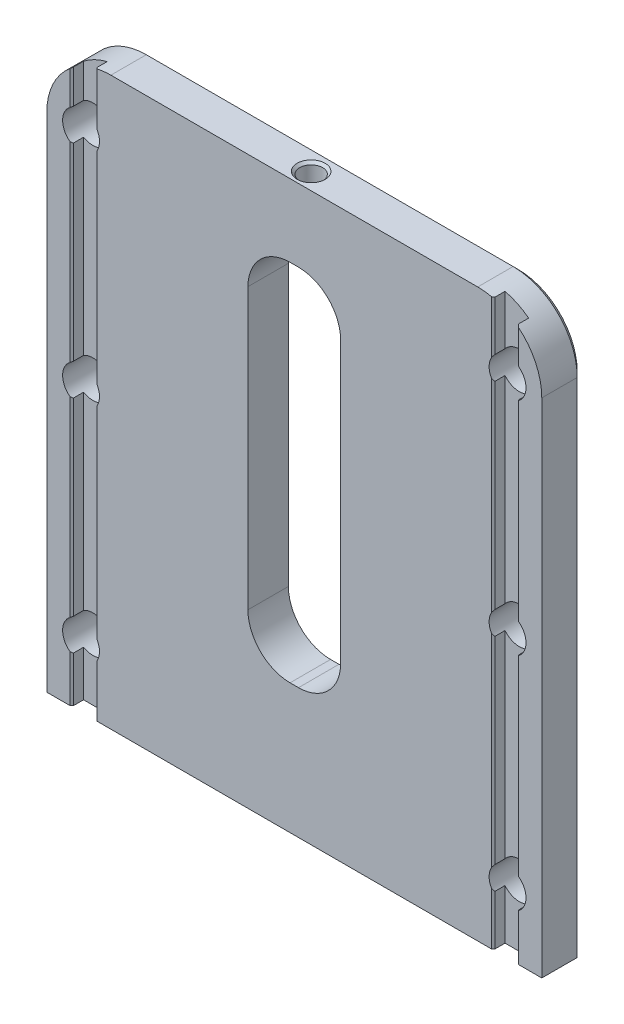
ISO-10303-21;
HEADER;
FILE_DESCRIPTION(('STEP AP214'),'2;1');
FILE_NAME('part.step','',(''),(''),'','','');
FILE_SCHEMA(('AUTOMOTIVE_DESIGN { 1 0 10303 214 1 1 1 1 }'));
ENDSEC;
DATA;
#1=APPLICATION_CONTEXT('core data for automotive mechanical design processes');
#2=APPLICATION_PROTOCOL_DEFINITION('international standard','automotive_design',2000,#1);
#3=PRODUCT_CONTEXT('',#1,'mechanical');
#4=PRODUCT('Part','Part','',(#3));
#5=PRODUCT_RELATED_PRODUCT_CATEGORY('part','',(#4));
#6=PRODUCT_DEFINITION_FORMATION('','',#4);
#7=PRODUCT_DEFINITION_CONTEXT('part definition',#1,'design');
#8=PRODUCT_DEFINITION('design','',#6,#7);
#9=PRODUCT_DEFINITION_SHAPE('','',#8);
#10=(LENGTH_UNIT() NAMED_UNIT(*) SI_UNIT(.MILLI.,.METRE.));
#11=(NAMED_UNIT(*) PLANE_ANGLE_UNIT() SI_UNIT($,.RADIAN.));
#12=(NAMED_UNIT(*) SI_UNIT($,.STERADIAN.) SOLID_ANGLE_UNIT());
#13=UNCERTAINTY_MEASURE_WITH_UNIT(LENGTH_MEASURE(1.E-05),#10,'distance_accuracy_value','');
#14=(GEOMETRIC_REPRESENTATION_CONTEXT(3) GLOBAL_UNCERTAINTY_ASSIGNED_CONTEXT((#13)) GLOBAL_UNIT_ASSIGNED_CONTEXT((#10,
#11,#12)) REPRESENTATION_CONTEXT('',''));
#15=CARTESIAN_POINT('',(0.,0.,0.));
#16=DIRECTION('',(0.,0.,1.));
#17=DIRECTION('',(1.,0.,0.));
#18=AXIS2_PLACEMENT_3D('',#15,#16,#17);
#19=CARTESIAN_POINT('',(-6.731,74.676,-189.584463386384));
#20=DIRECTION('',(0.,-1.,0.));
#21=DIRECTION('',(0.,0.,-1.));
#22=AXIS2_PLACEMENT_3D('',#19,#20,#21);
#23=PLANE('',#22);
#24=DIRECTION('',(0.,0.,1.));
#25=VECTOR('',#24,1.);
#26=CARTESIAN_POINT('',(0.635,74.676,-16.256));
#27=LINE('',#26,#25);
#28=CARTESIAN_POINT('',(0.635,74.676,-17.1897637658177));
#29=VERTEX_POINT('',#28);
#30=CARTESIAN_POINT('',(0.635,74.676,-16.812359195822));
#31=VERTEX_POINT('',#30);
#32=EDGE_CURVE('E742',#29,#31,#27,.T.);
#33=ORIENTED_EDGE('',*,*,#32,.T.);
#34=CARTESIAN_POINT('',(0.,74.676,-18.796));
#35=DIRECTION('',(0.,-1.,0.));
#36=DIRECTION('',(0.,0.,-1.));
#37=AXIS2_PLACEMENT_3D('',#34,#35,#36);
#38=CIRCLE('',#37,2.0828);
#39=CARTESIAN_POINT('',(-0.635,74.676,-16.812359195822));
#40=VERTEX_POINT('',#39);
#41=EDGE_CURVE('E784',#31,#40,#38,.T.);
#42=ORIENTED_EDGE('',*,*,#41,.T.);
#43=DIRECTION('',(0.,0.,1.));
#44=VECTOR('',#43,1.);
#45=CARTESIAN_POINT('',(-0.635,74.676,-22.352));
#46=LINE('',#45,#44);
#47=CARTESIAN_POINT('',(-0.635,74.676,-17.1897637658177));
#48=VERTEX_POINT('',#47);
#49=EDGE_CURVE('E700',#40,#48,#46,.F.);
#50=ORIENTED_EDGE('',*,*,#49,.T.);
#51=CARTESIAN_POINT('',(0.,74.676,-18.796));
#52=DIRECTION('',(0.,-1.,0.));
#53=DIRECTION('',(0.,0.,-1.));
#54=AXIS2_PLACEMENT_3D('',#51,#52,#53);
#55=CIRCLE('',#54,1.7272);
#56=EDGE_CURVE('E739',#48,#29,#55,.F.);
#57=ORIENTED_EDGE('',*,*,#56,.T.);
#58=EDGE_LOOP('',(#33,#42,#50,#57));
#59=FACE_BOUND('',#58,.T.);
#60=ADVANCED_FACE('F15',(#59),#23,.T.);
#61=DIRECTION('',(0.,0.,1.));
#62=VECTOR('',#61,1.);
#63=CARTESIAN_POINT('',(-0.635,74.676,-22.352));
#64=LINE('',#63,#62);
#65=CARTESIAN_POINT('',(-0.635,74.676,-20.4022362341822));
#66=VERTEX_POINT('',#65);
#67=CARTESIAN_POINT('',(-0.635,74.676,-20.779640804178));
#68=VERTEX_POINT('',#67);
#69=EDGE_CURVE('E697',#66,#68,#64,.F.);
#70=ORIENTED_EDGE('',*,*,#69,.T.);
#71=CARTESIAN_POINT('',(0.,74.676,-18.796));
#72=DIRECTION('',(0.,-1.,0.));
#73=DIRECTION('',(0.,0.,-1.));
#74=AXIS2_PLACEMENT_3D('',#71,#72,#73);
#75=CIRCLE('',#74,2.0828);
#76=CARTESIAN_POINT('',(0.635,74.676,-20.779640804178));
#77=VERTEX_POINT('',#76);
#78=EDGE_CURVE('E805',#68,#77,#75,.T.);
#79=ORIENTED_EDGE('',*,*,#78,.T.);
#80=DIRECTION('',(0.,0.,1.));
#81=VECTOR('',#80,1.);
#82=CARTESIAN_POINT('',(0.635,74.676,-16.256));
#83=LINE('',#82,#81);
#84=CARTESIAN_POINT('',(0.635,74.676,-20.4022362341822));
#85=VERTEX_POINT('',#84);
#86=EDGE_CURVE('E828',#77,#85,#83,.T.);
#87=ORIENTED_EDGE('',*,*,#86,.T.);
#88=CARTESIAN_POINT('',(0.,74.676,-18.796));
#89=DIRECTION('',(0.,-1.,0.));
#90=DIRECTION('',(0.,0.,-1.));
#91=AXIS2_PLACEMENT_3D('',#88,#89,#90);
#92=CIRCLE('',#91,1.7272);
#93=EDGE_CURVE('E843',#85,#66,#92,.F.);
#94=ORIENTED_EDGE('',*,*,#93,.T.);
#95=EDGE_LOOP('',(#70,#79,#87,#94));
#96=FACE_BOUND('',#95,.T.);
#97=ADVANCED_FACE('F750',(#96),#23,.T.);
#98=CARTESIAN_POINT('',(0.635,68.326,-189.584463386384));
#99=DIRECTION('',(0.,0.,-1.));
#100=DIRECTION('',(-1.,0.,0.));
#101=AXIS2_PLACEMENT_3D('',#98,#99,#100);
#102=CYLINDRICAL_SURFACE('',#101,6.35);
#103=CARTESIAN_POINT('',(0.635,74.676,-16.812359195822));
#104=CARTESIAN_POINT('',(0.69008338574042,74.6760034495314,-16.8299914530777));
#105=CARTESIAN_POINT('',(0.744401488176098,74.6752826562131,-16.849911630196));
#106=CARTESIAN_POINT('',(0.851154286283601,74.6725439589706,-16.8941765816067));
#107=CARTESIAN_POINT('',(0.903589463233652,74.670526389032,-16.9185202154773));
#108=CARTESIAN_POINT('',(1.05730986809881,74.6627686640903,-16.9978337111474));
#109=CARTESIAN_POINT('',(1.15530731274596,74.65532188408,-17.0591818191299));
#110=CARTESIAN_POINT('',(1.33955738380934,74.6374734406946,-17.1969714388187));
#111=CARTESIAN_POINT('',(1.42581564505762,74.627073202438,-17.2734056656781));
#112=CARTESIAN_POINT('',(1.58454600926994,74.6051152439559,-17.439367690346));
#113=CARTESIAN_POINT('',(1.65701363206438,74.5935571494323,-17.5288997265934));
#114=CARTESIAN_POINT('',(1.78764917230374,74.5708704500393,-17.7207664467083));
#115=CARTESIAN_POINT('',(1.8454766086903,74.5597563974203,-17.8233347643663));
#116=CARTESIAN_POINT('',(1.94309819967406,74.5400056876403,-18.0369249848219));
#117=CARTESIAN_POINT('',(1.9829015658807,74.5313677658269,-18.1479425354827));
#118=CARTESIAN_POINT('',(2.03609087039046,74.5195467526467,-18.3482937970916));
#119=CARTESIAN_POINT('',(2.05350162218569,74.515556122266,-18.4365324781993));
#120=CARTESIAN_POINT('',(2.07682999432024,74.5101459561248,-18.6145571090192));
#121=CARTESIAN_POINT('',(2.08275191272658,74.50872545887,-18.7043424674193));
#122=CARTESIAN_POINT('',(2.0827992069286,74.5087483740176,-18.7941824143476));
#123=B_SPLINE_CURVE_WITH_KNOTS('',3,(#103,#104,#105,#106,#107,#108,#109,#110,#111,#112,#113,
#114,#115,#116,#117,#118,#119,#120,#121,#122),.UNSPECIFIED.,.F.,.F.,(4,2,2,2,2,2,2,2,2,4),(0.,
0.173395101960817,0.346745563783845,0.692521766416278,1.03813140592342,1.38385313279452,
1.73699872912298,2.08996363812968,2.35929463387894,2.62852485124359),.UNSPECIFIED.);
#124=CARTESIAN_POINT('',(2.0827992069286,74.5087483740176,-18.7941824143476));
#125=VERTEX_POINT('',#124);
#126=EDGE_CURVE('E783',#31,#125,#123,.T.);
#127=ORIENTED_EDGE('',*,*,#126,.F.);
#128=ORIENTED_EDGE('',*,*,#32,.F.);
#129=CARTESIAN_POINT('',(0.635,74.676,-20.4022362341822));
#130=CARTESIAN_POINT('',(0.67987144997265,74.6760021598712,-20.3844973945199));
#131=CARTESIAN_POINT('',(0.723975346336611,74.6755240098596,-20.3648858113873));
#132=CARTESIAN_POINT('',(0.810368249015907,74.6737246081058,-20.3220566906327));
#133=CARTESIAN_POINT('',(0.85265759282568,74.6724035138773,-20.2988398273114));
#134=CARTESIAN_POINT('',(0.976224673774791,74.667359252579,-20.2240910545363));
#135=CARTESIAN_POINT('',(1.05440440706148,74.6625540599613,-20.1673804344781));
#136=CARTESIAN_POINT('',(1.20012297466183,74.6512272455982,-20.0418672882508));
#137=CARTESIAN_POINT('',(1.26766290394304,74.6447058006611,-19.9730660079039));
#138=CARTESIAN_POINT('',(1.39037849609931,74.6312136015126,-19.8252193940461));
#139=CARTESIAN_POINT('',(1.44555311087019,74.6242428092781,-19.7461731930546));
#140=CARTESIAN_POINT('',(1.54261923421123,74.6109954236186,-19.5789473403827));
#141=CARTESIAN_POINT('',(1.58434050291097,74.604728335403,-19.4906680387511));
#142=CARTESIAN_POINT('',(1.65236334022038,74.5940671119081,-19.3082402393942));
#143=CARTESIAN_POINT('',(1.67866475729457,74.5896729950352,-19.2140916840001));
#144=CARTESIAN_POINT('',(1.71491969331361,74.5835245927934,-19.0232488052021));
#145=CARTESIAN_POINT('',(1.7249789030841,74.5817532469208,-18.9265751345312));
#146=CARTESIAN_POINT('',(1.72876192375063,74.5810930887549,-18.7329056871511));
#147=CARTESIAN_POINT('',(1.72248730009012,74.5822040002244,-18.6359099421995));
#148=CARTESIAN_POINT('',(1.69396871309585,74.5870931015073,-18.4454935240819));
#149=CARTESIAN_POINT('',(1.67190566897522,74.5908410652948,-18.3520448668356));
#150=CARTESIAN_POINT('',(1.61267400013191,74.6003562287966,-18.1701814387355));
#151=CARTESIAN_POINT('',(1.57550551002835,74.6061234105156,-18.0817666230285));
#152=CARTESIAN_POINT('',(1.48674868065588,74.6187770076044,-17.9116467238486));
#153=CARTESIAN_POINT('',(1.43504291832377,74.6256723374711,-17.830003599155));
#154=CARTESIAN_POINT('',(1.31871846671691,74.6393547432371,-17.6764083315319));
#155=CARTESIAN_POINT('',(1.25409184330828,74.646141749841,-17.6044621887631));
#156=CARTESIAN_POINT('',(1.11290571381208,74.6583914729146,-17.4715482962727));
#157=CARTESIAN_POINT('',(1.03622058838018,74.6638384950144,-17.4107126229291));
#158=CARTESIAN_POINT('',(0.873708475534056,74.6720288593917,-17.3029110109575));
#159=CARTESIAN_POINT('',(0.787905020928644,74.6747789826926,-17.255910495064));
#160=CARTESIAN_POINT('',(0.677753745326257,74.6758921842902,-17.2071608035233));
#161=CARTESIAN_POINT('',(0.656458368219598,74.6760015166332,-17.1982436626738));
#162=CARTESIAN_POINT('',(0.635,74.676,-17.1897637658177));
#163=B_SPLINE_CURVE_WITH_KNOTS('',3,(#129,#130,#131,#132,#133,#134,#135,#136,#137,#138,#139,
#140,#141,#142,#143,#144,#145,#146,#147,#148,#149,#150,#151,#152,#153,#154,#155,#156,#157,#158,
#159,#160,#161,#162),.UNSPECIFIED.,.F.,.F.,(4,2,2,2,2,2,2,2,2,2,2,2,2,2,2,2,4),(0.,
0.144657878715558,0.289288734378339,0.577903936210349,0.866489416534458,1.15509934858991,
1.44722980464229,1.7393631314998,2.02958772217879,2.31978449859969,2.60670809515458,
2.89362913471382,3.18293783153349,3.47242472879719,3.76515602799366,4.05714938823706,
4.1263897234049),.UNSPECIFIED.);
#164=EDGE_CURVE('E730',#85,#29,#163,.T.);
#165=ORIENTED_EDGE('',*,*,#164,.F.);
#166=ORIENTED_EDGE('',*,*,#86,.F.);
#167=CARTESIAN_POINT('',(2.0828,74.5087481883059,-18.796));
#168=CARTESIAN_POINT('',(2.08280054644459,74.5087432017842,-18.8538939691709));
#169=CARTESIAN_POINT('',(2.08038462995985,74.5093143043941,-18.9117592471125));
#170=CARTESIAN_POINT('',(2.07075271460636,74.5115598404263,-19.0270578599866));
#171=CARTESIAN_POINT('',(2.06353751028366,74.5132340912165,-19.0844912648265));
#172=CARTESIAN_POINT('',(2.03479195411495,74.5198269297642,-19.2553080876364));
#173=CARTESIAN_POINT('',(2.00616125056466,74.5263161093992,-19.3675192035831));
#174=CARTESIAN_POINT('',(1.93086713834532,74.5424853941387,-19.5853741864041));
#175=CARTESIAN_POINT('',(1.88420618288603,74.552165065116,-19.6910189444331));
#176=CARTESIAN_POINT('',(1.7741766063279,74.5732317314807,-19.8930801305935));
#177=CARTESIAN_POINT('',(1.71080251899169,74.5846192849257,-19.9894935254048));
#178=CARTESIAN_POINT('',(1.56780007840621,74.6075368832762,-20.1721353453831));
#179=CARTESIAN_POINT('',(1.4879083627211,74.6190659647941,-20.2581576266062));
#180=CARTESIAN_POINT('',(1.31469470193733,74.6401196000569,-20.415666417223));
#181=CARTESIAN_POINT('',(1.22138029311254,74.6496452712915,-20.487161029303));
#182=CARTESIAN_POINT('',(1.04686523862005,74.663083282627,-20.5988377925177));
#183=CARTESIAN_POINT('',(0.967890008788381,74.6677857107,-20.6424355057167));
#184=CARTESIAN_POINT('',(0.804897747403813,74.6742578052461,-20.7191064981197));
#185=CARTESIAN_POINT('',(0.720881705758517,74.6760280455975,-20.7521818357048));
#186=CARTESIAN_POINT('',(0.634999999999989,74.676,-20.779640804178));
#187=B_SPLINE_CURVE_WITH_KNOTS('',3,(#167,#168,#169,#170,#171,#172,#173,#174,#175,#176,#177,
#178,#179,#180,#181,#182,#183,#184,#185,#186),.UNSPECIFIED.,.F.,.F.,(4,2,2,2,2,2,2,2,2,4),(0.,
0.173572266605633,0.347115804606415,0.69328177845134,1.0394006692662,1.38563290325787,
1.73788280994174,2.08993570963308,2.36016289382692,2.63033718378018),.UNSPECIFIED.);
#188=CARTESIAN_POINT('',(2.0828,74.5087481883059,-18.796));
#189=VERTEX_POINT('',#188);
#190=EDGE_CURVE('E776',#189,#77,#187,.T.);
#191=ORIENTED_EDGE('',*,*,#190,.F.);
#192=CARTESIAN_POINT('',(0.635,68.326,-18.796));
#193=DIRECTION('',(0.,0.,1.));
#194=DIRECTION('',(1.,0.,0.));
#195=AXIS2_PLACEMENT_3D('',#192,#193,#194);
#196=CIRCLE('',#195,6.35);
#197=CARTESIAN_POINT('',(2.083054,74.5086887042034,-18.796));
#198=VERTEX_POINT('',#197);
#199=EDGE_CURVE('E1159',#198,#189,#196,.T.);
#200=ORIENTED_EDGE('',*,*,#199,.F.);
#201=CARTESIAN_POINT('',(2.083054,74.5086887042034,-18.796));
#202=CARTESIAN_POINT('',(2.08305454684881,74.5086837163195,-18.8539007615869));
#203=CARTESIAN_POINT('',(2.08063835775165,74.50925498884,-18.9117728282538));
#204=CARTESIAN_POINT('',(2.07100535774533,74.5115011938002,-19.0270849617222));
#205=CARTESIAN_POINT('',(2.06378934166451,74.5131759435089,-19.0845250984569));
#206=CARTESIAN_POINT('',(2.03504056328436,74.5197707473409,-19.2553618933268));
#207=CARTESIAN_POINT('',(2.00640666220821,74.5262618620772,-19.3675861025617));
#208=CARTESIAN_POINT('',(1.93110419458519,74.5424360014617,-19.5854664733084));
#209=CARTESIAN_POINT('',(1.88443808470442,74.5521185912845,-19.691123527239));
#210=CARTESIAN_POINT('',(1.77439639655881,74.5731917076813,-19.893208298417));
#211=CARTESIAN_POINT('',(1.71101534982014,74.5845827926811,-19.9896329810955));
#212=CARTESIAN_POINT('',(1.5679967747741,74.6075077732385,-20.1722968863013));
#213=CARTESIAN_POINT('',(1.48809576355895,74.6190407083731,-20.2583298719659));
#214=CARTESIAN_POINT('',(1.31486181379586,74.6401017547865,-20.4158584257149));
#215=CARTESIAN_POINT('',(1.22153641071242,74.64963098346,-20.4873620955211));
#216=CARTESIAN_POINT('',(1.04698802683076,74.663075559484,-20.5990612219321));
#217=CARTESIAN_POINT('',(0.967989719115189,74.6677807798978,-20.6426710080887));
#218=CARTESIAN_POINT('',(0.804949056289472,74.674256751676,-20.7193613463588));
#219=CARTESIAN_POINT('',(0.720907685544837,74.6760280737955,-20.7524439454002));
#220=CARTESIAN_POINT('',(0.63499999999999,74.676,-20.7799074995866));
#221=B_SPLINE_CURVE_WITH_KNOTS('',3,(#201,#202,#203,#204,#205,#206,#207,#208,#209,#210,#211,
#212,#213,#214,#215,#216,#217,#218,#219,#220),.UNSPECIFIED.,.F.,.F.,(4,2,2,2,2,2,2,2,2,4),(0.,
0.173592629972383,0.347156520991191,0.693362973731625,1.03952227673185,1.38579497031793,
1.73808811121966,2.09018426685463,2.36048938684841,2.63074191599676),.UNSPECIFIED.);
#222=CARTESIAN_POINT('',(0.635,74.676,-20.7799074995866));
#223=VERTEX_POINT('',#222);
#224=EDGE_CURVE('E761',#198,#223,#221,.T.);
#225=ORIENTED_EDGE('',*,*,#224,.T.);
#226=CARTESIAN_POINT('',(0.635,74.676,-22.352));
#227=VERTEX_POINT('',#226);
#228=EDGE_CURVE('E680',#227,#223,#83,.T.);
#229=ORIENTED_EDGE('',*,*,#228,.F.);
#230=CARTESIAN_POINT('',(0.635,68.326,-22.352));
#231=DIRECTION('',(0.,0.,-1.));
#232=DIRECTION('',(-1.,0.,0.));
#233=AXIS2_PLACEMENT_3D('',#230,#231,#232);
#234=CIRCLE('',#233,6.35);
#235=CARTESIAN_POINT('',(6.985,68.326,-22.352));
#236=VERTEX_POINT('',#235);
#237=EDGE_CURVE('E835',#236,#227,#234,.F.);
#238=ORIENTED_EDGE('',*,*,#237,.F.);
#239=DIRECTION('',(0.,0.,1.));
#240=VECTOR('',#239,1.);
#241=CARTESIAN_POINT('',(6.985,68.326,-22.352));
#242=LINE('',#241,#240);
#243=CARTESIAN_POINT('',(6.985,68.326,-16.256));
#244=VERTEX_POINT('',#243);
#245=EDGE_CURVE('E857',#244,#236,#242,.F.);
#246=ORIENTED_EDGE('',*,*,#245,.F.);
#247=CARTESIAN_POINT('',(0.635,68.326,-16.256));
#248=DIRECTION('',(0.,0.,1.));
#249=DIRECTION('',(1.,0.,0.));
#250=AXIS2_PLACEMENT_3D('',#247,#248,#249);
#251=CIRCLE('',#250,6.35);
#252=CARTESIAN_POINT('',(0.635,74.676,-16.256));
#253=VERTEX_POINT('',#252);
#254=EDGE_CURVE('E862',#253,#244,#251,.F.);
#255=ORIENTED_EDGE('',*,*,#254,.F.);
#256=CARTESIAN_POINT('',(0.635,74.676,-16.8120925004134));
#257=VERTEX_POINT('',#256);
#258=EDGE_CURVE('E822',#257,#253,#27,.T.);
#259=ORIENTED_EDGE('',*,*,#258,.F.);
#260=CARTESIAN_POINT('',(0.635,74.676,-16.8120925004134));
#261=CARTESIAN_POINT('',(0.690090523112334,74.6760034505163,-16.8297246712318));
#262=CARTESIAN_POINT('',(0.744415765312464,74.6752824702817,-16.8496450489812));
#263=CARTESIAN_POINT('',(0.851182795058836,74.6725430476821,-16.8939109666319));
#264=CARTESIAN_POINT('',(0.903625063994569,74.670524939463,-16.9182553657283));
#265=CARTESIAN_POINT('',(1.05736653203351,74.6627651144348,-16.9975719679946));
#266=CARTESIAN_POINT('',(1.15537781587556,74.6553162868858,-17.0589232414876));
#267=CARTESIAN_POINT('',(1.33965479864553,74.637462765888,-17.1967212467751));
#268=CARTESIAN_POINT('',(1.42592613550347,74.6270594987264,-17.2731606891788));
#269=CARTESIAN_POINT('',(1.58468168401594,74.6050948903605,-17.4391350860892));
#270=CARTESIAN_POINT('',(1.65716141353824,74.5935331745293,-17.5286742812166));
#271=CARTESIAN_POINT('',(1.78782065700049,74.570838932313,-17.7205579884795));
#272=CARTESIAN_POINT('',(1.8456595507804,74.5597209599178,-17.823136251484));
#273=CARTESIAN_POINT('',(1.9433022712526,74.5399628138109,-18.0367482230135));
#274=CARTESIAN_POINT('',(1.98311530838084,74.5313213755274,-18.1477775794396));
#275=CARTESIAN_POINT('',(2.03632360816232,74.5194941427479,-18.3481654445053));
#276=CARTESIAN_POINT('',(2.0537422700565,74.5155009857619,-18.4364290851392));
#277=CARTESIAN_POINT('',(2.0770812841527,74.5100873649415,-18.6145047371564));
#278=CARTESIAN_POINT('',(2.0830059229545,74.5086659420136,-18.7043161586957));
#279=CARTESIAN_POINT('',(2.08305320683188,74.5086888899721,-18.7941821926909));
#280=B_SPLINE_CURVE_WITH_KNOTS('',3,(#260,#261,#262,#263,#264,#265,#266,#267,#268,#269,#270,
#271,#272,#273,#274,#275,#276,#277,#278,#279),.UNSPECIFIED.,.F.,.F.,(4,2,2,2,2,2,2,2,2,4),(0.,
0.173415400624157,0.346786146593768,0.692602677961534,1.03825254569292,1.38401455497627,
1.73720373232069,2.09021224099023,2.35962104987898,2.62892936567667),.UNSPECIFIED.);
#281=CARTESIAN_POINT('',(2.08305320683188,74.5086888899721,-18.7941821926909));
#282=VERTEX_POINT('',#281);
#283=EDGE_CURVE('E769',#257,#282,#280,.T.);
#284=ORIENTED_EDGE('',*,*,#283,.T.);
#285=CARTESIAN_POINT('',(0.635,68.326,-18.7954458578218));
#286=DIRECTION('',(-0.000872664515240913,0.,0.99999961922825));
#287=DIRECTION('',(-0.99999961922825,0.,-0.000872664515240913));
#288=AXIS2_PLACEMENT_3D('',#285,#286,#287);
#289=ELLIPSE('',#288,6.35000241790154,6.35);
#290=EDGE_CURVE('E496',#125,#282,#289,.F.);
#291=ORIENTED_EDGE('',*,*,#290,.F.);
#292=EDGE_LOOP('',(#127,#128,#165,#166,#191,#200,#225,#229,#238,#246,#255,#259,#284,#291));
#293=FACE_BOUND('',#292,.T.);
#294=ADVANCED_FACE('F744',(#293),#102,.F.);
#295=CARTESIAN_POINT('',(-0.635,68.326,-189.584463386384));
#296=DIRECTION('',(0.,0.,-1.));
#297=DIRECTION('',(-1.,0.,0.));
#298=AXIS2_PLACEMENT_3D('',#295,#296,#297);
#299=CYLINDRICAL_SURFACE('',#298,6.35);
#300=CARTESIAN_POINT('',(-0.635,74.676,-20.779640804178));
#301=CARTESIAN_POINT('',(-0.690086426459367,74.6760034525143,-20.7620075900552));
#302=CARTESIAN_POINT('',(-0.744407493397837,74.6752825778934,-20.7420861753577));
#303=CARTESIAN_POINT('',(-0.851165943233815,74.6725435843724,-20.6978182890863));
#304=CARTESIAN_POINT('',(-0.903603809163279,74.6705258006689,-20.6734729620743));
#305=CARTESIAN_POINT('',(-1.05732064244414,74.6627678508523,-20.5941595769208));
#306=CARTESIAN_POINT('',(-1.15531233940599,74.6553214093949,-20.5328145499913));
#307=CARTESIAN_POINT('',(-1.33955807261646,74.6374733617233,-20.3950279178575));
#308=CARTESIAN_POINT('',(-1.42581701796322,74.6270729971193,-20.3185926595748));
#309=CARTESIAN_POINT('',(-1.58454693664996,74.6051151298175,-20.1526315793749));
#310=CARTESIAN_POINT('',(-1.65701362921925,74.5935572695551,-20.0631017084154));
#311=CARTESIAN_POINT('',(-1.78763423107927,74.5708729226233,-19.8712540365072));
#312=CARTESIAN_POINT('',(-1.84545140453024,74.5597608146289,-19.7687049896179));
#313=CARTESIAN_POINT('',(-1.94307761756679,74.5400105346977,-19.5551354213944));
#314=CARTESIAN_POINT('',(-1.98288745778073,74.5313722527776,-19.4441152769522));
#315=CARTESIAN_POINT('',(-2.04307590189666,74.5179930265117,-19.2173906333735));
#316=CARTESIAN_POINT('',(-2.06356739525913,74.5132294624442,-19.101717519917));
#317=CARTESIAN_POINT('',(-2.08482790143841,74.5082830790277,-18.8684885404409));
#318=CARTESIAN_POINT('',(-2.08560078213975,74.5080993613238,-18.7509330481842));
#319=CARTESIAN_POINT('',(-2.06762142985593,74.5122889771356,-18.5201685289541));
#320=CARTESIAN_POINT('',(-2.04932160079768,74.5165567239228,-18.4069219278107));
#321=CARTESIAN_POINT('',(-1.99448396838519,74.5288287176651,-18.185148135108));
#322=CARTESIAN_POINT('',(-1.95794466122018,74.5368332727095,-18.0766213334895));
#323=CARTESIAN_POINT('',(-1.86739334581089,74.5554339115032,-17.8664356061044));
#324=CARTESIAN_POINT('',(-1.813257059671,74.566048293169,-17.7648319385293));
#325=CARTESIAN_POINT('',(-1.68905873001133,74.5882221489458,-17.5719502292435));
#326=CARTESIAN_POINT('',(-1.61899141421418,74.59978193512,-17.4806756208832));
#327=CARTESIAN_POINT('',(-1.46289672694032,74.6223041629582,-17.3087904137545));
#328=CARTESIAN_POINT('',(-1.37652722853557,74.6332456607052,-17.2284876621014));
#329=CARTESIAN_POINT('',(-1.19132791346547,74.6522642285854,-17.0835209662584));
#330=CARTESIAN_POINT('',(-1.09251247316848,74.6603445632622,-17.0188392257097));
#331=CARTESIAN_POINT('',(-0.932429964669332,74.6692839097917,-16.9324642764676));
#332=CARTESIAN_POINT('',(-0.874506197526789,74.6717558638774,-16.9045931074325));
#333=CARTESIAN_POINT('',(-0.756367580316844,74.6751159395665,-16.8543305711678));
#334=CARTESIAN_POINT('',(-0.696155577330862,74.6760059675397,-16.8319326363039));
#335=CARTESIAN_POINT('',(-0.635,74.676,-16.812359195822));
#336=B_SPLINE_CURVE_WITH_KNOTS('',3,(#300,#301,#302,#303,#304,#305,#306,#307,#308,#309,#310,
#311,#312,#313,#314,#315,#316,#317,#318,#319,#320,#321,#322,#323,#324,#325,#326,#327,#328,#329,
#330,#331,#332,#333,#334,#335),.UNSPECIFIED.,.F.,.F.,(4,2,2,2,2,2,2,2,2,2,2,2,2,2,2,2,2,4),(0.,
0.173404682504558,0.346764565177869,0.692521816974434,1.03813395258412,1.38385318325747,
1.73691628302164,2.08996368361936,2.440934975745,2.79183742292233,3.13460186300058,
3.47739456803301,3.82266283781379,4.16804553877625,4.52170219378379,4.87495402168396,
5.06767515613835,5.2601638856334),.UNSPECIFIED.);
#337=EDGE_CURVE('E800',#68,#40,#336,.T.);
#338=ORIENTED_EDGE('',*,*,#337,.F.);
#339=ORIENTED_EDGE('',*,*,#69,.F.);
#340=CARTESIAN_POINT('',(-0.635,74.676,-17.1897637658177));
#341=CARTESIAN_POINT('',(-0.679871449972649,74.6760021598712,-17.2075026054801));
#342=CARTESIAN_POINT('',(-0.723975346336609,74.6755240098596,-17.2271141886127));
#343=CARTESIAN_POINT('',(-0.810368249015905,74.6737246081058,-17.2699433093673));
#344=CARTESIAN_POINT('',(-0.852657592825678,74.6724035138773,-17.2931601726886));
#345=CARTESIAN_POINT('',(-0.976224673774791,74.667359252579,-17.3679089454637));
#346=CARTESIAN_POINT('',(-1.05440440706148,74.6625540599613,-17.4246195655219));
#347=CARTESIAN_POINT('',(-1.20012297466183,74.6512272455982,-17.5501327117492));
#348=CARTESIAN_POINT('',(-1.26766290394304,74.6447058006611,-17.6189339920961));
#349=CARTESIAN_POINT('',(-1.39037849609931,74.6312136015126,-17.7667806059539));
#350=CARTESIAN_POINT('',(-1.44555311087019,74.6242428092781,-17.8458268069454));
#351=CARTESIAN_POINT('',(-1.54261923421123,74.6109954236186,-18.0130526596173));
#352=CARTESIAN_POINT('',(-1.58434050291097,74.604728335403,-18.1013319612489));
#353=CARTESIAN_POINT('',(-1.65236334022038,74.5940671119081,-18.2837597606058));
#354=CARTESIAN_POINT('',(-1.67866475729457,74.5896729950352,-18.3779083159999));
#355=CARTESIAN_POINT('',(-1.71491969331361,74.5835245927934,-18.5687511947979));
#356=CARTESIAN_POINT('',(-1.7249789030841,74.5817532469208,-18.6654248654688));
#357=CARTESIAN_POINT('',(-1.72876192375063,74.5810930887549,-18.8590943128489));
#358=CARTESIAN_POINT('',(-1.72248730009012,74.5822040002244,-18.9560900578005));
#359=CARTESIAN_POINT('',(-1.69396871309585,74.5870931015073,-19.1465064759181));
#360=CARTESIAN_POINT('',(-1.67190566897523,74.5908410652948,-19.2399551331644));
#361=CARTESIAN_POINT('',(-1.61267400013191,74.6003562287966,-19.4218185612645));
#362=CARTESIAN_POINT('',(-1.57550551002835,74.6061234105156,-19.5102333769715));
#363=CARTESIAN_POINT('',(-1.48674868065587,74.6187770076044,-19.6803532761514));
#364=CARTESIAN_POINT('',(-1.43504291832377,74.6256723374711,-19.761996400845));
#365=CARTESIAN_POINT('',(-1.31871846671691,74.6393547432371,-19.9155916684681));
#366=CARTESIAN_POINT('',(-1.25409184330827,74.646141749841,-19.9875378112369));
#367=CARTESIAN_POINT('',(-1.11290571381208,74.6583914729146,-20.1204517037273));
#368=CARTESIAN_POINT('',(-1.03622058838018,74.6638384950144,-20.1812873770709));
#369=CARTESIAN_POINT('',(-0.873708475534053,74.6720288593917,-20.2890889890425));
#370=CARTESIAN_POINT('',(-0.787905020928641,74.6747789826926,-20.336089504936));
#371=CARTESIAN_POINT('',(-0.677753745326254,74.6758921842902,-20.3848391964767));
#372=CARTESIAN_POINT('',(-0.656458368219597,74.6760015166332,-20.3937563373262));
#373=CARTESIAN_POINT('',(-0.635,74.676,-20.4022362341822));
#374=B_SPLINE_CURVE_WITH_KNOTS('',3,(#340,#341,#342,#343,#344,#345,#346,#347,#348,#349,#350,
#351,#352,#353,#354,#355,#356,#357,#358,#359,#360,#361,#362,#363,#364,#365,#366,#367,#368,#369,
#370,#371,#372,#373),.UNSPECIFIED.,.F.,.F.,(4,2,2,2,2,2,2,2,2,2,2,2,2,2,2,2,4),(0.,
0.144657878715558,0.28928873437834,0.57790393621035,0.86648941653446,1.15509934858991,
1.44722980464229,1.73936313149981,2.02958772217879,2.31978449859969,2.60670809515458,
2.89362913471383,3.18293783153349,3.4724247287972,3.76515602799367,4.05714938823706,
4.1263897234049),.UNSPECIFIED.);
#375=EDGE_CURVE('E702',#48,#66,#374,.T.);
#376=ORIENTED_EDGE('',*,*,#375,.F.);
#377=ORIENTED_EDGE('',*,*,#49,.F.);
#378=EDGE_LOOP('',(#338,#339,#376,#377));
#379=FACE_BOUND('',#378,.T.);
#380=ADVANCED_FACE('F749',(#379),#299,.F.);
#381=CARTESIAN_POINT('',(0.,85.598,-18.796));
#382=DIRECTION('',(0.,1.,0.));
#383=DIRECTION('',(0.,0.,1.));
#384=AXIS2_PLACEMENT_3D('',#381,#382,#383);
#385=CONICAL_SURFACE('',#384,2.1082,0.785398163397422);
#386=CARTESIAN_POINT('',(0.,85.598,-18.796));
#387=DIRECTION('',(0.,-1.,0.));
#388=DIRECTION('',(1.,0.,0.));
#389=AXIS2_PLACEMENT_3D('',#386,#387,#388);
#390=CIRCLE('',#389,2.1082);
#391=CARTESIAN_POINT('',(2.1082,85.598,-18.796));
#392=VERTEX_POINT('',#391);
#393=EDGE_CURVE('E503',#392,#392,#390,.T.);
#394=ORIENTED_EDGE('',*,*,#393,.F.);
#395=EDGE_LOOP('',(#394));
#396=FACE_BOUND('',#395,.T.);
#397=CARTESIAN_POINT('',(0.,85.217,-18.796));
#398=DIRECTION('',(0.,-1.,0.));
#399=DIRECTION('',(0.,0.,-1.));
#400=AXIS2_PLACEMENT_3D('',#397,#398,#399);
#401=CIRCLE('',#400,1.7272);
#402=CARTESIAN_POINT('',(0.,85.217,-20.5232));
#403=VERTEX_POINT('',#402);
#404=EDGE_CURVE('E489',#403,#403,#401,.F.);
#405=ORIENTED_EDGE('',*,*,#404,.F.);
#406=EDGE_LOOP('',(#405));
#407=FACE_BOUND('',#406,.T.);
#408=DIRECTION('',(0.707106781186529,0.707106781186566,0.));
#409=VECTOR('',#408,1.);
#410=CARTESIAN_POINT('',(0.,83.4898,-18.796));
#411=LINE('',#410,#409);
#412=CARTESIAN_POINT('',(2.083054,85.572854,-18.796));
#413=VERTEX_POINT('',#412);
#414=CARTESIAN_POINT('',(2.0828,85.5726,-18.796));
#415=VERTEX_POINT('',#414);
#416=EDGE_CURVE('E23',#413,#415,#411,.F.);
#417=ORIENTED_EDGE('',*,*,#416,.T.);
#418=CARTESIAN_POINT('',(0.,85.5726,-18.796));
#419=DIRECTION('',(0.,1.,0.));
#420=DIRECTION('',(0.,0.,1.));
#421=AXIS2_PLACEMENT_3D('',#418,#419,#420);
#422=CIRCLE('',#421,2.0828);
#423=CARTESIAN_POINT('',(2.0827992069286,85.5726,-18.7941824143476));
#424=VERTEX_POINT('',#423);
#425=EDGE_CURVE('E9',#415,#424,#422,.T.);
#426=ORIENTED_EDGE('',*,*,#425,.T.);
#427=DIRECTION('',(0.707106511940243,0.707106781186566,0.000617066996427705));
#428=VECTOR('',#427,1.);
#429=CARTESIAN_POINT('',(0.,83.4898,-18.796));
#430=LINE('',#429,#428);
#431=CARTESIAN_POINT('',(2.08305320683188,85.572854,-18.7941821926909));
#432=VERTEX_POINT('',#431);
#433=EDGE_CURVE('E488',#424,#432,#430,.T.);
#434=ORIENTED_EDGE('',*,*,#433,.T.);
#435=CARTESIAN_POINT('',(0.,85.572854,-18.796));
#436=DIRECTION('',(0.,1.,0.));
#437=DIRECTION('',(0.,0.,1.));
#438=AXIS2_PLACEMENT_3D('',#435,#436,#437);
#439=CIRCLE('',#438,2.083054);
#440=EDGE_CURVE('E480',#413,#432,#439,.T.);
#441=ORIENTED_EDGE('',*,*,#440,.F.);
#442=EDGE_LOOP('',(#417,#426,#434,#441));
#443=FACE_BOUND('',#442,.T.);
#444=ADVANCED_FACE('F498',(#396,#407,#443),#385,.F.);
#445=CARTESIAN_POINT('',(33.528,85.598,-16.256));
#446=DIRECTION('',(0.,-1.,0.));
#447=DIRECTION('',(1.,0.,0.));
#448=AXIS2_PLACEMENT_3D('',#445,#446,#447);
#449=PLANE('',#448);
#450=ORIENTED_EDGE('',*,*,#393,.T.);
#451=EDGE_LOOP('',(#450));
#452=FACE_BOUND('',#451,.T.);
#453=DIRECTION('',(0.,0.,-1.));
#454=VECTOR('',#453,1.);
#455=CARTESIAN_POINT('',(27.6352,85.598,-22.352));
#456=LINE('',#455,#454);
#457=CARTESIAN_POINT('',(27.6352,85.598,-16.256));
#458=VERTEX_POINT('',#457);
#459=CARTESIAN_POINT('',(27.6352,85.598,-21.59));
#460=VERTEX_POINT('',#459);
#461=EDGE_CURVE('E937',#458,#460,#456,.T.);
#462=ORIENTED_EDGE('',*,*,#461,.T.);
#463=DIRECTION('',(-1.,0.,0.));
#464=VECTOR('',#463,1.);
#465=CARTESIAN_POINT('',(-27.6352,85.598,-21.59));
#466=LINE('',#465,#464);
#467=CARTESIAN_POINT('',(-27.6352,85.598,-21.59));
#468=VERTEX_POINT('',#467);
#469=EDGE_CURVE('E650',#460,#468,#466,.T.);
#470=ORIENTED_EDGE('',*,*,#469,.T.);
#471=DIRECTION('',(0.,0.,-1.));
#472=VECTOR('',#471,1.);
#473=CARTESIAN_POINT('',(-27.6352,85.598,-16.256));
#474=LINE('',#473,#472);
#475=CARTESIAN_POINT('',(-27.6352,85.598,-16.256));
#476=VERTEX_POINT('',#475);
#477=EDGE_CURVE('E935',#468,#476,#474,.F.);
#478=ORIENTED_EDGE('',*,*,#477,.T.);
#479=DIRECTION('',(-1.,0.,0.));
#480=VECTOR('',#479,1.);
#481=CARTESIAN_POINT('',(28.5496,85.598,-16.256));
#482=LINE('',#481,#480);
#483=EDGE_CURVE('E1102',#458,#476,#482,.T.);
#484=ORIENTED_EDGE('',*,*,#483,.F.);
#485=EDGE_LOOP('',(#462,#470,#478,#484));
#486=FACE_BOUND('',#485,.T.);
#487=ADVANCED_FACE('F1197',(#452,#486),#449,.F.);
#488=CARTESIAN_POINT('',(-37.2872,85.598,-22.352));
#489=DIRECTION('',(0.,0.,-1.));
#490=DIRECTION('',(-1.,0.,0.));
#491=AXIS2_PLACEMENT_3D('',#488,#489,#490);
#492=PLANE('',#491);
#493=CARTESIAN_POINT('',(27.6352,75.946,-22.352));
#494=DIRECTION('',(0.,0.,-1.));
#495=DIRECTION('',(-1.,0.,0.));
#496=AXIS2_PLACEMENT_3D('',#493,#494,#495);
#497=CIRCLE('',#496,8.89);
#498=CARTESIAN_POINT('',(27.6352,84.836,-22.352));
#499=VERTEX_POINT('',#498);
#500=CARTESIAN_POINT('',(36.5252,75.946,-22.352));
#501=VERTEX_POINT('',#500);
#502=EDGE_CURVE('E667',#499,#501,#497,.T.);
#503=ORIENTED_EDGE('',*,*,#502,.T.);
#504=DIRECTION('',(0.,-1.,0.));
#505=VECTOR('',#504,1.);
#506=CARTESIAN_POINT('',(36.5252,85.598,-22.352));
#507=LINE('',#506,#505);
#508=CARTESIAN_POINT('',(36.5252,1.016,-22.352));
#509=VERTEX_POINT('',#508);
#510=EDGE_CURVE('E663',#501,#509,#507,.T.);
#511=ORIENTED_EDGE('',*,*,#510,.T.);
#512=DIRECTION('',(-1.,0.,0.));
#513=VECTOR('',#512,1.);
#514=CARTESIAN_POINT('',(-37.2872,1.01599999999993,-22.352));
#515=LINE('',#514,#513);
#516=CARTESIAN_POINT('',(-36.5252,1.01599999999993,-22.352));
#517=VERTEX_POINT('',#516);
#518=EDGE_CURVE('E665',#509,#517,#515,.T.);
#519=ORIENTED_EDGE('',*,*,#518,.T.);
#520=DIRECTION('',(0.,1.,0.));
#521=VECTOR('',#520,1.);
#522=CARTESIAN_POINT('',(-36.5252,85.598,-22.352));
#523=LINE('',#522,#521);
#524=CARTESIAN_POINT('',(-36.5252,75.946,-22.352));
#525=VERTEX_POINT('',#524);
#526=EDGE_CURVE('E670',#517,#525,#523,.T.);
#527=ORIENTED_EDGE('',*,*,#526,.T.);
#528=CARTESIAN_POINT('',(-27.6352,75.946,-22.352));
#529=DIRECTION('',(0.,0.,-1.));
#530=DIRECTION('',(-1.,0.,0.));
#531=AXIS2_PLACEMENT_3D('',#528,#529,#530);
#532=CIRCLE('',#531,8.89);
#533=CARTESIAN_POINT('',(-27.6352,84.836,-22.352));
#534=VERTEX_POINT('',#533);
#535=EDGE_CURVE('E672',#525,#534,#532,.T.);
#536=ORIENTED_EDGE('',*,*,#535,.T.);
#537=DIRECTION('',(1.,0.,0.));
#538=VECTOR('',#537,1.);
#539=CARTESIAN_POINT('',(27.6352,84.836,-22.352));
#540=LINE('',#539,#538);
#541=EDGE_CURVE('E674',#534,#499,#540,.T.);
#542=ORIENTED_EDGE('',*,*,#541,.T.);
#543=EDGE_LOOP('',(#503,#511,#519,#527,#536,#542));
#544=FACE_BOUND('',#543,.T.);
#545=DIRECTION('',(0.,1.,0.));
#546=VECTOR('',#545,1.);
#547=CARTESIAN_POINT('',(6.985,85.598,-22.352));
#548=LINE('',#547,#546);
#549=CARTESIAN_POINT('',(6.985,26.162,-22.352));
#550=VERTEX_POINT('',#549);
#551=EDGE_CURVE('E848',#550,#236,#548,.T.);
#552=ORIENTED_EDGE('',*,*,#551,.T.);
#553=ORIENTED_EDGE('',*,*,#237,.T.);
#554=DIRECTION('',(-1.,0.,0.));
#555=VECTOR('',#554,1.);
#556=CARTESIAN_POINT('',(-37.2872,74.676,-22.352));
#557=LINE('',#556,#555);
#558=CARTESIAN_POINT('',(-0.635,74.676,-22.352));
#559=VERTEX_POINT('',#558);
#560=EDGE_CURVE('E692',#227,#559,#557,.T.);
#561=ORIENTED_EDGE('',*,*,#560,.T.);
#562=CARTESIAN_POINT('',(-0.635,68.326,-22.352));
#563=DIRECTION('',(0.,0.,-1.));
#564=DIRECTION('',(-1.,0.,0.));
#565=AXIS2_PLACEMENT_3D('',#562,#563,#564);
#566=CIRCLE('',#565,6.35);
#567=CARTESIAN_POINT('',(-6.985,68.326,-22.352));
#568=VERTEX_POINT('',#567);
#569=EDGE_CURVE('E693',#559,#568,#566,.F.);
#570=ORIENTED_EDGE('',*,*,#569,.T.);
#571=DIRECTION('',(0.,-1.,0.));
#572=VECTOR('',#571,1.);
#573=CARTESIAN_POINT('',(-6.985,85.598,-22.352));
#574=LINE('',#573,#572);
#575=CARTESIAN_POINT('',(-6.985,26.162,-22.352));
#576=VERTEX_POINT('',#575);
#577=EDGE_CURVE('E688',#568,#576,#574,.T.);
#578=ORIENTED_EDGE('',*,*,#577,.T.);
#579=CARTESIAN_POINT('',(-0.635,26.162,-22.352));
#580=DIRECTION('',(0.,0.,-1.));
#581=DIRECTION('',(-1.,0.,0.));
#582=AXIS2_PLACEMENT_3D('',#579,#580,#581);
#583=CIRCLE('',#582,6.35);
#584=CARTESIAN_POINT('',(-0.635,19.812,-22.352));
#585=VERTEX_POINT('',#584);
#586=EDGE_CURVE('E679',#576,#585,#583,.F.);
#587=ORIENTED_EDGE('',*,*,#586,.T.);
#588=DIRECTION('',(1.,0.,0.));
#589=VECTOR('',#588,1.);
#590=CARTESIAN_POINT('',(-37.2872,19.812,-22.352));
#591=LINE('',#590,#589);
#592=CARTESIAN_POINT('',(0.635,19.812,-22.352));
#593=VERTEX_POINT('',#592);
#594=EDGE_CURVE('E849',#585,#593,#591,.T.);
#595=ORIENTED_EDGE('',*,*,#594,.T.);
#596=CARTESIAN_POINT('',(0.635,26.162,-22.352));
#597=DIRECTION('',(0.,0.,-1.));
#598=DIRECTION('',(-1.,0.,0.));
#599=AXIS2_PLACEMENT_3D('',#596,#597,#598);
#600=CIRCLE('',#599,6.35);
#601=EDGE_CURVE('E867',#593,#550,#600,.F.);
#602=ORIENTED_EDGE('',*,*,#601,.T.);
#603=EDGE_LOOP('',(#552,#553,#561,#570,#578,#587,#595,#602));
#604=FACE_BOUND('',#603,.T.);
#605=CARTESIAN_POINT('',(-32.131,76.073,-22.352));
#606=DIRECTION('',(0.,0.,-1.));
#607=DIRECTION('',(-1.,0.,0.));
#608=AXIS2_PLACEMENT_3D('',#605,#606,#607);
#609=CIRCLE('',#608,2.778125);
#610=CARTESIAN_POINT('',(-34.909125,76.073,-22.352));
#611=VERTEX_POINT('',#610);
#612=EDGE_CURVE('E1042',#611,#611,#609,.T.);
#613=ORIENTED_EDGE('',*,*,#612,.F.);
#614=EDGE_LOOP('',(#613));
#615=FACE_BOUND('',#614,.T.);
#616=CARTESIAN_POINT('',(32.131,76.073,-22.352));
#617=DIRECTION('',(0.,0.,-1.));
#618=DIRECTION('',(-1.,0.,0.));
#619=AXIS2_PLACEMENT_3D('',#616,#617,#618);
#620=CIRCLE('',#619,2.778125);
#621=CARTESIAN_POINT('',(29.352875,76.073,-22.352));
#622=VERTEX_POINT('',#621);
#623=EDGE_CURVE('E1000',#622,#622,#620,.T.);
#624=ORIENTED_EDGE('',*,*,#623,.F.);
#625=EDGE_LOOP('',(#624));
#626=FACE_BOUND('',#625,.T.);
#627=CARTESIAN_POINT('',(32.131,9.525,-22.352));
#628=DIRECTION('',(0.,0.,-1.));
#629=DIRECTION('',(-1.,0.,0.));
#630=AXIS2_PLACEMENT_3D('',#627,#628,#629);
#631=CIRCLE('',#630,2.778125);
#632=CARTESIAN_POINT('',(29.352875,9.525,-22.352));
#633=VERTEX_POINT('',#632);
#634=EDGE_CURVE('E1013',#633,#633,#631,.T.);
#635=ORIENTED_EDGE('',*,*,#634,.F.);
#636=EDGE_LOOP('',(#635));
#637=FACE_BOUND('',#636,.T.);
#638=CARTESIAN_POINT('',(-32.131,9.525,-22.352));
#639=DIRECTION('',(0.,0.,-1.));
#640=DIRECTION('',(-1.,0.,0.));
#641=AXIS2_PLACEMENT_3D('',#638,#639,#640);
#642=CIRCLE('',#641,2.778125);
#643=CARTESIAN_POINT('',(-34.909125,9.525,-22.352));
#644=VERTEX_POINT('',#643);
#645=EDGE_CURVE('E964',#644,#644,#642,.T.);
#646=ORIENTED_EDGE('',*,*,#645,.F.);
#647=EDGE_LOOP('',(#646));
#648=FACE_BOUND('',#647,.T.);
#649=CARTESIAN_POINT('',(32.131,42.799,-22.352));
#650=DIRECTION('',(0.,0.,-1.));
#651=DIRECTION('',(-1.,0.,0.));
#652=AXIS2_PLACEMENT_3D('',#649,#650,#651);
#653=CIRCLE('',#652,2.778125);
#654=CARTESIAN_POINT('',(29.352875,42.799,-22.352));
#655=VERTEX_POINT('',#654);
#656=EDGE_CURVE('E963',#655,#655,#653,.T.);
#657=ORIENTED_EDGE('',*,*,#656,.F.);
#658=EDGE_LOOP('',(#657));
#659=FACE_BOUND('',#658,.T.);
#660=CARTESIAN_POINT('',(-32.131,42.799,-22.352));
#661=DIRECTION('',(0.,0.,-1.));
#662=DIRECTION('',(-1.,0.,0.));
#663=AXIS2_PLACEMENT_3D('',#660,#661,#662);
#664=CIRCLE('',#663,2.778125);
#665=CARTESIAN_POINT('',(-34.909125,42.799,-22.352));
#666=VERTEX_POINT('',#665);
#667=EDGE_CURVE('E738',#666,#666,#664,.T.);
#668=ORIENTED_EDGE('',*,*,#667,.F.);
#669=EDGE_LOOP('',(#668));
#670=FACE_BOUND('',#669,.T.);
#671=ADVANCED_FACE('F875',(#544,#604,#615,#626,#637,#648,#659,#670),#492,.T.);
#672=CARTESIAN_POINT('',(0.,74.676,-18.796));
#673=DIRECTION('',(0.,-1.,0.));
#674=DIRECTION('',(0.,0.,-1.));
#675=AXIS2_PLACEMENT_3D('',#672,#673,#674);
#676=CIRCLE('',#675,2.083054);
#677=CARTESIAN_POINT('',(-0.635,74.676,-16.8120925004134));
#678=VERTEX_POINT('',#677);
#679=EDGE_CURVE('E30',#257,#678,#676,.T.);
#680=ORIENTED_EDGE('',*,*,#679,.F.);
#681=ORIENTED_EDGE('',*,*,#258,.T.);
#682=DIRECTION('',(1.,0.,0.));
#683=VECTOR('',#682,1.);
#684=CARTESIAN_POINT('',(28.5496,74.676,-16.256));
#685=LINE('',#684,#683);
#686=CARTESIAN_POINT('',(-0.635,74.676,-16.256));
#687=VERTEX_POINT('',#686);
#688=EDGE_CURVE('E837',#687,#253,#685,.T.);
#689=ORIENTED_EDGE('',*,*,#688,.F.);
#690=EDGE_CURVE('E712',#687,#678,#46,.F.);
#691=ORIENTED_EDGE('',*,*,#690,.T.);
#692=EDGE_LOOP('',(#680,#681,#689,#691));
#693=FACE_BOUND('',#692,.T.);
#694=ADVANCED_FACE('F1185',(#693),#23,.T.);
#695=CARTESIAN_POINT('',(0.,74.676,-18.796));
#696=DIRECTION('',(0.,-1.,0.));
#697=DIRECTION('',(0.,0.,-1.));
#698=AXIS2_PLACEMENT_3D('',#695,#696,#697);
#699=CIRCLE('',#698,2.083054);
#700=CARTESIAN_POINT('',(-0.635,74.676,-20.7799074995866));
#701=VERTEX_POINT('',#700);
#702=EDGE_CURVE('E888',#701,#223,#699,.T.);
#703=ORIENTED_EDGE('',*,*,#702,.F.);
#704=EDGE_CURVE('E701',#701,#559,#64,.F.);
#705=ORIENTED_EDGE('',*,*,#704,.T.);
#706=ORIENTED_EDGE('',*,*,#560,.F.);
#707=ORIENTED_EDGE('',*,*,#228,.T.);
#708=EDGE_LOOP('',(#703,#705,#706,#707));
#709=FACE_BOUND('',#708,.T.);
#710=ADVANCED_FACE('F887',(#709),#23,.T.);
#711=ORIENTED_EDGE('',*,*,#704,.F.);
#712=CARTESIAN_POINT('',(-0.635,74.676,-20.7799074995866));
#713=CARTESIAN_POINT('',(-0.690093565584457,74.6760034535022,-20.7622743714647));
#714=CARTESIAN_POINT('',(-0.744421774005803,74.675282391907,-20.7423527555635));
#715=CARTESIAN_POINT('',(-0.851194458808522,74.6725426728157,-20.698083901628));
#716=CARTESIAN_POINT('',(-0.903639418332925,74.6705243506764,-20.6737378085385));
#717=CARTESIAN_POINT('',(-1.05737731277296,74.6627643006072,-20.5944213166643));
#718=CARTESIAN_POINT('',(-1.15538284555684,74.6553158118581,-20.5330731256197));
#719=CARTESIAN_POINT('',(-1.33965548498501,74.637462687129,-20.3952781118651));
#720=CARTESIAN_POINT('',(-1.4259275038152,74.6270592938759,-20.3188376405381));
#721=CARTESIAN_POINT('',(-1.58468260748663,74.6050947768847,-20.1528641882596));
#722=CARTESIAN_POINT('',(-1.65716140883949,74.5935332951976,-20.0633271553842));
#723=CARTESIAN_POINT('',(-1.78780571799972,74.5708414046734,-19.8714624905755));
#724=CARTESIAN_POINT('',(-1.84563435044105,74.5597253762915,-19.7689034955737));
#725=CARTESIAN_POINT('',(-1.94328169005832,74.5399676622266,-19.5553121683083));
#726=CARTESIAN_POINT('',(-1.98310119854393,74.5313258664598,-19.4442802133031));
#727=CARTESIAN_POINT('',(-2.04330686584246,74.5179405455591,-19.2175302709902));
#728=CARTESIAN_POINT('',(-2.06380589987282,74.5131744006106,-19.1018436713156));
#729=CARTESIAN_POINT('',(-2.08507906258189,74.5082241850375,-18.8685865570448));
#730=CARTESIAN_POINT('',(-2.0858570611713,74.5080392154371,-18.7510164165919));
#731=CARTESIAN_POINT('',(-2.06788534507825,74.512227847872,-18.5202234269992));
#732=CARTESIAN_POINT('',(-2.04958827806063,74.5164957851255,-18.4069630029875));
#733=CARTESIAN_POINT('',(-1.99475400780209,74.5287695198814,-18.1851613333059));
#734=CARTESIAN_POINT('',(-1.95821529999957,74.5367756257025,-18.0766204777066));
#735=CARTESIAN_POINT('',(-1.86766315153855,74.5553805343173,-17.8664069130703));
#736=CARTESIAN_POINT('',(-1.81352545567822,74.5659976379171,-17.7647894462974));
#737=CARTESIAN_POINT('',(-1.68932229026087,74.5881778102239,-17.5718805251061));
#738=CARTESIAN_POINT('',(-1.6192515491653,74.5997411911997,-17.4805925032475));
#739=CARTESIAN_POINT('',(-1.46314714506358,74.6222713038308,-17.3086799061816));
#740=CARTESIAN_POINT('',(-1.37677116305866,74.6332170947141,-17.2283633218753));
#741=CARTESIAN_POINT('',(-1.19155658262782,74.6522442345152,-17.0833701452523));
#742=CARTESIAN_POINT('',(-1.09273235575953,74.6603288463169,-17.0186757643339));
#743=CARTESIAN_POINT('',(-0.932607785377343,74.6692758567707,-16.9322680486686));
#744=CARTESIAN_POINT('',(-0.874650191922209,74.6717507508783,-16.904378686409));
#745=CARTESIAN_POINT('',(-0.756441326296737,74.6751148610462,-16.8540855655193));
#746=CARTESIAN_POINT('',(-0.696192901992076,74.6760059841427,-16.8316752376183));
#747=CARTESIAN_POINT('',(-0.635,74.676,-16.8120925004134));
#748=B_SPLINE_CURVE_WITH_KNOTS('',3,(#712,#713,#714,#715,#716,#717,#718,#719,#720,#721,#722,
#723,#724,#725,#726,#727,#728,#729,#730,#731,#732,#733,#734,#735,#736,#737,#738,#739,#740,#741,
#742,#743,#744,#745,#746,#747),.UNSPECIFIED.,.F.,.F.,(4,2,2,2,2,2,2,2,2,2,2,2,2,2,2,2,2,4),(0.,
0.173424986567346,0.34680515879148,0.692602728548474,1.03825508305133,1.38401460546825,
1.73712130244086,2.09021228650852,2.44122739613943,2.79217362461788,3.1349774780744,
3.47780961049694,3.82311683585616,4.16853847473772,4.52223843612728,4.87553372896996,
5.06836978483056,5.26097348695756),.UNSPECIFIED.);
#749=EDGE_CURVE('E1163',#701,#678,#748,.T.);
#750=ORIENTED_EDGE('',*,*,#749,.T.);
#751=ORIENTED_EDGE('',*,*,#690,.F.);
#752=CARTESIAN_POINT('',(-0.635,68.326,-16.256));
#753=DIRECTION('',(0.,0.,1.));
#754=DIRECTION('',(1.,0.,0.));
#755=AXIS2_PLACEMENT_3D('',#752,#753,#754);
#756=CIRCLE('',#755,6.35);
#757=CARTESIAN_POINT('',(-6.985,68.326,-16.256));
#758=VERTEX_POINT('',#757);
#759=EDGE_CURVE('E696',#758,#687,#756,.F.);
#760=ORIENTED_EDGE('',*,*,#759,.F.);
#761=DIRECTION('',(0.,0.,1.));
#762=VECTOR('',#761,1.);
#763=CARTESIAN_POINT('',(-6.985,68.326,-16.256));
#764=LINE('',#763,#762);
#765=EDGE_CURVE('E684',#568,#758,#764,.T.);
#766=ORIENTED_EDGE('',*,*,#765,.F.);
#767=ORIENTED_EDGE('',*,*,#569,.F.);
#768=EDGE_LOOP('',(#711,#750,#751,#760,#766,#767));
#769=FACE_BOUND('',#768,.T.);
#770=ADVANCED_FACE('F714',(#769),#299,.F.);
#771=CARTESIAN_POINT('',(-29.972,85.598,-16.256));
#772=DIRECTION('',(-1.,0.,0.));
#773=DIRECTION('',(0.,0.,1.));
#774=AXIS2_PLACEMENT_3D('',#771,#772,#773);
#775=PLANE('',#774);
#776=DIRECTION('',(0.,0.,1.));
#777=VECTOR('',#776,1.);
#778=CARTESIAN_POINT('',(-29.972,11.2733413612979,-17.145));
#779=LINE('',#778,#777);
#780=CARTESIAN_POINT('',(-29.972,11.2733413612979,-16.51));
#781=VERTEX_POINT('',#780);
#782=CARTESIAN_POINT('',(-29.972,11.2733413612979,-18.034));
#783=VERTEX_POINT('',#782);
#784=EDGE_CURVE('E967',#781,#783,#779,.F.);
#785=ORIENTED_EDGE('',*,*,#784,.F.);
#786=DIRECTION('',(0.,1.,0.));
#787=VECTOR('',#786,1.);
#788=CARTESIAN_POINT('',(-29.972,85.598,-16.51));
#789=LINE('',#788,#787);
#790=CARTESIAN_POINT('',(-29.972,41.0506586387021,-16.51));
#791=VERTEX_POINT('',#790);
#792=EDGE_CURVE('E528',#781,#791,#789,.T.);
#793=ORIENTED_EDGE('',*,*,#792,.T.);
#794=DIRECTION('',(0.,0.,1.));
#795=VECTOR('',#794,1.);
#796=CARTESIAN_POINT('',(-29.972,41.0506586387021,-17.145));
#797=LINE('',#796,#795);
#798=CARTESIAN_POINT('',(-29.972,41.0506586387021,-18.034));
#799=VERTEX_POINT('',#798);
#800=EDGE_CURVE('E947',#799,#791,#797,.T.);
#801=ORIENTED_EDGE('',*,*,#800,.F.);
#802=DIRECTION('',(0.,-1.,0.));
#803=VECTOR('',#802,1.);
#804=CARTESIAN_POINT('',(-29.972,85.598,-18.034));
#805=LINE('',#804,#803);
#806=EDGE_CURVE('E1107',#799,#783,#805,.T.);
#807=ORIENTED_EDGE('',*,*,#806,.T.);
#808=EDGE_LOOP('',(#785,#793,#801,#807));
#809=FACE_BOUND('',#808,.T.);
#810=ADVANCED_FACE('F1193',(#809),#775,.T.);
#811=CARTESIAN_POINT('',(-33.528,85.598,-17.78));
#812=DIRECTION('',(1.,0.,0.));
#813=DIRECTION('',(0.,0.,-1.));
#814=AXIS2_PLACEMENT_3D('',#811,#812,#813);
#815=PLANE('',#814);
#816=DIRECTION('',(0.,0.,1.));
#817=VECTOR('',#816,1.);
#818=CARTESIAN_POINT('',(-33.528,73.6716733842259,-17.145));
#819=LINE('',#818,#817);
#820=CARTESIAN_POINT('',(-33.528,73.6716733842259,-16.51));
#821=VERTEX_POINT('',#820);
#822=CARTESIAN_POINT('',(-33.528,73.6716733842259,-18.034));
#823=VERTEX_POINT('',#822);
#824=EDGE_CURVE('E1068',#821,#823,#819,.F.);
#825=ORIENTED_EDGE('',*,*,#824,.F.);
#826=DIRECTION('',(0.,-1.,0.));
#827=VECTOR('',#826,1.);
#828=CARTESIAN_POINT('',(-33.528,85.598,-16.51));
#829=LINE('',#828,#827);
#830=CARTESIAN_POINT('',(-33.528,45.2003266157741,-16.51));
#831=VERTEX_POINT('',#830);
#832=EDGE_CURVE('E525',#821,#831,#829,.T.);
#833=ORIENTED_EDGE('',*,*,#832,.T.);
#834=DIRECTION('',(0.,0.,1.));
#835=VECTOR('',#834,1.);
#836=CARTESIAN_POINT('',(-33.528,45.2003266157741,-17.145));
#837=LINE('',#836,#835);
#838=CARTESIAN_POINT('',(-33.528,45.2003266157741,-18.034));
#839=VERTEX_POINT('',#838);
#840=EDGE_CURVE('E951',#839,#831,#837,.T.);
#841=ORIENTED_EDGE('',*,*,#840,.F.);
#842=DIRECTION('',(0.,-1.,0.));
#843=VECTOR('',#842,1.);
#844=CARTESIAN_POINT('',(-33.528,85.598,-18.034));
#845=LINE('',#844,#843);
#846=EDGE_CURVE('E1114',#823,#839,#845,.T.);
#847=ORIENTED_EDGE('',*,*,#846,.F.);
#848=EDGE_LOOP('',(#825,#833,#841,#847));
#849=FACE_BOUND('',#848,.T.);
#850=ADVANCED_FACE('F1245',(#849),#815,.T.);
#851=CARTESIAN_POINT('',(-29.972,85.598,-18.034));
#852=DIRECTION('',(0.,0.,1.));
#853=DIRECTION('',(1.,0.,0.));
#854=AXIS2_PLACEMENT_3D('',#851,#852,#853);
#855=PLANE('',#854);
#856=CARTESIAN_POINT('',(-32.131,42.799,-18.034));
#857=DIRECTION('',(0.,0.,1.));
#858=DIRECTION('',(1.,0.,0.));
#859=AXIS2_PLACEMENT_3D('',#856,#857,#858);
#860=CIRCLE('',#859,2.778125);
#861=CARTESIAN_POINT('',(-29.972,44.5473413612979,-18.034));
#862=VERTEX_POINT('',#861);
#863=EDGE_CURVE('E948',#862,#839,#860,.T.);
#864=ORIENTED_EDGE('',*,*,#863,.F.);
#865=CARTESIAN_POINT('',(-29.972,74.3246586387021,-18.034));
#866=VERTEX_POINT('',#865);
#867=EDGE_CURVE('E1110',#866,#862,#805,.T.);
#868=ORIENTED_EDGE('',*,*,#867,.F.);
#869=CARTESIAN_POINT('',(-32.131,76.073,-18.034));
#870=DIRECTION('',(0.,0.,1.));
#871=DIRECTION('',(1.,0.,0.));
#872=AXIS2_PLACEMENT_3D('',#869,#870,#871);
#873=CIRCLE('',#872,2.778125);
#874=EDGE_CURVE('E1072',#823,#866,#873,.T.);
#875=ORIENTED_EDGE('',*,*,#874,.F.);
#876=ORIENTED_EDGE('',*,*,#846,.T.);
#877=EDGE_LOOP('',(#864,#868,#875,#876));
#878=FACE_BOUND('',#877,.T.);
#879=ADVANCED_FACE('F1236',(#878),#855,.T.);
#880=CARTESIAN_POINT('',(29.972,85.598,-16.256));
#881=DIRECTION('',(-1.,0.,0.));
#882=DIRECTION('',(0.,0.,1.));
#883=AXIS2_PLACEMENT_3D('',#880,#881,#882);
#884=PLANE('',#883);
#885=DIRECTION('',(0.,0.,1.));
#886=VECTOR('',#885,1.);
#887=CARTESIAN_POINT('',(29.972,41.0506586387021,-17.145));
#888=LINE('',#887,#886);
#889=CARTESIAN_POINT('',(29.972,41.0506586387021,-18.034));
#890=VERTEX_POINT('',#889);
#891=CARTESIAN_POINT('',(29.972,41.0506586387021,-16.51));
#892=VERTEX_POINT('',#891);
#893=EDGE_CURVE('E1022',#890,#892,#888,.T.);
#894=ORIENTED_EDGE('',*,*,#893,.T.);
#895=DIRECTION('',(0.,-1.,0.));
#896=VECTOR('',#895,1.);
#897=CARTESIAN_POINT('',(29.972,11.2733413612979,-16.51));
#898=LINE('',#897,#896);
#899=CARTESIAN_POINT('',(29.972,11.2733413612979,-16.51));
#900=VERTEX_POINT('',#899);
#901=EDGE_CURVE('E575',#892,#900,#898,.T.);
#902=ORIENTED_EDGE('',*,*,#901,.T.);
#903=DIRECTION('',(0.,0.,1.));
#904=VECTOR('',#903,1.);
#905=CARTESIAN_POINT('',(29.972,11.2733413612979,-17.145));
#906=LINE('',#905,#904);
#907=CARTESIAN_POINT('',(29.972,11.2733413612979,-18.034));
#908=VERTEX_POINT('',#907);
#909=EDGE_CURVE('E1048',#900,#908,#906,.F.);
#910=ORIENTED_EDGE('',*,*,#909,.T.);
#911=DIRECTION('',(0.,-1.,0.));
#912=VECTOR('',#911,1.);
#913=CARTESIAN_POINT('',(29.972,85.598,-18.034));
#914=LINE('',#913,#912);
#915=EDGE_CURVE('E1125',#890,#908,#914,.T.);
#916=ORIENTED_EDGE('',*,*,#915,.F.);
#917=EDGE_LOOP('',(#894,#902,#910,#916));
#918=FACE_BOUND('',#917,.T.);
#919=ADVANCED_FACE('F1225',(#918),#884,.F.);
#920=CARTESIAN_POINT('',(29.972,85.598,-18.034));
#921=DIRECTION('',(0.,0.,-1.));
#922=DIRECTION('',(-1.,0.,0.));
#923=AXIS2_PLACEMENT_3D('',#920,#921,#922);
#924=PLANE('',#923);
#925=CARTESIAN_POINT('',(29.972,74.3246586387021,-18.034));
#926=VERTEX_POINT('',#925);
#927=CARTESIAN_POINT('',(29.972,44.5473413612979,-18.034));
#928=VERTEX_POINT('',#927);
#929=EDGE_CURVE('E1128',#926,#928,#914,.T.);
#930=ORIENTED_EDGE('',*,*,#929,.T.);
#931=CARTESIAN_POINT('',(32.131,42.799,-18.034));
#932=DIRECTION('',(0.,0.,-1.));
#933=DIRECTION('',(-1.,0.,0.));
#934=AXIS2_PLACEMENT_3D('',#931,#932,#933);
#935=CIRCLE('',#934,2.778125);
#936=CARTESIAN_POINT('',(33.528,45.2003266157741,-18.034));
#937=VERTEX_POINT('',#936);
#938=EDGE_CURVE('E1030',#928,#937,#935,.T.);
#939=ORIENTED_EDGE('',*,*,#938,.T.);
#940=DIRECTION('',(0.,-1.,0.));
#941=VECTOR('',#940,1.);
#942=CARTESIAN_POINT('',(33.528,85.598,-18.034));
#943=LINE('',#942,#941);
#944=CARTESIAN_POINT('',(33.528,73.6716733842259,-18.034));
#945=VERTEX_POINT('',#944);
#946=EDGE_CURVE('E1123',#945,#937,#943,.T.);
#947=ORIENTED_EDGE('',*,*,#946,.F.);
#948=CARTESIAN_POINT('',(32.131,76.073,-18.034));
#949=DIRECTION('',(0.,0.,-1.));
#950=DIRECTION('',(-1.,0.,0.));
#951=AXIS2_PLACEMENT_3D('',#948,#949,#950);
#952=CIRCLE('',#951,2.778125);
#953=EDGE_CURVE('E996',#945,#926,#952,.T.);
#954=ORIENTED_EDGE('',*,*,#953,.T.);
#955=EDGE_LOOP('',(#930,#939,#947,#954));
#956=FACE_BOUND('',#955,.T.);
#957=ADVANCED_FACE('F1229',(#956),#924,.F.);
#958=CARTESIAN_POINT('',(33.528,85.598,-17.78));
#959=DIRECTION('',(1.,0.,0.));
#960=DIRECTION('',(0.,0.,-1.));
#961=AXIS2_PLACEMENT_3D('',#958,#959,#960);
#962=PLANE('',#961);
#963=DIRECTION('',(0.,0.,1.));
#964=VECTOR('',#963,1.);
#965=CARTESIAN_POINT('',(33.528,45.2003266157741,-17.145));
#966=LINE('',#965,#964);
#967=CARTESIAN_POINT('',(33.528,45.2003266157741,-16.51));
#968=VERTEX_POINT('',#967);
#969=EDGE_CURVE('E1031',#937,#968,#966,.T.);
#970=ORIENTED_EDGE('',*,*,#969,.T.);
#971=DIRECTION('',(0.,1.,0.));
#972=VECTOR('',#971,1.);
#973=CARTESIAN_POINT('',(33.528,85.598,-16.51));
#974=LINE('',#973,#972);
#975=CARTESIAN_POINT('',(33.528,73.6716733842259,-16.51));
#976=VERTEX_POINT('',#975);
#977=EDGE_CURVE('E591',#968,#976,#974,.T.);
#978=ORIENTED_EDGE('',*,*,#977,.T.);
#979=DIRECTION('',(0.,0.,1.));
#980=VECTOR('',#979,1.);
#981=CARTESIAN_POINT('',(33.528,73.6716733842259,-17.145));
#982=LINE('',#981,#980);
#983=EDGE_CURVE('E995',#976,#945,#982,.F.);
#984=ORIENTED_EDGE('',*,*,#983,.T.);
#985=ORIENTED_EDGE('',*,*,#946,.T.);
#986=EDGE_LOOP('',(#970,#978,#984,#985));
#987=FACE_BOUND('',#986,.T.);
#988=ADVANCED_FACE('F1218',(#987),#962,.F.);
#989=CARTESIAN_POINT('',(28.5496,85.598,-16.256));
#990=DIRECTION('',(0.,0.,1.));
#991=DIRECTION('',(1.,0.,0.));
#992=AXIS2_PLACEMENT_3D('',#989,#990,#991);
#993=PLANE('',#992);
#994=CARTESIAN_POINT('',(32.131,76.073,-16.256));
#995=DIRECTION('',(0.,0.,1.));
#996=DIRECTION('',(1.,0.,0.));
#997=AXIS2_PLACEMENT_3D('',#994,#995,#996);
#998=CIRCLE('',#997,2.778125);
#999=CARTESIAN_POINT('',(29.718,77.4497387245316,-16.256));
#1000=VERTEX_POINT('',#999);
#1001=CARTESIAN_POINT('',(29.718,74.6962612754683,-16.256));
#1002=VERTEX_POINT('',#1001);
#1003=EDGE_CURVE('E1001',#1000,#1002,#998,.T.);
#1004=ORIENTED_EDGE('',*,*,#1003,.F.);
#1005=DIRECTION('',(0.,1.,0.));
#1006=VECTOR('',#1005,1.);
#1007=CARTESIAN_POINT('',(29.718,85.3108528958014,-16.256));
#1008=LINE('',#1007,#1006);
#1009=CARTESIAN_POINT('',(29.718,85.3705980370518,-16.256));
#1010=VERTEX_POINT('',#1009);
#1011=EDGE_CURVE('E601',#1000,#1010,#1008,.T.);
#1012=ORIENTED_EDGE('',*,*,#1011,.T.);
#1013=CARTESIAN_POINT('',(27.6352,75.946,-16.256));
#1014=DIRECTION('',(0.,0.,1.));
#1015=DIRECTION('',(1.,0.,0.));
#1016=AXIS2_PLACEMENT_3D('',#1013,#1014,#1015);
#1017=CIRCLE('',#1016,9.652);
#1018=EDGE_CURVE('E933',#1010,#458,#1017,.T.);
#1019=ORIENTED_EDGE('',*,*,#1018,.T.);
#1020=ORIENTED_EDGE('',*,*,#483,.T.);
#1021=CARTESIAN_POINT('',(-27.6352,75.946,-16.256));
#1022=DIRECTION('',(0.,0.,1.));
#1023=DIRECTION('',(1.,0.,0.));
#1024=AXIS2_PLACEMENT_3D('',#1021,#1022,#1023);
#1025=CIRCLE('',#1024,9.652);
#1026=CARTESIAN_POINT('',(-29.718,85.3705980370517,-16.256));
#1027=VERTEX_POINT('',#1026);
#1028=EDGE_CURVE('E930',#476,#1027,#1025,.T.);
#1029=ORIENTED_EDGE('',*,*,#1028,.T.);
#1030=DIRECTION('',(0.,-1.,0.));
#1031=VECTOR('',#1030,1.);
#1032=CARTESIAN_POINT('',(-29.718,85.598,-16.256));
#1033=LINE('',#1032,#1031);
#1034=CARTESIAN_POINT('',(-29.718,77.4497387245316,-16.256));
#1035=VERTEX_POINT('',#1034);
#1036=EDGE_CURVE('E618',#1027,#1035,#1033,.T.);
#1037=ORIENTED_EDGE('',*,*,#1036,.T.);
#1038=CARTESIAN_POINT('',(-32.131,76.073,-16.256));
#1039=DIRECTION('',(0.,0.,1.));
#1040=DIRECTION('',(1.,0.,0.));
#1041=AXIS2_PLACEMENT_3D('',#1038,#1039,#1040);
#1042=CIRCLE('',#1041,2.778125);
#1043=CARTESIAN_POINT('',(-29.718,74.6962612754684,-16.256));
#1044=VERTEX_POINT('',#1043);
#1045=EDGE_CURVE('E852',#1044,#1035,#1042,.T.);
#1046=ORIENTED_EDGE('',*,*,#1045,.F.);
#1047=DIRECTION('',(0.,-1.,0.));
#1048=VECTOR('',#1047,1.);
#1049=CARTESIAN_POINT('',(-29.718,85.598,-16.256));
#1050=LINE('',#1049,#1048);
#1051=CARTESIAN_POINT('',(-29.718,44.1757387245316,-16.256));
#1052=VERTEX_POINT('',#1051);
#1053=EDGE_CURVE('E615',#1044,#1052,#1050,.T.);
#1054=ORIENTED_EDGE('',*,*,#1053,.T.);
#1055=CARTESIAN_POINT('',(-32.131,42.799,-16.256));
#1056=DIRECTION('',(0.,0.,1.));
#1057=DIRECTION('',(1.,0.,0.));
#1058=AXIS2_PLACEMENT_3D('',#1055,#1056,#1057);
#1059=CIRCLE('',#1058,2.778125);
#1060=CARTESIAN_POINT('',(-29.718,41.4222612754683,-16.256));
#1061=VERTEX_POINT('',#1060);
#1062=EDGE_CURVE('E960',#1061,#1052,#1059,.T.);
#1063=ORIENTED_EDGE('',*,*,#1062,.F.);
#1064=DIRECTION('',(0.,-1.,0.));
#1065=VECTOR('',#1064,1.);
#1066=CARTESIAN_POINT('',(-29.718,85.598,-16.256));
#1067=LINE('',#1066,#1065);
#1068=CARTESIAN_POINT('',(-29.718,10.9017387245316,-16.256));
#1069=VERTEX_POINT('',#1068);
#1070=EDGE_CURVE('E612',#1061,#1069,#1067,.T.);
#1071=ORIENTED_EDGE('',*,*,#1070,.T.);
#1072=CARTESIAN_POINT('',(-32.131,9.525,-16.256));
#1073=DIRECTION('',(0.,0.,1.));
#1074=DIRECTION('',(1.,0.,0.));
#1075=AXIS2_PLACEMENT_3D('',#1072,#1073,#1074);
#1076=CIRCLE('',#1075,2.778125);
#1077=CARTESIAN_POINT('',(-29.718,8.14826127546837,-16.256));
#1078=VERTEX_POINT('',#1077);
#1079=EDGE_CURVE('E978',#1078,#1069,#1076,.T.);
#1080=ORIENTED_EDGE('',*,*,#1079,.F.);
#1081=DIRECTION('',(0.,-1.,0.));
#1082=VECTOR('',#1081,1.);
#1083=CARTESIAN_POINT('',(-29.718,85.598,-16.256));
#1084=LINE('',#1083,#1082);
#1085=CARTESIAN_POINT('',(-29.718,0.253999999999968,-16.256));
#1086=VERTEX_POINT('',#1085);
#1087=EDGE_CURVE('E609',#1078,#1086,#1084,.T.);
#1088=ORIENTED_EDGE('',*,*,#1087,.T.);
#1089=DIRECTION('',(-1.,0.,0.));
#1090=VECTOR('',#1089,1.);
#1091=CARTESIAN_POINT('',(28.5496,0.254,-16.256));
#1092=LINE('',#1091,#1090);
#1093=CARTESIAN_POINT('',(29.718,0.254,-16.256));
#1094=VERTEX_POINT('',#1093);
#1095=EDGE_CURVE('E1106',#1094,#1086,#1092,.T.);
#1096=ORIENTED_EDGE('',*,*,#1095,.F.);
#1097=DIRECTION('',(0.,1.,0.));
#1098=VECTOR('',#1097,1.);
#1099=CARTESIAN_POINT('',(29.718,7.7766586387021,-16.256));
#1100=LINE('',#1099,#1098);
#1101=CARTESIAN_POINT('',(29.718,8.14826127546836,-16.256));
#1102=VERTEX_POINT('',#1101);
#1103=EDGE_CURVE('E607',#1094,#1102,#1100,.T.);
#1104=ORIENTED_EDGE('',*,*,#1103,.T.);
#1105=CARTESIAN_POINT('',(32.131,9.525,-16.256));
#1106=DIRECTION('',(0.,0.,1.));
#1107=DIRECTION('',(1.,0.,0.));
#1108=AXIS2_PLACEMENT_3D('',#1105,#1106,#1107);
#1109=CIRCLE('',#1108,2.778125);
#1110=CARTESIAN_POINT('',(29.718,10.9017387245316,-16.256));
#1111=VERTEX_POINT('',#1110);
#1112=EDGE_CURVE('E981',#1111,#1102,#1109,.T.);
#1113=ORIENTED_EDGE('',*,*,#1112,.F.);
#1114=DIRECTION('',(0.,1.,0.));
#1115=VECTOR('',#1114,1.);
#1116=CARTESIAN_POINT('',(29.718,41.0506586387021,-16.256));
#1117=LINE('',#1116,#1115);
#1118=CARTESIAN_POINT('',(29.718,41.4222612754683,-16.256));
#1119=VERTEX_POINT('',#1118);
#1120=EDGE_CURVE('E605',#1111,#1119,#1117,.T.);
#1121=ORIENTED_EDGE('',*,*,#1120,.T.);
#1122=CARTESIAN_POINT('',(32.131,42.799,-16.256));
#1123=DIRECTION('',(0.,0.,1.));
#1124=DIRECTION('',(1.,0.,0.));
#1125=AXIS2_PLACEMENT_3D('',#1122,#1123,#1124);
#1126=CIRCLE('',#1125,2.778125);
#1127=CARTESIAN_POINT('',(29.718,44.1757387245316,-16.256));
#1128=VERTEX_POINT('',#1127);
#1129=EDGE_CURVE('E1025',#1128,#1119,#1126,.T.);
#1130=ORIENTED_EDGE('',*,*,#1129,.F.);
#1131=DIRECTION('',(0.,1.,0.));
#1132=VECTOR('',#1131,1.);
#1133=CARTESIAN_POINT('',(29.718,74.3246586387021,-16.256));
#1134=LINE('',#1133,#1132);
#1135=EDGE_CURVE('E603',#1128,#1002,#1134,.T.);
#1136=ORIENTED_EDGE('',*,*,#1135,.T.);
#1137=EDGE_LOOP('',(#1004,#1012,#1019,#1020,#1029,#1037,#1046,#1054,#1063,#1071,#1080,#1088,
#1096,#1104,#1113,#1121,#1130,#1136));
#1138=FACE_BOUND('',#1137,.T.);
#1139=DIRECTION('',(0.,-1.,0.));
#1140=VECTOR('',#1139,1.);
#1141=CARTESIAN_POINT('',(6.985,85.598,-16.256));
#1142=LINE('',#1141,#1140);
#1143=CARTESIAN_POINT('',(6.985,26.162,-16.256));
#1144=VERTEX_POINT('',#1143);
#1145=EDGE_CURVE('E841',#244,#1144,#1142,.T.);
#1146=ORIENTED_EDGE('',*,*,#1145,.T.);
#1147=CARTESIAN_POINT('',(0.635,26.162,-16.256));
#1148=DIRECTION('',(0.,0.,1.));
#1149=DIRECTION('',(1.,0.,0.));
#1150=AXIS2_PLACEMENT_3D('',#1147,#1148,#1149);
#1151=CIRCLE('',#1150,6.35);
#1152=CARTESIAN_POINT('',(0.635,19.812,-16.256));
#1153=VERTEX_POINT('',#1152);
#1154=EDGE_CURVE('E687',#1144,#1153,#1151,.F.);
#1155=ORIENTED_EDGE('',*,*,#1154,.T.);
#1156=DIRECTION('',(-1.,0.,0.));
#1157=VECTOR('',#1156,1.);
#1158=CARTESIAN_POINT('',(28.5496,19.812,-16.256));
#1159=LINE('',#1158,#1157);
#1160=CARTESIAN_POINT('',(-0.635,19.812,-16.256));
#1161=VERTEX_POINT('',#1160);
#1162=EDGE_CURVE('E691',#1153,#1161,#1159,.T.);
#1163=ORIENTED_EDGE('',*,*,#1162,.T.);
#1164=CARTESIAN_POINT('',(-0.635,26.162,-16.256));
#1165=DIRECTION('',(0.,0.,1.));
#1166=DIRECTION('',(1.,0.,0.));
#1167=AXIS2_PLACEMENT_3D('',#1164,#1165,#1166);
#1168=CIRCLE('',#1167,6.35);
#1169=CARTESIAN_POINT('',(-6.985,26.162,-16.256));
#1170=VERTEX_POINT('',#1169);
#1171=EDGE_CURVE('E677',#1161,#1170,#1168,.F.);
#1172=ORIENTED_EDGE('',*,*,#1171,.T.);
#1173=DIRECTION('',(0.,1.,0.));
#1174=VECTOR('',#1173,1.);
#1175=CARTESIAN_POINT('',(-6.985,85.598,-16.256));
#1176=LINE('',#1175,#1174);
#1177=EDGE_CURVE('E840',#1170,#758,#1176,.T.);
#1178=ORIENTED_EDGE('',*,*,#1177,.T.);
#1179=ORIENTED_EDGE('',*,*,#759,.T.);
#1180=ORIENTED_EDGE('',*,*,#688,.T.);
#1181=ORIENTED_EDGE('',*,*,#254,.T.);
#1182=EDGE_LOOP('',(#1146,#1155,#1163,#1172,#1178,#1179,#1180,#1181));
#1183=FACE_BOUND('',#1182,.T.);
#1184=ADVANCED_FACE('F898',(#1138,#1183),#993,.T.);
#1185=DIRECTION('',(0.,0.,1.));
#1186=VECTOR('',#1185,1.);
#1187=CARTESIAN_POINT('',(-33.528,83.5903451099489,-18.034));
#1188=LINE('',#1187,#1186);
#1189=CARTESIAN_POINT('',(-33.528,83.5903451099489,-18.034));
#1190=VERTEX_POINT('',#1189);
#1191=CARTESIAN_POINT('',(-33.528,83.5903451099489,-16.51));
#1192=VERTEX_POINT('',#1191);
#1193=EDGE_CURVE('E923',#1190,#1192,#1188,.T.);
#1194=ORIENTED_EDGE('',*,*,#1193,.T.);
#1195=DIRECTION('',(0.,-1.,0.));
#1196=VECTOR('',#1195,1.);
#1197=CARTESIAN_POINT('',(-33.528,85.598,-16.51));
#1198=LINE('',#1197,#1196);
#1199=CARTESIAN_POINT('',(-33.528,78.4743266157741,-16.51));
#1200=VERTEX_POINT('',#1199);
#1201=EDGE_CURVE('E506',#1192,#1200,#1198,.T.);
#1202=ORIENTED_EDGE('',*,*,#1201,.T.);
#1203=DIRECTION('',(0.,0.,1.));
#1204=VECTOR('',#1203,1.);
#1205=CARTESIAN_POINT('',(-33.528,78.4743266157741,-17.145));
#1206=LINE('',#1205,#1204);
#1207=CARTESIAN_POINT('',(-33.528,78.4743266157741,-18.034));
#1208=VERTEX_POINT('',#1207);
#1209=EDGE_CURVE('E1070',#1208,#1200,#1206,.T.);
#1210=ORIENTED_EDGE('',*,*,#1209,.F.);
#1211=EDGE_CURVE('E1095',#1190,#1208,#845,.T.);
#1212=ORIENTED_EDGE('',*,*,#1211,.F.);
#1213=EDGE_LOOP('',(#1194,#1202,#1210,#1212));
#1214=FACE_BOUND('',#1213,.T.);
#1215=ADVANCED_FACE('F1260',(#1214),#815,.T.);
#1216=CARTESIAN_POINT('',(-29.972,85.3108528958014,-18.034));
#1217=VERTEX_POINT('',#1216);
#1218=CARTESIAN_POINT('',(-29.972,77.8213413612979,-18.034));
#1219=VERTEX_POINT('',#1218);
#1220=EDGE_CURVE('E1111',#1217,#1219,#805,.T.);
#1221=ORIENTED_EDGE('',*,*,#1220,.F.);
#1222=CARTESIAN_POINT('',(-27.6352,75.946,-18.034));
#1223=DIRECTION('',(0.,0.,1.));
#1224=DIRECTION('',(1.,0.,0.));
#1225=AXIS2_PLACEMENT_3D('',#1222,#1223,#1224);
#1226=CIRCLE('',#1225,9.652);
#1227=EDGE_CURVE('E926',#1217,#1190,#1226,.T.);
#1228=ORIENTED_EDGE('',*,*,#1227,.T.);
#1229=ORIENTED_EDGE('',*,*,#1211,.T.);
#1230=CARTESIAN_POINT('',(-32.131,76.073,-18.034));
#1231=DIRECTION('',(0.,0.,1.));
#1232=DIRECTION('',(1.,0.,0.));
#1233=AXIS2_PLACEMENT_3D('',#1230,#1231,#1232);
#1234=CIRCLE('',#1233,2.778125);
#1235=EDGE_CURVE('E1071',#1219,#1208,#1234,.T.);
#1236=ORIENTED_EDGE('',*,*,#1235,.F.);
#1237=EDGE_LOOP('',(#1221,#1228,#1229,#1236));
#1238=FACE_BOUND('',#1237,.T.);
#1239=ADVANCED_FACE('F1250',(#1238),#855,.T.);
#1240=DIRECTION('',(0.,0.,1.));
#1241=VECTOR('',#1240,1.);
#1242=CARTESIAN_POINT('',(-29.972,44.5473413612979,-17.145));
#1243=LINE('',#1242,#1241);
#1244=CARTESIAN_POINT('',(-29.972,44.5473413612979,-16.51));
#1245=VERTEX_POINT('',#1244);
#1246=EDGE_CURVE('E945',#1245,#862,#1243,.F.);
#1247=ORIENTED_EDGE('',*,*,#1246,.F.);
#1248=DIRECTION('',(0.,1.,0.));
#1249=VECTOR('',#1248,1.);
#1250=CARTESIAN_POINT('',(-29.972,85.598,-16.51));
#1251=LINE('',#1250,#1249);
#1252=CARTESIAN_POINT('',(-29.972,74.3246586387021,-16.51));
#1253=VERTEX_POINT('',#1252);
#1254=EDGE_CURVE('E515',#1245,#1253,#1251,.T.);
#1255=ORIENTED_EDGE('',*,*,#1254,.T.);
#1256=DIRECTION('',(0.,0.,1.));
#1257=VECTOR('',#1256,1.);
#1258=CARTESIAN_POINT('',(-29.972,74.3246586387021,-17.145));
#1259=LINE('',#1258,#1257);
#1260=EDGE_CURVE('E1074',#866,#1253,#1259,.T.);
#1261=ORIENTED_EDGE('',*,*,#1260,.F.);
#1262=ORIENTED_EDGE('',*,*,#867,.T.);
#1263=EDGE_LOOP('',(#1247,#1255,#1261,#1262));
#1264=FACE_BOUND('',#1263,.T.);
#1265=ADVANCED_FACE('F1258',(#1264),#775,.T.);
#1266=CARTESIAN_POINT('',(33.528,83.5903451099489,-18.034));
#1267=VERTEX_POINT('',#1266);
#1268=CARTESIAN_POINT('',(33.528,78.4743266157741,-18.034));
#1269=VERTEX_POINT('',#1268);
#1270=EDGE_CURVE('E1124',#1267,#1269,#943,.T.);
#1271=ORIENTED_EDGE('',*,*,#1270,.F.);
#1272=CARTESIAN_POINT('',(27.6352,75.946,-18.034));
#1273=DIRECTION('',(0.,0.,-1.));
#1274=DIRECTION('',(-1.,0.,0.));
#1275=AXIS2_PLACEMENT_3D('',#1272,#1273,#1274);
#1276=CIRCLE('',#1275,9.652);
#1277=CARTESIAN_POINT('',(29.972,85.3108528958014,-18.034));
#1278=VERTEX_POINT('',#1277);
#1279=EDGE_CURVE('E912',#1267,#1278,#1276,.F.);
#1280=ORIENTED_EDGE('',*,*,#1279,.T.);
#1281=CARTESIAN_POINT('',(29.972,77.8213413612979,-18.034));
#1282=VERTEX_POINT('',#1281);
#1283=EDGE_CURVE('E982',#1278,#1282,#914,.T.);
#1284=ORIENTED_EDGE('',*,*,#1283,.T.);
#1285=CARTESIAN_POINT('',(32.131,76.073,-18.034));
#1286=DIRECTION('',(0.,0.,-1.));
#1287=DIRECTION('',(-1.,0.,0.));
#1288=AXIS2_PLACEMENT_3D('',#1285,#1286,#1287);
#1289=CIRCLE('',#1288,2.778125);
#1290=EDGE_CURVE('E992',#1282,#1269,#1289,.T.);
#1291=ORIENTED_EDGE('',*,*,#1290,.T.);
#1292=EDGE_LOOP('',(#1271,#1280,#1284,#1291));
#1293=FACE_BOUND('',#1292,.T.);
#1294=ADVANCED_FACE('F1268',(#1293),#924,.F.);
#1295=DIRECTION('',(0.,0.,1.));
#1296=VECTOR('',#1295,1.);
#1297=CARTESIAN_POINT('',(33.528,78.4743266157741,-17.145));
#1298=LINE('',#1297,#1296);
#1299=CARTESIAN_POINT('',(33.528,78.4743266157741,-16.51));
#1300=VERTEX_POINT('',#1299);
#1301=EDGE_CURVE('E1009',#1269,#1300,#1298,.T.);
#1302=ORIENTED_EDGE('',*,*,#1301,.T.);
#1303=DIRECTION('',(0.,1.,0.));
#1304=VECTOR('',#1303,1.);
#1305=CARTESIAN_POINT('',(33.528,85.598,-16.51));
#1306=LINE('',#1305,#1304);
#1307=CARTESIAN_POINT('',(33.528,83.5903451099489,-16.51));
#1308=VERTEX_POINT('',#1307);
#1309=EDGE_CURVE('E628',#1300,#1308,#1306,.T.);
#1310=ORIENTED_EDGE('',*,*,#1309,.T.);
#1311=DIRECTION('',(0.,0.,1.));
#1312=VECTOR('',#1311,1.);
#1313=CARTESIAN_POINT('',(33.528,83.5903451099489,-16.256));
#1314=LINE('',#1313,#1312);
#1315=EDGE_CURVE('E914',#1308,#1267,#1314,.F.);
#1316=ORIENTED_EDGE('',*,*,#1315,.T.);
#1317=ORIENTED_EDGE('',*,*,#1270,.T.);
#1318=EDGE_LOOP('',(#1302,#1310,#1316,#1317));
#1319=FACE_BOUND('',#1318,.T.);
#1320=ADVANCED_FACE('F1452',(#1319),#962,.F.);
#1321=DIRECTION('',(0.,0.,1.));
#1322=VECTOR('',#1321,1.);
#1323=CARTESIAN_POINT('',(29.972,74.3246586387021,-17.145));
#1324=LINE('',#1323,#1322);
#1325=CARTESIAN_POINT('',(29.972,74.3246586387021,-16.51));
#1326=VERTEX_POINT('',#1325);
#1327=EDGE_CURVE('E999',#926,#1326,#1324,.T.);
#1328=ORIENTED_EDGE('',*,*,#1327,.T.);
#1329=DIRECTION('',(0.,-1.,0.));
#1330=VECTOR('',#1329,1.);
#1331=CARTESIAN_POINT('',(29.972,44.5473413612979,-16.51));
#1332=LINE('',#1331,#1330);
#1333=CARTESIAN_POINT('',(29.972,44.5473413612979,-16.51));
#1334=VERTEX_POINT('',#1333);
#1335=EDGE_CURVE('E588',#1326,#1334,#1332,.T.);
#1336=ORIENTED_EDGE('',*,*,#1335,.T.);
#1337=DIRECTION('',(0.,0.,1.));
#1338=VECTOR('',#1337,1.);
#1339=CARTESIAN_POINT('',(29.972,44.5473413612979,-17.145));
#1340=LINE('',#1339,#1338);
#1341=EDGE_CURVE('E1026',#1334,#928,#1340,.F.);
#1342=ORIENTED_EDGE('',*,*,#1341,.T.);
#1343=ORIENTED_EDGE('',*,*,#929,.F.);
#1344=EDGE_LOOP('',(#1328,#1336,#1342,#1343));
#1345=FACE_BOUND('',#1344,.T.);
#1346=ADVANCED_FACE('F1690',(#1345),#884,.F.);
#1347=DIRECTION('',(0.,0.,1.));
#1348=VECTOR('',#1347,1.);
#1349=CARTESIAN_POINT('',(29.972,7.77665863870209,-17.145));
#1350=LINE('',#1349,#1348);
#1351=CARTESIAN_POINT('',(29.972,7.7766586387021,-18.034));
#1352=VERTEX_POINT('',#1351);
#1353=CARTESIAN_POINT('',(29.972,7.77665863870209,-16.51));
#1354=VERTEX_POINT('',#1353);
#1355=EDGE_CURVE('E1050',#1352,#1354,#1350,.T.);
#1356=ORIENTED_EDGE('',*,*,#1355,.T.);
#1357=DIRECTION('',(0.,-1.,0.));
#1358=VECTOR('',#1357,1.);
#1359=CARTESIAN_POINT('',(29.972,0.254,-16.51));
#1360=LINE('',#1359,#1358);
#1361=CARTESIAN_POINT('',(29.972,0.254,-16.51));
#1362=VERTEX_POINT('',#1361);
#1363=EDGE_CURVE('E562',#1354,#1362,#1360,.T.);
#1364=ORIENTED_EDGE('',*,*,#1363,.T.);
#1365=DIRECTION('',(0.,0.,-1.));
#1366=VECTOR('',#1365,1.);
#1367=CARTESIAN_POINT('',(29.972,0.254,-16.256));
#1368=LINE('',#1367,#1366);
#1369=CARTESIAN_POINT('',(29.972,0.254,-18.034));
#1370=VERTEX_POINT('',#1369);
#1371=EDGE_CURVE('E991',#1362,#1370,#1368,.T.);
#1372=ORIENTED_EDGE('',*,*,#1371,.T.);
#1373=EDGE_CURVE('E1129',#1352,#1370,#914,.T.);
#1374=ORIENTED_EDGE('',*,*,#1373,.F.);
#1375=EDGE_LOOP('',(#1356,#1364,#1372,#1374));
#1376=FACE_BOUND('',#1375,.T.);
#1377=ADVANCED_FACE('F1226',(#1376),#884,.F.);
#1378=CARTESIAN_POINT('',(33.528,40.3976733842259,-18.034));
#1379=VERTEX_POINT('',#1378);
#1380=CARTESIAN_POINT('',(33.528,11.9263266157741,-18.034));
#1381=VERTEX_POINT('',#1380);
#1382=EDGE_CURVE('E1121',#1379,#1381,#943,.T.);
#1383=ORIENTED_EDGE('',*,*,#1382,.F.);
#1384=CARTESIAN_POINT('',(32.131,42.799,-18.034));
#1385=DIRECTION('',(0.,0.,-1.));
#1386=DIRECTION('',(-1.,0.,0.));
#1387=AXIS2_PLACEMENT_3D('',#1384,#1385,#1386);
#1388=CIRCLE('',#1387,2.778125);
#1389=EDGE_CURVE('E1027',#1379,#890,#1388,.T.);
#1390=ORIENTED_EDGE('',*,*,#1389,.T.);
#1391=ORIENTED_EDGE('',*,*,#915,.T.);
#1392=CARTESIAN_POINT('',(32.131,9.525,-18.034));
#1393=DIRECTION('',(0.,0.,-1.));
#1394=DIRECTION('',(-1.,0.,0.));
#1395=AXIS2_PLACEMENT_3D('',#1392,#1393,#1394);
#1396=CIRCLE('',#1395,2.778125);
#1397=EDGE_CURVE('E1043',#908,#1381,#1396,.T.);
#1398=ORIENTED_EDGE('',*,*,#1397,.T.);
#1399=EDGE_LOOP('',(#1383,#1390,#1391,#1398));
#1400=FACE_BOUND('',#1399,.T.);
#1401=ADVANCED_FACE('F1230',(#1400),#924,.F.);
#1402=DIRECTION('',(0.,0.,1.));
#1403=VECTOR('',#1402,1.);
#1404=CARTESIAN_POINT('',(33.528,11.9263266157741,-17.145));
#1405=LINE('',#1404,#1403);
#1406=CARTESIAN_POINT('',(33.528,11.9263266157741,-16.51));
#1407=VERTEX_POINT('',#1406);
#1408=EDGE_CURVE('E1058',#1381,#1407,#1405,.T.);
#1409=ORIENTED_EDGE('',*,*,#1408,.T.);
#1410=DIRECTION('',(0.,1.,0.));
#1411=VECTOR('',#1410,1.);
#1412=CARTESIAN_POINT('',(33.528,85.598,-16.51));
#1413=LINE('',#1412,#1411);
#1414=CARTESIAN_POINT('',(33.528,40.3976733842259,-16.51));
#1415=VERTEX_POINT('',#1414);
#1416=EDGE_CURVE('E578',#1407,#1415,#1413,.T.);
#1417=ORIENTED_EDGE('',*,*,#1416,.T.);
#1418=DIRECTION('',(0.,0.,1.));
#1419=VECTOR('',#1418,1.);
#1420=CARTESIAN_POINT('',(33.528,40.3976733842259,-17.145));
#1421=LINE('',#1420,#1419);
#1422=EDGE_CURVE('E1021',#1415,#1379,#1421,.F.);
#1423=ORIENTED_EDGE('',*,*,#1422,.T.);
#1424=ORIENTED_EDGE('',*,*,#1382,.T.);
#1425=EDGE_LOOP('',(#1409,#1417,#1423,#1424));
#1426=FACE_BOUND('',#1425,.T.);
#1427=ADVANCED_FACE('F1219',(#1426),#962,.F.);
#1428=DIRECTION('',(0.,0.,1.));
#1429=VECTOR('',#1428,1.);
#1430=CARTESIAN_POINT('',(-33.528,40.3976733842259,-17.145));
#1431=LINE('',#1430,#1429);
#1432=CARTESIAN_POINT('',(-33.528,40.3976733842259,-16.51));
#1433=VERTEX_POINT('',#1432);
#1434=CARTESIAN_POINT('',(-33.528,40.3976733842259,-18.034));
#1435=VERTEX_POINT('',#1434);
#1436=EDGE_CURVE('E944',#1433,#1435,#1431,.F.);
#1437=ORIENTED_EDGE('',*,*,#1436,.F.);
#1438=DIRECTION('',(0.,-1.,0.));
#1439=VECTOR('',#1438,1.);
#1440=CARTESIAN_POINT('',(-33.528,85.598,-16.51));
#1441=LINE('',#1440,#1439);
#1442=CARTESIAN_POINT('',(-33.528,11.9263266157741,-16.51));
#1443=VERTEX_POINT('',#1442);
#1444=EDGE_CURVE('E538',#1433,#1443,#1441,.T.);
#1445=ORIENTED_EDGE('',*,*,#1444,.T.);
#1446=DIRECTION('',(0.,0.,1.));
#1447=VECTOR('',#1446,1.);
#1448=CARTESIAN_POINT('',(-33.528,11.9263266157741,-17.145));
#1449=LINE('',#1448,#1447);
#1450=CARTESIAN_POINT('',(-33.528,11.9263266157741,-18.034));
#1451=VERTEX_POINT('',#1450);
#1452=EDGE_CURVE('E971',#1451,#1443,#1449,.T.);
#1453=ORIENTED_EDGE('',*,*,#1452,.F.);
#1454=EDGE_CURVE('E1112',#1435,#1451,#845,.T.);
#1455=ORIENTED_EDGE('',*,*,#1454,.F.);
#1456=EDGE_LOOP('',(#1437,#1445,#1453,#1455));
#1457=FACE_BOUND('',#1456,.T.);
#1458=ADVANCED_FACE('F1246',(#1457),#815,.T.);
#1459=CARTESIAN_POINT('',(-32.131,42.799,-18.034));
#1460=DIRECTION('',(0.,0.,1.));
#1461=DIRECTION('',(1.,0.,0.));
#1462=AXIS2_PLACEMENT_3D('',#1459,#1460,#1461);
#1463=CIRCLE('',#1462,2.778125);
#1464=EDGE_CURVE('E950',#1435,#799,#1463,.T.);
#1465=ORIENTED_EDGE('',*,*,#1464,.F.);
#1466=ORIENTED_EDGE('',*,*,#1454,.T.);
#1467=CARTESIAN_POINT('',(-32.131,9.525,-18.034));
#1468=DIRECTION('',(0.,0.,1.));
#1469=DIRECTION('',(1.,0.,0.));
#1470=AXIS2_PLACEMENT_3D('',#1467,#1468,#1469);
#1471=CIRCLE('',#1470,2.778125);
#1472=EDGE_CURVE('E972',#783,#1451,#1471,.T.);
#1473=ORIENTED_EDGE('',*,*,#1472,.F.);
#1474=ORIENTED_EDGE('',*,*,#806,.F.);
#1475=EDGE_LOOP('',(#1465,#1466,#1473,#1474));
#1476=FACE_BOUND('',#1475,.T.);
#1477=ADVANCED_FACE('F1237',(#1476),#855,.T.);
#1478=DIRECTION('',(0.,0.,-1.));
#1479=VECTOR('',#1478,1.);
#1480=CARTESIAN_POINT('',(-29.972,0.254,-16.256));
#1481=LINE('',#1480,#1479);
#1482=CARTESIAN_POINT('',(-29.972,0.254,-16.51));
#1483=VERTEX_POINT('',#1482);
#1484=CARTESIAN_POINT('',(-29.972,0.254,-18.034));
#1485=VERTEX_POINT('',#1484);
#1486=EDGE_CURVE('E1119',#1483,#1485,#1481,.T.);
#1487=ORIENTED_EDGE('',*,*,#1486,.F.);
#1488=DIRECTION('',(0.,1.,0.));
#1489=VECTOR('',#1488,1.);
#1490=CARTESIAN_POINT('',(-29.972,85.598,-16.51));
#1491=LINE('',#1490,#1489);
#1492=CARTESIAN_POINT('',(-29.972,7.77665863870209,-16.51));
#1493=VERTEX_POINT('',#1492);
#1494=EDGE_CURVE('E541',#1483,#1493,#1491,.T.);
#1495=ORIENTED_EDGE('',*,*,#1494,.T.);
#1496=DIRECTION('',(0.,0.,1.));
#1497=VECTOR('',#1496,1.);
#1498=CARTESIAN_POINT('',(-29.972,7.77665863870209,-17.145));
#1499=LINE('',#1498,#1497);
#1500=CARTESIAN_POINT('',(-29.972,7.7766586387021,-18.034));
#1501=VERTEX_POINT('',#1500);
#1502=EDGE_CURVE('E975',#1501,#1493,#1499,.T.);
#1503=ORIENTED_EDGE('',*,*,#1502,.F.);
#1504=EDGE_CURVE('E1105',#1501,#1485,#805,.T.);
#1505=ORIENTED_EDGE('',*,*,#1504,.T.);
#1506=EDGE_LOOP('',(#1487,#1495,#1503,#1505));
#1507=FACE_BOUND('',#1506,.T.);
#1508=ADVANCED_FACE('F1223',(#1507),#775,.T.);
#1509=DIRECTION('',(0.,0.,1.));
#1510=VECTOR('',#1509,1.);
#1511=CARTESIAN_POINT('',(29.972,85.3108528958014,-18.034));
#1512=LINE('',#1511,#1510);
#1513=CARTESIAN_POINT('',(29.972,85.3108528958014,-16.51));
#1514=VERTEX_POINT('',#1513);
#1515=EDGE_CURVE('E676',#1278,#1514,#1512,.T.);
#1516=ORIENTED_EDGE('',*,*,#1515,.T.);
#1517=DIRECTION('',(0.,-1.,0.));
#1518=VECTOR('',#1517,1.);
#1519=CARTESIAN_POINT('',(29.972,77.8213413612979,-16.51));
#1520=LINE('',#1519,#1518);
#1521=CARTESIAN_POINT('',(29.972,77.8213413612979,-16.51));
#1522=VERTEX_POINT('',#1521);
#1523=EDGE_CURVE('E621',#1514,#1522,#1520,.T.);
#1524=ORIENTED_EDGE('',*,*,#1523,.T.);
#1525=DIRECTION('',(0.,0.,1.));
#1526=VECTOR('',#1525,1.);
#1527=CARTESIAN_POINT('',(29.972,77.8213413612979,-17.145));
#1528=LINE('',#1527,#1526);
#1529=EDGE_CURVE('E997',#1522,#1282,#1528,.F.);
#1530=ORIENTED_EDGE('',*,*,#1529,.T.);
#1531=ORIENTED_EDGE('',*,*,#1283,.F.);
#1532=EDGE_LOOP('',(#1516,#1524,#1530,#1531));
#1533=FACE_BOUND('',#1532,.T.);
#1534=ADVANCED_FACE('F1220',(#1533),#884,.F.);
#1535=CARTESIAN_POINT('',(33.528,7.12367338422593,-18.034));
#1536=VERTEX_POINT('',#1535);
#1537=CARTESIAN_POINT('',(33.528,0.254,-18.034));
#1538=VERTEX_POINT('',#1537);
#1539=EDGE_CURVE('E1098',#1536,#1538,#943,.T.);
#1540=ORIENTED_EDGE('',*,*,#1539,.F.);
#1541=CARTESIAN_POINT('',(32.131,9.525,-18.034));
#1542=DIRECTION('',(0.,0.,-1.));
#1543=DIRECTION('',(-1.,0.,0.));
#1544=AXIS2_PLACEMENT_3D('',#1541,#1542,#1543);
#1545=CIRCLE('',#1544,2.778125);
#1546=EDGE_CURVE('E1047',#1536,#1352,#1545,.T.);
#1547=ORIENTED_EDGE('',*,*,#1546,.T.);
#1548=ORIENTED_EDGE('',*,*,#1373,.T.);
#1549=DIRECTION('',(1.,0.,0.));
#1550=VECTOR('',#1549,1.);
#1551=CARTESIAN_POINT('',(33.528,0.254,-18.034));
#1552=LINE('',#1551,#1550);
#1553=EDGE_CURVE('E1130',#1370,#1538,#1552,.T.);
#1554=ORIENTED_EDGE('',*,*,#1553,.T.);
#1555=EDGE_LOOP('',(#1540,#1547,#1548,#1554));
#1556=FACE_BOUND('',#1555,.T.);
#1557=ADVANCED_FACE('F1216',(#1556),#924,.F.);
#1558=DIRECTION('',(0.,0.,1.));
#1559=VECTOR('',#1558,1.);
#1560=CARTESIAN_POINT('',(33.528,0.254,-17.78));
#1561=LINE('',#1560,#1559);
#1562=CARTESIAN_POINT('',(33.528,0.254,-16.51));
#1563=VERTEX_POINT('',#1562);
#1564=EDGE_CURVE('E1133',#1538,#1563,#1561,.T.);
#1565=ORIENTED_EDGE('',*,*,#1564,.T.);
#1566=DIRECTION('',(0.,1.,0.));
#1567=VECTOR('',#1566,1.);
#1568=CARTESIAN_POINT('',(33.528,85.598,-16.51));
#1569=LINE('',#1568,#1567);
#1570=CARTESIAN_POINT('',(33.528,7.12367338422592,-16.51));
#1571=VERTEX_POINT('',#1570);
#1572=EDGE_CURVE('E565',#1563,#1571,#1569,.T.);
#1573=ORIENTED_EDGE('',*,*,#1572,.T.);
#1574=DIRECTION('',(0.,0.,1.));
#1575=VECTOR('',#1574,1.);
#1576=CARTESIAN_POINT('',(33.528,7.12367338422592,-17.145));
#1577=LINE('',#1576,#1575);
#1578=EDGE_CURVE('E1046',#1571,#1536,#1577,.F.);
#1579=ORIENTED_EDGE('',*,*,#1578,.T.);
#1580=ORIENTED_EDGE('',*,*,#1539,.T.);
#1581=EDGE_LOOP('',(#1565,#1573,#1579,#1580));
#1582=FACE_BOUND('',#1581,.T.);
#1583=ADVANCED_FACE('F1212',(#1582),#962,.F.);
#1584=CARTESIAN_POINT('',(33.528,85.598,-16.256));
#1585=DIRECTION('',(0.,0.,-1.));
#1586=DIRECTION('',(-1.,0.,0.));
#1587=AXIS2_PLACEMENT_3D('',#1584,#1585,#1586);
#1588=PLANE('',#1587);
#1589=CARTESIAN_POINT('',(27.6352,75.946,-16.256));
#1590=DIRECTION('',(0.,0.,-1.));
#1591=DIRECTION('',(-1.,0.,0.));
#1592=AXIS2_PLACEMENT_3D('',#1589,#1590,#1591);
#1593=CIRCLE('',#1592,9.652);
#1594=CARTESIAN_POINT('',(37.2872,75.946,-16.256));
#1595=VERTEX_POINT('',#1594);
#1596=CARTESIAN_POINT('',(33.782,83.3876364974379,-16.256));
#1597=VERTEX_POINT('',#1596);
#1598=EDGE_CURVE('E916',#1595,#1597,#1593,.F.);
#1599=ORIENTED_EDGE('',*,*,#1598,.T.);
#1600=DIRECTION('',(0.,-1.,0.));
#1601=VECTOR('',#1600,1.);
#1602=CARTESIAN_POINT('',(33.782,85.598,-16.256));
#1603=LINE('',#1602,#1601);
#1604=CARTESIAN_POINT('',(33.782,78.3073181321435,-16.256));
#1605=VERTEX_POINT('',#1604);
#1606=EDGE_CURVE('E638',#1597,#1605,#1603,.T.);
#1607=ORIENTED_EDGE('',*,*,#1606,.T.);
#1608=CARTESIAN_POINT('',(32.131,76.073,-16.256));
#1609=DIRECTION('',(0.,0.,-1.));
#1610=DIRECTION('',(-1.,0.,0.));
#1611=AXIS2_PLACEMENT_3D('',#1608,#1609,#1610);
#1612=CIRCLE('',#1611,2.778125);
#1613=CARTESIAN_POINT('',(33.782,73.8386818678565,-16.256));
#1614=VERTEX_POINT('',#1613);
#1615=EDGE_CURVE('E1010',#1605,#1614,#1612,.T.);
#1616=ORIENTED_EDGE('',*,*,#1615,.T.);
#1617=DIRECTION('',(0.,-1.,0.));
#1618=VECTOR('',#1617,1.);
#1619=CARTESIAN_POINT('',(33.782,85.598,-16.256));
#1620=LINE('',#1619,#1618);
#1621=CARTESIAN_POINT('',(33.782,45.0333181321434,-16.256));
#1622=VERTEX_POINT('',#1621);
#1623=EDGE_CURVE('E641',#1614,#1622,#1620,.T.);
#1624=ORIENTED_EDGE('',*,*,#1623,.T.);
#1625=CARTESIAN_POINT('',(32.131,42.799,-16.256));
#1626=DIRECTION('',(0.,0.,-1.));
#1627=DIRECTION('',(-1.,0.,0.));
#1628=AXIS2_PLACEMENT_3D('',#1625,#1626,#1627);
#1629=CIRCLE('',#1628,2.778125);
#1630=CARTESIAN_POINT('',(33.782,40.5646818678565,-16.256));
#1631=VERTEX_POINT('',#1630);
#1632=EDGE_CURVE('E695',#1622,#1631,#1629,.T.);
#1633=ORIENTED_EDGE('',*,*,#1632,.T.);
#1634=DIRECTION('',(0.,-1.,0.));
#1635=VECTOR('',#1634,1.);
#1636=CARTESIAN_POINT('',(33.782,85.598,-16.256));
#1637=LINE('',#1636,#1635);
#1638=CARTESIAN_POINT('',(33.782,11.7593181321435,-16.256));
#1639=VERTEX_POINT('',#1638);
#1640=EDGE_CURVE('E644',#1631,#1639,#1637,.T.);
#1641=ORIENTED_EDGE('',*,*,#1640,.T.);
#1642=CARTESIAN_POINT('',(32.131,9.525,-16.256));
#1643=DIRECTION('',(0.,0.,-1.));
#1644=DIRECTION('',(-1.,0.,0.));
#1645=AXIS2_PLACEMENT_3D('',#1642,#1643,#1644);
#1646=CIRCLE('',#1645,2.778125);
#1647=CARTESIAN_POINT('',(33.782,7.29068186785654,-16.256));
#1648=VERTEX_POINT('',#1647);
#1649=EDGE_CURVE('E968',#1639,#1648,#1646,.T.);
#1650=ORIENTED_EDGE('',*,*,#1649,.T.);
#1651=DIRECTION('',(0.,-1.,0.));
#1652=VECTOR('',#1651,1.);
#1653=CARTESIAN_POINT('',(33.782,85.598,-16.256));
#1654=LINE('',#1653,#1652);
#1655=CARTESIAN_POINT('',(33.782,0.254,-16.256));
#1656=VERTEX_POINT('',#1655);
#1657=EDGE_CURVE('E647',#1648,#1656,#1654,.T.);
#1658=ORIENTED_EDGE('',*,*,#1657,.T.);
#1659=DIRECTION('',(1.,0.,0.));
#1660=VECTOR('',#1659,1.);
#1661=CARTESIAN_POINT('',(33.528,0.254,-16.256));
#1662=LINE('',#1661,#1660);
#1663=CARTESIAN_POINT('',(37.2872,0.254,-16.256));
#1664=VERTEX_POINT('',#1663);
#1665=EDGE_CURVE('E1101',#1656,#1664,#1662,.T.);
#1666=ORIENTED_EDGE('',*,*,#1665,.T.);
#1667=DIRECTION('',(0.,-1.,0.));
#1668=VECTOR('',#1667,1.);
#1669=CARTESIAN_POINT('',(37.2872,85.598,-16.256));
#1670=LINE('',#1669,#1668);
#1671=EDGE_CURVE('E1094',#1595,#1664,#1670,.T.);
#1672=ORIENTED_EDGE('',*,*,#1671,.F.);
#1673=EDGE_LOOP('',(#1599,#1607,#1616,#1624,#1633,#1641,#1650,#1658,#1666,#1672));
#1674=FACE_BOUND('',#1673,.T.);
#1675=ADVANCED_FACE('F1208',(#1674),#1588,.F.);
#1676=CARTESIAN_POINT('',(37.2872,85.598,-22.352));
#1677=DIRECTION('',(1.,0.,0.));
#1678=DIRECTION('',(0.,0.,-1.));
#1679=AXIS2_PLACEMENT_3D('',#1676,#1677,#1678);
#1680=PLANE('',#1679);
#1681=DIRECTION('',(0.,0.,1.));
#1682=VECTOR('',#1681,1.);
#1683=CARTESIAN_POINT('',(37.2872,0.254000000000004,-16.256));
#1684=LINE('',#1683,#1682);
#1685=CARTESIAN_POINT('',(37.2872,0.254000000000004,-21.59));
#1686=VERTEX_POINT('',#1685);
#1687=EDGE_CURVE('E1090',#1686,#1664,#1684,.T.);
#1688=ORIENTED_EDGE('',*,*,#1687,.F.);
#1689=DIRECTION('',(0.,1.,0.));
#1690=VECTOR('',#1689,1.);
#1691=CARTESIAN_POINT('',(37.2872,85.598,-21.59));
#1692=LINE('',#1691,#1690);
#1693=CARTESIAN_POINT('',(37.2872,75.946,-21.59));
#1694=VERTEX_POINT('',#1693);
#1695=EDGE_CURVE('E658',#1686,#1694,#1692,.T.);
#1696=ORIENTED_EDGE('',*,*,#1695,.T.);
#1697=DIRECTION('',(0.,0.,-1.));
#1698=VECTOR('',#1697,1.);
#1699=CARTESIAN_POINT('',(37.2872,75.946,-16.256));
#1700=LINE('',#1699,#1698);
#1701=EDGE_CURVE('E919',#1694,#1595,#1700,.F.);
#1702=ORIENTED_EDGE('',*,*,#1701,.T.);
#1703=ORIENTED_EDGE('',*,*,#1671,.T.);
#1704=EDGE_LOOP('',(#1688,#1696,#1702,#1703));
#1705=FACE_BOUND('',#1704,.T.);
#1706=ADVANCED_FACE('F1211',(#1705),#1680,.T.);
#1707=CARTESIAN_POINT('',(-37.2872,85.598,-16.256));
#1708=DIRECTION('',(-1.,0.,0.));
#1709=DIRECTION('',(0.,0.,1.));
#1710=AXIS2_PLACEMENT_3D('',#1707,#1708,#1709);
#1711=PLANE('',#1710);
#1712=DIRECTION('',(0.,0.,-1.));
#1713=VECTOR('',#1712,1.);
#1714=CARTESIAN_POINT('',(-37.2872,75.946,-22.352));
#1715=LINE('',#1714,#1713);
#1716=CARTESIAN_POINT('',(-37.2872,75.946,-16.256));
#1717=VERTEX_POINT('',#1716);
#1718=CARTESIAN_POINT('',(-37.2872,75.946,-21.59));
#1719=VERTEX_POINT('',#1718);
#1720=EDGE_CURVE('E710',#1717,#1719,#1715,.T.);
#1721=ORIENTED_EDGE('',*,*,#1720,.T.);
#1722=DIRECTION('',(0.,-1.,0.));
#1723=VECTOR('',#1722,1.);
#1724=CARTESIAN_POINT('',(-37.2872,85.598,-21.59));
#1725=LINE('',#1724,#1723);
#1726=CARTESIAN_POINT('',(-37.2872,0.25399999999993,-21.59));
#1727=VERTEX_POINT('',#1726);
#1728=EDGE_CURVE('E656',#1719,#1727,#1725,.T.);
#1729=ORIENTED_EDGE('',*,*,#1728,.T.);
#1730=DIRECTION('',(0.,0.,-1.));
#1731=VECTOR('',#1730,1.);
#1732=CARTESIAN_POINT('',(-37.2872,0.25399999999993,-16.256));
#1733=LINE('',#1732,#1731);
#1734=CARTESIAN_POINT('',(-37.2872,0.254,-16.256));
#1735=VERTEX_POINT('',#1734);
#1736=EDGE_CURVE('E1086',#1735,#1727,#1733,.T.);
#1737=ORIENTED_EDGE('',*,*,#1736,.F.);
#1738=DIRECTION('',(0.,-1.,0.));
#1739=VECTOR('',#1738,1.);
#1740=CARTESIAN_POINT('',(-37.2872,85.598,-16.256));
#1741=LINE('',#1740,#1739);
#1742=EDGE_CURVE('E1091',#1717,#1735,#1741,.T.);
#1743=ORIENTED_EDGE('',*,*,#1742,.F.);
#1744=EDGE_LOOP('',(#1721,#1729,#1737,#1743));
#1745=FACE_BOUND('',#1744,.T.);
#1746=ADVANCED_FACE('F1382',(#1745),#1711,.T.);
#1747=CARTESIAN_POINT('',(-33.528,85.598,-16.256));
#1748=DIRECTION('',(0.,0.,1.));
#1749=DIRECTION('',(1.,0.,0.));
#1750=AXIS2_PLACEMENT_3D('',#1747,#1748,#1749);
#1751=PLANE('',#1750);
#1752=DIRECTION('',(-1.,0.,0.));
#1753=VECTOR('',#1752,1.);
#1754=CARTESIAN_POINT('',(-33.528,0.254,-16.256));
#1755=LINE('',#1754,#1753);
#1756=CARTESIAN_POINT('',(-33.782,0.254,-16.256));
#1757=VERTEX_POINT('',#1756);
#1758=EDGE_CURVE('E1089',#1757,#1735,#1755,.T.);
#1759=ORIENTED_EDGE('',*,*,#1758,.F.);
#1760=DIRECTION('',(0.,1.,0.));
#1761=VECTOR('',#1760,1.);
#1762=CARTESIAN_POINT('',(-33.782,85.598,-16.256));
#1763=LINE('',#1762,#1761);
#1764=CARTESIAN_POINT('',(-33.782,7.29068186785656,-16.256));
#1765=VERTEX_POINT('',#1764);
#1766=EDGE_CURVE('E551',#1757,#1765,#1763,.T.);
#1767=ORIENTED_EDGE('',*,*,#1766,.T.);
#1768=CARTESIAN_POINT('',(-32.131,9.525,-16.256));
#1769=DIRECTION('',(0.,0.,1.));
#1770=DIRECTION('',(1.,0.,0.));
#1771=AXIS2_PLACEMENT_3D('',#1768,#1769,#1770);
#1772=CIRCLE('',#1771,2.778125);
#1773=CARTESIAN_POINT('',(-33.782,11.7593181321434,-16.256));
#1774=VERTEX_POINT('',#1773);
#1775=EDGE_CURVE('E988',#1774,#1765,#1772,.T.);
#1776=ORIENTED_EDGE('',*,*,#1775,.F.);
#1777=DIRECTION('',(0.,1.,0.));
#1778=VECTOR('',#1777,1.);
#1779=CARTESIAN_POINT('',(-33.782,85.598,-16.256));
#1780=LINE('',#1779,#1778);
#1781=CARTESIAN_POINT('',(-33.782,40.5646818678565,-16.256));
#1782=VERTEX_POINT('',#1781);
#1783=EDGE_CURVE('E553',#1774,#1782,#1780,.T.);
#1784=ORIENTED_EDGE('',*,*,#1783,.T.);
#1785=CARTESIAN_POINT('',(-32.131,42.799,-16.256));
#1786=DIRECTION('',(0.,0.,1.));
#1787=DIRECTION('',(1.,0.,0.));
#1788=AXIS2_PLACEMENT_3D('',#1785,#1786,#1787);
#1789=CIRCLE('',#1788,2.778125);
#1790=CARTESIAN_POINT('',(-33.782,45.0333181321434,-16.256));
#1791=VERTEX_POINT('',#1790);
#1792=EDGE_CURVE('E711',#1791,#1782,#1789,.T.);
#1793=ORIENTED_EDGE('',*,*,#1792,.F.);
#1794=DIRECTION('',(0.,1.,0.));
#1795=VECTOR('',#1794,1.);
#1796=CARTESIAN_POINT('',(-33.782,85.598,-16.256));
#1797=LINE('',#1796,#1795);
#1798=CARTESIAN_POINT('',(-33.782,73.8386818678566,-16.256));
#1799=VERTEX_POINT('',#1798);
#1800=EDGE_CURVE('E555',#1791,#1799,#1797,.T.);
#1801=ORIENTED_EDGE('',*,*,#1800,.T.);
#1802=CARTESIAN_POINT('',(-32.131,76.073,-16.256));
#1803=DIRECTION('',(0.,0.,1.));
#1804=DIRECTION('',(1.,0.,0.));
#1805=AXIS2_PLACEMENT_3D('',#1802,#1803,#1804);
#1806=CIRCLE('',#1805,2.778125);
#1807=CARTESIAN_POINT('',(-33.782,78.3073181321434,-16.256));
#1808=VERTEX_POINT('',#1807);
#1809=EDGE_CURVE('E1018',#1808,#1799,#1806,.T.);
#1810=ORIENTED_EDGE('',*,*,#1809,.F.);
#1811=DIRECTION('',(0.,1.,0.));
#1812=VECTOR('',#1811,1.);
#1813=CARTESIAN_POINT('',(-33.782,85.598,-16.256));
#1814=LINE('',#1813,#1812);
#1815=CARTESIAN_POINT('',(-33.782,83.3876364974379,-16.256));
#1816=VERTEX_POINT('',#1815);
#1817=EDGE_CURVE('E557',#1808,#1816,#1814,.T.);
#1818=ORIENTED_EDGE('',*,*,#1817,.T.);
#1819=CARTESIAN_POINT('',(-27.6352,75.946,-16.256));
#1820=DIRECTION('',(0.,0.,1.));
#1821=DIRECTION('',(1.,0.,0.));
#1822=AXIS2_PLACEMENT_3D('',#1819,#1820,#1821);
#1823=CIRCLE('',#1822,9.652);
#1824=EDGE_CURVE('E921',#1816,#1717,#1823,.T.);
#1825=ORIENTED_EDGE('',*,*,#1824,.T.);
#1826=ORIENTED_EDGE('',*,*,#1742,.T.);
#1827=EDGE_LOOP('',(#1759,#1767,#1776,#1784,#1793,#1801,#1810,#1818,#1825,#1826));
#1828=FACE_BOUND('',#1827,.T.);
#1829=ADVANCED_FACE('F1206',(#1828),#1751,.T.);
#1830=DIRECTION('',(0.,0.,1.));
#1831=VECTOR('',#1830,1.);
#1832=CARTESIAN_POINT('',(-33.528,7.12367338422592,-17.145));
#1833=LINE('',#1832,#1831);
#1834=CARTESIAN_POINT('',(-33.528,7.12367338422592,-16.51));
#1835=VERTEX_POINT('',#1834);
#1836=CARTESIAN_POINT('',(-33.528,7.12367338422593,-18.034));
#1837=VERTEX_POINT('',#1836);
#1838=EDGE_CURVE('E969',#1835,#1837,#1833,.F.);
#1839=ORIENTED_EDGE('',*,*,#1838,.F.);
#1840=DIRECTION('',(0.,-1.,0.));
#1841=VECTOR('',#1840,1.);
#1842=CARTESIAN_POINT('',(-33.528,85.598,-16.51));
#1843=LINE('',#1842,#1841);
#1844=CARTESIAN_POINT('',(-33.528,0.253999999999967,-16.51));
#1845=VERTEX_POINT('',#1844);
#1846=EDGE_CURVE('E559',#1835,#1845,#1843,.T.);
#1847=ORIENTED_EDGE('',*,*,#1846,.T.);
#1848=DIRECTION('',(0.,0.,1.));
#1849=VECTOR('',#1848,1.);
#1850=CARTESIAN_POINT('',(-33.528,0.254,-17.78));
#1851=LINE('',#1850,#1849);
#1852=CARTESIAN_POINT('',(-33.528,0.254,-18.034));
#1853=VERTEX_POINT('',#1852);
#1854=EDGE_CURVE('E1120',#1853,#1845,#1851,.T.);
#1855=ORIENTED_EDGE('',*,*,#1854,.F.);
#1856=EDGE_CURVE('E1115',#1837,#1853,#845,.T.);
#1857=ORIENTED_EDGE('',*,*,#1856,.F.);
#1858=EDGE_LOOP('',(#1839,#1847,#1855,#1857));
#1859=FACE_BOUND('',#1858,.T.);
#1860=ADVANCED_FACE('F1234',(#1859),#815,.T.);
#1861=CARTESIAN_POINT('',(-32.131,9.525,-18.034));
#1862=DIRECTION('',(0.,0.,1.));
#1863=DIRECTION('',(1.,0.,0.));
#1864=AXIS2_PLACEMENT_3D('',#1861,#1862,#1863);
#1865=CIRCLE('',#1864,2.778125);
#1866=EDGE_CURVE('E973',#1837,#1501,#1865,.T.);
#1867=ORIENTED_EDGE('',*,*,#1866,.F.);
#1868=ORIENTED_EDGE('',*,*,#1856,.T.);
#1869=DIRECTION('',(-1.,0.,0.));
#1870=VECTOR('',#1869,1.);
#1871=CARTESIAN_POINT('',(33.528,0.254,-18.034));
#1872=LINE('',#1871,#1870);
#1873=EDGE_CURVE('E1116',#1485,#1853,#1872,.T.);
#1874=ORIENTED_EDGE('',*,*,#1873,.F.);
#1875=ORIENTED_EDGE('',*,*,#1504,.F.);
#1876=EDGE_LOOP('',(#1867,#1868,#1874,#1875));
#1877=FACE_BOUND('',#1876,.T.);
#1878=ADVANCED_FACE('F1231',(#1877),#855,.T.);
#1879=DIRECTION('',(0.,0.,1.));
#1880=VECTOR('',#1879,1.);
#1881=CARTESIAN_POINT('',(-29.972,77.8213413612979,-17.145));
#1882=LINE('',#1881,#1880);
#1883=CARTESIAN_POINT('',(-29.972,77.8213413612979,-16.51));
#1884=VERTEX_POINT('',#1883);
#1885=EDGE_CURVE('E1067',#1884,#1219,#1882,.F.);
#1886=ORIENTED_EDGE('',*,*,#1885,.F.);
#1887=DIRECTION('',(0.,1.,0.));
#1888=VECTOR('',#1887,1.);
#1889=CARTESIAN_POINT('',(-29.972,85.598,-16.51));
#1890=LINE('',#1889,#1888);
#1891=CARTESIAN_POINT('',(-29.972,85.3108528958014,-16.51));
#1892=VERTEX_POINT('',#1891);
#1893=EDGE_CURVE('E513',#1884,#1892,#1890,.T.);
#1894=ORIENTED_EDGE('',*,*,#1893,.T.);
#1895=DIRECTION('',(0.,0.,1.));
#1896=VECTOR('',#1895,1.);
#1897=CARTESIAN_POINT('',(-29.972,85.3108528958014,-16.256));
#1898=LINE('',#1897,#1896);
#1899=EDGE_CURVE('E928',#1892,#1217,#1898,.F.);
#1900=ORIENTED_EDGE('',*,*,#1899,.T.);
#1901=ORIENTED_EDGE('',*,*,#1220,.T.);
#1902=EDGE_LOOP('',(#1886,#1894,#1900,#1901));
#1903=FACE_BOUND('',#1902,.T.);
#1904=ADVANCED_FACE('F1233',(#1903),#775,.T.);
#1905=CARTESIAN_POINT('',(33.528,0.254,-16.256));
#1906=DIRECTION('',(0.,-1.,0.));
#1907=DIRECTION('',(1.,0.,0.));
#1908=AXIS2_PLACEMENT_3D('',#1905,#1906,#1907);
#1909=PLANE('',#1908);
#1910=ORIENTED_EDGE('',*,*,#1665,.F.);
#1911=DIRECTION('',(0.707106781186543,0.,0.707106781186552));
#1912=VECTOR('',#1911,1.);
#1913=CARTESIAN_POINT('',(33.655,0.254,-16.383));
#1914=LINE('',#1913,#1912);
#1915=EDGE_CURVE('E567',#1656,#1563,#1914,.F.);
#1916=ORIENTED_EDGE('',*,*,#1915,.T.);
#1917=ORIENTED_EDGE('',*,*,#1564,.F.);
#1918=ORIENTED_EDGE('',*,*,#1553,.F.);
#1919=ORIENTED_EDGE('',*,*,#1371,.F.);
#1920=DIRECTION('',(-0.707106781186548,0.,0.707106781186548));
#1921=VECTOR('',#1920,1.);
#1922=CARTESIAN_POINT('',(31.623,0.254,-18.161));
#1923=LINE('',#1922,#1921);
#1924=EDGE_CURVE('E569',#1362,#1094,#1923,.T.);
#1925=ORIENTED_EDGE('',*,*,#1924,.T.);
#1926=ORIENTED_EDGE('',*,*,#1095,.T.);
#1927=DIRECTION('',(0.707106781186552,0.,0.707106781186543));
#1928=VECTOR('',#1927,1.);
#1929=CARTESIAN_POINT('',(1.90500000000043,0.253999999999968,15.367));
#1930=LINE('',#1929,#1928);
#1931=EDGE_CURVE('E573',#1086,#1483,#1930,.F.);
#1932=ORIENTED_EDGE('',*,*,#1931,.T.);
#1933=ORIENTED_EDGE('',*,*,#1486,.T.);
#1934=ORIENTED_EDGE('',*,*,#1873,.T.);
#1935=ORIENTED_EDGE('',*,*,#1854,.T.);
#1936=DIRECTION('',(0.707106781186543,0.,-0.707106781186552));
#1937=VECTOR('',#1936,1.);
#1938=CARTESIAN_POINT('',(-0.127000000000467,0.253999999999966,-49.911));
#1939=LINE('',#1938,#1937);
#1940=EDGE_CURVE('E571',#1845,#1757,#1939,.F.);
#1941=ORIENTED_EDGE('',*,*,#1940,.T.);
#1942=ORIENTED_EDGE('',*,*,#1758,.T.);
#1943=ORIENTED_EDGE('',*,*,#1736,.T.);
#1944=DIRECTION('',(1.,0.,0.));
#1945=VECTOR('',#1944,1.);
#1946=CARTESIAN_POINT('',(33.528,0.254,-21.59));
#1947=LINE('',#1946,#1945);
#1948=EDGE_CURVE('E654',#1727,#1686,#1947,.T.);
#1949=ORIENTED_EDGE('',*,*,#1948,.T.);
#1950=ORIENTED_EDGE('',*,*,#1687,.T.);
#1951=EDGE_LOOP('',(#1910,#1916,#1917,#1918,#1919,#1925,#1926,#1932,#1933,#1934,#1935,#1941,
#1942,#1943,#1949,#1950));
#1952=FACE_BOUND('',#1951,.T.);
#1953=ADVANCED_FACE('F726',(#1952),#1909,.T.);
#1954=CARTESIAN_POINT('',(-32.131,9.525,-189.62617779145));
#1955=DIRECTION('',(0.,0.,1.));
#1956=DIRECTION('',(1.,0.,0.));
#1957=AXIS2_PLACEMENT_3D('',#1954,#1955,#1956);
#1958=CYLINDRICAL_SURFACE('',#1957,2.778125);
#1959=ORIENTED_EDGE('',*,*,#1775,.T.);
#1960=CARTESIAN_POINT('',(-32.131,9.525,-17.907));
#1961=DIRECTION('',(-0.707106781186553,0.,-0.707106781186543));
#1962=DIRECTION('',(-0.707106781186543,0.,0.707106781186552));
#1963=AXIS2_PLACEMENT_3D('',#1960,#1961,#1962);
#1964=ELLIPSE('',#1963,3.92886205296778,2.778125);
#1965=EDGE_CURVE('E543',#1765,#1835,#1964,.F.);
#1966=ORIENTED_EDGE('',*,*,#1965,.T.);
#1967=ORIENTED_EDGE('',*,*,#1838,.T.);
#1968=ORIENTED_EDGE('',*,*,#1866,.T.);
#1969=ORIENTED_EDGE('',*,*,#1502,.T.);
#1970=CARTESIAN_POINT('',(-32.131,9.525,-18.669));
#1971=DIRECTION('',(0.707106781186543,0.,-0.707106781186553));
#1972=DIRECTION('',(0.707106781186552,0.,0.707106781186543));
#1973=AXIS2_PLACEMENT_3D('',#1970,#1971,#1972);
#1974=ELLIPSE('',#1973,3.92886205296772,2.778125);
#1975=EDGE_CURVE('E545',#1493,#1078,#1974,.F.);
#1976=ORIENTED_EDGE('',*,*,#1975,.T.);
#1977=ORIENTED_EDGE('',*,*,#1079,.T.);
#1978=CARTESIAN_POINT('',(-32.131,9.525,-18.669));
#1979=DIRECTION('',(0.707106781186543,0.,-0.707106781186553));
#1980=DIRECTION('',(0.707106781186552,0.,0.707106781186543));
#1981=AXIS2_PLACEMENT_3D('',#1978,#1979,#1980);
#1982=ELLIPSE('',#1981,3.92886205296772,2.778125);
#1983=EDGE_CURVE('E549',#1069,#781,#1982,.F.);
#1984=ORIENTED_EDGE('',*,*,#1983,.T.);
#1985=ORIENTED_EDGE('',*,*,#784,.T.);
#1986=ORIENTED_EDGE('',*,*,#1472,.T.);
#1987=ORIENTED_EDGE('',*,*,#1452,.T.);
#1988=CARTESIAN_POINT('',(-32.131,9.525,-17.907));
#1989=DIRECTION('',(-0.707106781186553,0.,-0.707106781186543));
#1990=DIRECTION('',(-0.707106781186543,0.,0.707106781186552));
#1991=AXIS2_PLACEMENT_3D('',#1988,#1989,#1990);
#1992=ELLIPSE('',#1991,3.92886205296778,2.778125);
#1993=EDGE_CURVE('E547',#1443,#1774,#1992,.F.);
#1994=ORIENTED_EDGE('',*,*,#1993,.T.);
#1995=EDGE_LOOP('',(#1959,#1966,#1967,#1968,#1969,#1976,#1977,#1984,#1985,#1986,#1987,#1994));
#1996=FACE_BOUND('',#1995,.T.);
#1997=ORIENTED_EDGE('',*,*,#645,.T.);
#1998=EDGE_LOOP('',(#1997));
#1999=FACE_BOUND('',#1998,.T.);
#2000=ADVANCED_FACE('F1391',(#1996,#1999),#1958,.F.);
#2001=CARTESIAN_POINT('',(32.131,9.525,-189.62617779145));
#2002=DIRECTION('',(0.,0.,1.));
#2003=DIRECTION('',(1.,0.,0.));
#2004=AXIS2_PLACEMENT_3D('',#2001,#2002,#2003);
#2005=CYLINDRICAL_SURFACE('',#2004,2.778125);
#2006=ORIENTED_EDGE('',*,*,#634,.T.);
#2007=EDGE_LOOP('',(#2006));
#2008=FACE_BOUND('',#2007,.T.);
#2009=ORIENTED_EDGE('',*,*,#1649,.F.);
#2010=CARTESIAN_POINT('',(32.131,9.525,-17.907));
#2011=DIRECTION('',(0.707106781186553,0.,-0.707106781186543));
#2012=DIRECTION('',(0.707106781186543,0.,0.707106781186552));
#2013=AXIS2_PLACEMENT_3D('',#2010,#2011,#2012);
#2014=ELLIPSE('',#2013,3.92886205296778,2.778125);
#2015=EDGE_CURVE('E580',#1639,#1407,#2014,.F.);
#2016=ORIENTED_EDGE('',*,*,#2015,.T.);
#2017=ORIENTED_EDGE('',*,*,#1408,.F.);
#2018=ORIENTED_EDGE('',*,*,#1397,.F.);
#2019=ORIENTED_EDGE('',*,*,#909,.F.);
#2020=CARTESIAN_POINT('',(32.131,9.525,-18.669));
#2021=DIRECTION('',(0.707106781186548,0.,0.707106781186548));
#2022=DIRECTION('',(-0.707106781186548,0.,0.707106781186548));
#2023=AXIS2_PLACEMENT_3D('',#2020,#2021,#2022);
#2024=ELLIPSE('',#2023,3.92886205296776,2.778125);
#2025=EDGE_CURVE('E582',#900,#1111,#2024,.T.);
#2026=ORIENTED_EDGE('',*,*,#2025,.T.);
#2027=ORIENTED_EDGE('',*,*,#1112,.T.);
#2028=CARTESIAN_POINT('',(32.131,9.525,-18.669));
#2029=DIRECTION('',(0.707106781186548,0.,0.707106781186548));
#2030=DIRECTION('',(-0.707106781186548,0.,0.707106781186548));
#2031=AXIS2_PLACEMENT_3D('',#2028,#2029,#2030);
#2032=ELLIPSE('',#2031,3.92886205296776,2.778125);
#2033=EDGE_CURVE('E586',#1102,#1354,#2032,.T.);
#2034=ORIENTED_EDGE('',*,*,#2033,.T.);
#2035=ORIENTED_EDGE('',*,*,#1355,.F.);
#2036=ORIENTED_EDGE('',*,*,#1546,.F.);
#2037=ORIENTED_EDGE('',*,*,#1578,.F.);
#2038=CARTESIAN_POINT('',(32.131,9.525,-17.907));
#2039=DIRECTION('',(0.707106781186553,0.,-0.707106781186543));
#2040=DIRECTION('',(0.707106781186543,0.,0.707106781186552));
#2041=AXIS2_PLACEMENT_3D('',#2038,#2039,#2040);
#2042=ELLIPSE('',#2041,3.92886205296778,2.778125);
#2043=EDGE_CURVE('E584',#1571,#1648,#2042,.F.);
#2044=ORIENTED_EDGE('',*,*,#2043,.T.);
#2045=EDGE_LOOP('',(#2009,#2016,#2017,#2018,#2019,#2026,#2027,#2034,#2035,#2036,#2037,#2044));
#2046=FACE_BOUND('',#2045,.T.);
#2047=ADVANCED_FACE('F752',(#2008,#2046),#2005,.F.);
#2048=CARTESIAN_POINT('',(32.131,76.073,-189.62617779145));
#2049=DIRECTION('',(0.,0.,1.));
#2050=DIRECTION('',(1.,0.,0.));
#2051=AXIS2_PLACEMENT_3D('',#2048,#2049,#2050);
#2052=CYLINDRICAL_SURFACE('',#2051,2.778125);
#2053=ORIENTED_EDGE('',*,*,#623,.T.);
#2054=EDGE_LOOP('',(#2053));
#2055=FACE_BOUND('',#2054,.T.);
#2056=ORIENTED_EDGE('',*,*,#1615,.F.);
#2057=CARTESIAN_POINT('',(32.131,76.073,-17.907));
#2058=DIRECTION('',(0.707106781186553,0.,-0.707106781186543));
#2059=DIRECTION('',(0.707106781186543,0.,0.707106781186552));
#2060=AXIS2_PLACEMENT_3D('',#2057,#2058,#2059);
#2061=ELLIPSE('',#2060,3.92886205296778,2.778125);
#2062=EDGE_CURVE('E630',#1605,#1300,#2061,.F.);
#2063=ORIENTED_EDGE('',*,*,#2062,.T.);
#2064=ORIENTED_EDGE('',*,*,#1301,.F.);
#2065=ORIENTED_EDGE('',*,*,#1290,.F.);
#2066=ORIENTED_EDGE('',*,*,#1529,.F.);
#2067=CARTESIAN_POINT('',(32.131,76.073,-18.669));
#2068=DIRECTION('',(0.707106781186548,0.,0.707106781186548));
#2069=DIRECTION('',(-0.707106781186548,0.,0.707106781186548));
#2070=AXIS2_PLACEMENT_3D('',#2067,#2068,#2069);
#2071=ELLIPSE('',#2070,3.92886205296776,2.778125);
#2072=EDGE_CURVE('E632',#1522,#1000,#2071,.T.);
#2073=ORIENTED_EDGE('',*,*,#2072,.T.);
#2074=ORIENTED_EDGE('',*,*,#1003,.T.);
#2075=CARTESIAN_POINT('',(32.131,76.073,-18.669));
#2076=DIRECTION('',(0.707106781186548,0.,0.707106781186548));
#2077=DIRECTION('',(-0.707106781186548,0.,0.707106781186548));
#2078=AXIS2_PLACEMENT_3D('',#2075,#2076,#2077);
#2079=ELLIPSE('',#2078,3.92886205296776,2.778125);
#2080=EDGE_CURVE('E636',#1002,#1326,#2079,.T.);
#2081=ORIENTED_EDGE('',*,*,#2080,.T.);
#2082=ORIENTED_EDGE('',*,*,#1327,.F.);
#2083=ORIENTED_EDGE('',*,*,#953,.F.);
#2084=ORIENTED_EDGE('',*,*,#983,.F.);
#2085=CARTESIAN_POINT('',(32.131,76.073,-17.907));
#2086=DIRECTION('',(0.707106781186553,0.,-0.707106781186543));
#2087=DIRECTION('',(0.707106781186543,0.,0.707106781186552));
#2088=AXIS2_PLACEMENT_3D('',#2085,#2086,#2087);
#2089=ELLIPSE('',#2088,3.92886205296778,2.778125);
#2090=EDGE_CURVE('E634',#976,#1614,#2089,.F.);
#2091=ORIENTED_EDGE('',*,*,#2090,.T.);
#2092=EDGE_LOOP('',(#2056,#2063,#2064,#2065,#2066,#2073,#2074,#2081,#2082,#2083,#2084,#2091));
#2093=FACE_BOUND('',#2092,.T.);
#2094=ADVANCED_FACE('F1450',(#2055,#2093),#2052,.F.);
#2095=CARTESIAN_POINT('',(-32.131,76.073,-189.62617779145));
#2096=DIRECTION('',(0.,0.,1.));
#2097=DIRECTION('',(1.,0.,0.));
#2098=AXIS2_PLACEMENT_3D('',#2095,#2096,#2097);
#2099=CYLINDRICAL_SURFACE('',#2098,2.778125);
#2100=ORIENTED_EDGE('',*,*,#1809,.T.);
#2101=CARTESIAN_POINT('',(-32.131,76.073,-17.907));
#2102=DIRECTION('',(-0.707106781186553,0.,-0.707106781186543));
#2103=DIRECTION('',(-0.707106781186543,0.,0.707106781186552));
#2104=AXIS2_PLACEMENT_3D('',#2101,#2102,#2103);
#2105=ELLIPSE('',#2104,3.92886205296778,2.778125);
#2106=EDGE_CURVE('E517',#1799,#821,#2105,.F.);
#2107=ORIENTED_EDGE('',*,*,#2106,.T.);
#2108=ORIENTED_EDGE('',*,*,#824,.T.);
#2109=ORIENTED_EDGE('',*,*,#874,.T.);
#2110=ORIENTED_EDGE('',*,*,#1260,.T.);
#2111=CARTESIAN_POINT('',(-32.131,76.073,-18.669));
#2112=DIRECTION('',(0.707106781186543,0.,-0.707106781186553));
#2113=DIRECTION('',(0.707106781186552,0.,0.707106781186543));
#2114=AXIS2_PLACEMENT_3D('',#2111,#2112,#2113);
#2115=ELLIPSE('',#2114,3.92886205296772,2.778125);
#2116=EDGE_CURVE('E519',#1253,#1044,#2115,.F.);
#2117=ORIENTED_EDGE('',*,*,#2116,.T.);
#2118=ORIENTED_EDGE('',*,*,#1045,.T.);
#2119=CARTESIAN_POINT('',(-32.131,76.073,-18.669));
#2120=DIRECTION('',(0.707106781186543,0.,-0.707106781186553));
#2121=DIRECTION('',(0.707106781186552,0.,0.707106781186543));
#2122=AXIS2_PLACEMENT_3D('',#2119,#2120,#2121);
#2123=ELLIPSE('',#2122,3.92886205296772,2.778125);
#2124=EDGE_CURVE('E521',#1035,#1884,#2123,.F.);
#2125=ORIENTED_EDGE('',*,*,#2124,.T.);
#2126=ORIENTED_EDGE('',*,*,#1885,.T.);
#2127=ORIENTED_EDGE('',*,*,#1235,.T.);
#2128=ORIENTED_EDGE('',*,*,#1209,.T.);
#2129=CARTESIAN_POINT('',(-32.131,76.073,-17.907));
#2130=DIRECTION('',(-0.707106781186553,0.,-0.707106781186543));
#2131=DIRECTION('',(-0.707106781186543,0.,0.707106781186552));
#2132=AXIS2_PLACEMENT_3D('',#2129,#2130,#2131);
#2133=ELLIPSE('',#2132,3.92886205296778,2.778125);
#2134=EDGE_CURVE('E523',#1200,#1808,#2133,.F.);
#2135=ORIENTED_EDGE('',*,*,#2134,.T.);
#2136=EDGE_LOOP('',(#2100,#2107,#2108,#2109,#2110,#2117,#2118,#2125,#2126,#2127,#2128,#2135));
#2137=FACE_BOUND('',#2136,.T.);
#2138=ORIENTED_EDGE('',*,*,#612,.T.);
#2139=EDGE_LOOP('',(#2138));
#2140=FACE_BOUND('',#2139,.T.);
#2141=ADVANCED_FACE('F1290',(#2137,#2140),#2099,.F.);
#2142=CARTESIAN_POINT('',(-6.985,19.812,-189.584463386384));
#2143=DIRECTION('',(1.,0.,0.));
#2144=DIRECTION('',(0.,0.,-1.));
#2145=AXIS2_PLACEMENT_3D('',#2142,#2143,#2144);
#2146=PLANE('',#2145);
#2147=ORIENTED_EDGE('',*,*,#1177,.F.);
#2148=DIRECTION('',(0.,0.,1.));
#2149=VECTOR('',#2148,1.);
#2150=CARTESIAN_POINT('',(-6.985,26.162,-22.352));
#2151=LINE('',#2150,#2149);
#2152=EDGE_CURVE('E855',#1170,#576,#2151,.F.);
#2153=ORIENTED_EDGE('',*,*,#2152,.T.);
#2154=ORIENTED_EDGE('',*,*,#577,.F.);
#2155=ORIENTED_EDGE('',*,*,#765,.T.);
#2156=EDGE_LOOP('',(#2147,#2153,#2154,#2155));
#2157=FACE_BOUND('',#2156,.T.);
#2158=ADVANCED_FACE('F896',(#2157),#2146,.T.);
#2159=CARTESIAN_POINT('',(6.985,74.676,-189.584463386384));
#2160=DIRECTION('',(-1.,0.,0.));
#2161=DIRECTION('',(0.,-1.,0.));
#2162=AXIS2_PLACEMENT_3D('',#2159,#2160,#2161);
#2163=PLANE('',#2162);
#2164=ORIENTED_EDGE('',*,*,#551,.F.);
#2165=DIRECTION('',(0.,0.,1.));
#2166=VECTOR('',#2165,1.);
#2167=CARTESIAN_POINT('',(6.985,26.162,-16.256));
#2168=LINE('',#2167,#2166);
#2169=EDGE_CURVE('E740',#550,#1144,#2168,.T.);
#2170=ORIENTED_EDGE('',*,*,#2169,.T.);
#2171=ORIENTED_EDGE('',*,*,#1145,.F.);
#2172=ORIENTED_EDGE('',*,*,#245,.T.);
#2173=EDGE_LOOP('',(#2164,#2170,#2171,#2172));
#2174=FACE_BOUND('',#2173,.T.);
#2175=ADVANCED_FACE('F754',(#2174),#2163,.T.);
#2176=CARTESIAN_POINT('',(6.731,19.812,-189.584463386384));
#2177=DIRECTION('',(0.,1.,0.));
#2178=DIRECTION('',(0.,0.,1.));
#2179=AXIS2_PLACEMENT_3D('',#2176,#2177,#2178);
#2180=PLANE('',#2179);
#2181=ORIENTED_EDGE('',*,*,#594,.F.);
#2182=DIRECTION('',(0.,0.,1.));
#2183=VECTOR('',#2182,1.);
#2184=CARTESIAN_POINT('',(-0.635,19.812,-16.256));
#2185=LINE('',#2184,#2183);
#2186=EDGE_CURVE('E681',#585,#1161,#2185,.T.);
#2187=ORIENTED_EDGE('',*,*,#2186,.T.);
#2188=ORIENTED_EDGE('',*,*,#1162,.F.);
#2189=DIRECTION('',(0.,0.,1.));
#2190=VECTOR('',#2189,1.);
#2191=CARTESIAN_POINT('',(0.635,19.812,-22.352));
#2192=LINE('',#2191,#2190);
#2193=EDGE_CURVE('E685',#1153,#593,#2192,.F.);
#2194=ORIENTED_EDGE('',*,*,#2193,.T.);
#2195=EDGE_LOOP('',(#2181,#2187,#2188,#2194));
#2196=FACE_BOUND('',#2195,.T.);
#2197=ADVANCED_FACE('F905',(#2196),#2180,.T.);
#2198=CARTESIAN_POINT('',(-0.635,26.162,-189.584463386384));
#2199=DIRECTION('',(0.,0.,-1.));
#2200=DIRECTION('',(-1.,0.,0.));
#2201=AXIS2_PLACEMENT_3D('',#2198,#2199,#2200);
#2202=CYLINDRICAL_SURFACE('',#2201,6.35);
#2203=ORIENTED_EDGE('',*,*,#586,.F.);
#2204=ORIENTED_EDGE('',*,*,#2152,.F.);
#2205=ORIENTED_EDGE('',*,*,#1171,.F.);
#2206=ORIENTED_EDGE('',*,*,#2186,.F.);
#2207=EDGE_LOOP('',(#2203,#2204,#2205,#2206));
#2208=FACE_BOUND('',#2207,.T.);
#2209=ADVANCED_FACE('F17',(#2208),#2202,.F.);
#2210=CARTESIAN_POINT('',(0.635,26.162,-189.584463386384));
#2211=DIRECTION('',(0.,0.,-1.));
#2212=DIRECTION('',(-1.,0.,0.));
#2213=AXIS2_PLACEMENT_3D('',#2210,#2211,#2212);
#2214=CYLINDRICAL_SURFACE('',#2213,6.35);
#2215=ORIENTED_EDGE('',*,*,#601,.F.);
#2216=ORIENTED_EDGE('',*,*,#2193,.F.);
#2217=ORIENTED_EDGE('',*,*,#1154,.F.);
#2218=ORIENTED_EDGE('',*,*,#2169,.F.);
#2219=EDGE_LOOP('',(#2215,#2216,#2217,#2218));
#2220=FACE_BOUND('',#2219,.T.);
#2221=ADVANCED_FACE('F908',(#2220),#2214,.F.);
#2222=CARTESIAN_POINT('',(32.131,42.799,-189.584463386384));
#2223=DIRECTION('',(0.,0.,1.));
#2224=DIRECTION('',(1.,0.,0.));
#2225=AXIS2_PLACEMENT_3D('',#2222,#2223,#2224);
#2226=CYLINDRICAL_SURFACE('',#2225,2.778125);
#2227=ORIENTED_EDGE('',*,*,#1632,.F.);
#2228=CARTESIAN_POINT('',(32.131,42.799,-17.907));
#2229=DIRECTION('',(0.707106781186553,0.,-0.707106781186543));
#2230=DIRECTION('',(0.707106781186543,0.,0.707106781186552));
#2231=AXIS2_PLACEMENT_3D('',#2228,#2229,#2230);
#2232=ELLIPSE('',#2231,3.92886205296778,2.778125);
#2233=EDGE_CURVE('E593',#1622,#968,#2232,.F.);
#2234=ORIENTED_EDGE('',*,*,#2233,.T.);
#2235=ORIENTED_EDGE('',*,*,#969,.F.);
#2236=ORIENTED_EDGE('',*,*,#938,.F.);
#2237=ORIENTED_EDGE('',*,*,#1341,.F.);
#2238=CARTESIAN_POINT('',(32.131,42.799,-18.669));
#2239=DIRECTION('',(0.707106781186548,0.,0.707106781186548));
#2240=DIRECTION('',(-0.707106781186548,0.,0.707106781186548));
#2241=AXIS2_PLACEMENT_3D('',#2238,#2239,#2240);
#2242=ELLIPSE('',#2241,3.92886205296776,2.778125);
#2243=EDGE_CURVE('E595',#1334,#1128,#2242,.T.);
#2244=ORIENTED_EDGE('',*,*,#2243,.T.);
#2245=ORIENTED_EDGE('',*,*,#1129,.T.);
#2246=CARTESIAN_POINT('',(32.131,42.799,-18.669));
#2247=DIRECTION('',(0.707106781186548,0.,0.707106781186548));
#2248=DIRECTION('',(-0.707106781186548,0.,0.707106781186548));
#2249=AXIS2_PLACEMENT_3D('',#2246,#2247,#2248);
#2250=ELLIPSE('',#2249,3.92886205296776,2.778125);
#2251=EDGE_CURVE('E599',#1119,#892,#2250,.T.);
#2252=ORIENTED_EDGE('',*,*,#2251,.T.);
#2253=ORIENTED_EDGE('',*,*,#893,.F.);
#2254=ORIENTED_EDGE('',*,*,#1389,.F.);
#2255=ORIENTED_EDGE('',*,*,#1422,.F.);
#2256=CARTESIAN_POINT('',(32.131,42.799,-17.907));
#2257=DIRECTION('',(0.707106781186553,0.,-0.707106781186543));
#2258=DIRECTION('',(0.707106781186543,0.,0.707106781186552));
#2259=AXIS2_PLACEMENT_3D('',#2256,#2257,#2258);
#2260=ELLIPSE('',#2259,3.92886205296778,2.778125);
#2261=EDGE_CURVE('E597',#1415,#1631,#2260,.F.);
#2262=ORIENTED_EDGE('',*,*,#2261,.T.);
#2263=EDGE_LOOP('',(#2227,#2234,#2235,#2236,#2237,#2244,#2245,#2252,#2253,#2254,#2255,#2262));
#2264=FACE_BOUND('',#2263,.T.);
#2265=ORIENTED_EDGE('',*,*,#656,.T.);
#2266=EDGE_LOOP('',(#2265));
#2267=FACE_BOUND('',#2266,.T.);
#2268=ADVANCED_FACE('F1492',(#2264,#2267),#2226,.F.);
#2269=CARTESIAN_POINT('',(-32.131,42.799,-189.584463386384));
#2270=DIRECTION('',(0.,0.,1.));
#2271=DIRECTION('',(1.,0.,0.));
#2272=AXIS2_PLACEMENT_3D('',#2269,#2270,#2271);
#2273=CYLINDRICAL_SURFACE('',#2272,2.778125);
#2274=ORIENTED_EDGE('',*,*,#1792,.T.);
#2275=CARTESIAN_POINT('',(-32.131,42.799,-17.907));
#2276=DIRECTION('',(-0.707106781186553,0.,-0.707106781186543));
#2277=DIRECTION('',(-0.707106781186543,0.,0.707106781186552));
#2278=AXIS2_PLACEMENT_3D('',#2275,#2276,#2277);
#2279=ELLIPSE('',#2278,3.92886205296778,2.778125);
#2280=EDGE_CURVE('E530',#1782,#1433,#2279,.F.);
#2281=ORIENTED_EDGE('',*,*,#2280,.T.);
#2282=ORIENTED_EDGE('',*,*,#1436,.T.);
#2283=ORIENTED_EDGE('',*,*,#1464,.T.);
#2284=ORIENTED_EDGE('',*,*,#800,.T.);
#2285=CARTESIAN_POINT('',(-32.131,42.799,-18.669));
#2286=DIRECTION('',(0.707106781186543,0.,-0.707106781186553));
#2287=DIRECTION('',(0.707106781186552,0.,0.707106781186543));
#2288=AXIS2_PLACEMENT_3D('',#2285,#2286,#2287);
#2289=ELLIPSE('',#2288,3.92886205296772,2.778125);
#2290=EDGE_CURVE('E532',#791,#1061,#2289,.F.);
#2291=ORIENTED_EDGE('',*,*,#2290,.T.);
#2292=ORIENTED_EDGE('',*,*,#1062,.T.);
#2293=CARTESIAN_POINT('',(-32.131,42.799,-18.669));
#2294=DIRECTION('',(0.707106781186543,0.,-0.707106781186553));
#2295=DIRECTION('',(0.707106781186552,0.,0.707106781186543));
#2296=AXIS2_PLACEMENT_3D('',#2293,#2294,#2295);
#2297=ELLIPSE('',#2296,3.92886205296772,2.778125);
#2298=EDGE_CURVE('E536',#1052,#1245,#2297,.F.);
#2299=ORIENTED_EDGE('',*,*,#2298,.T.);
#2300=ORIENTED_EDGE('',*,*,#1246,.T.);
#2301=ORIENTED_EDGE('',*,*,#863,.T.);
#2302=ORIENTED_EDGE('',*,*,#840,.T.);
#2303=CARTESIAN_POINT('',(-32.131,42.799,-17.907));
#2304=DIRECTION('',(-0.707106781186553,0.,-0.707106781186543));
#2305=DIRECTION('',(-0.707106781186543,0.,0.707106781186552));
#2306=AXIS2_PLACEMENT_3D('',#2303,#2304,#2305);
#2307=ELLIPSE('',#2306,3.92886205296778,2.778125);
#2308=EDGE_CURVE('E534',#831,#1791,#2307,.F.);
#2309=ORIENTED_EDGE('',*,*,#2308,.T.);
#2310=EDGE_LOOP('',(#2274,#2281,#2282,#2283,#2284,#2291,#2292,#2299,#2300,#2301,#2302,#2309));
#2311=FACE_BOUND('',#2310,.T.);
#2312=ORIENTED_EDGE('',*,*,#667,.T.);
#2313=EDGE_LOOP('',(#2312));
#2314=FACE_BOUND('',#2313,.T.);
#2315=ADVANCED_FACE('F723',(#2311,#2314),#2273,.F.);
#2316=CARTESIAN_POINT('',(0.,60.198,-18.796));
#2317=DIRECTION('',(0.,1.,0.));
#2318=DIRECTION('',(0.,0.,1.));
#2319=AXIS2_PLACEMENT_3D('',#2316,#2317,#2318);
#2320=CYLINDRICAL_SURFACE('',#2319,1.7272);
#2321=ORIENTED_EDGE('',*,*,#404,.T.);
#2322=EDGE_LOOP('',(#2321));
#2323=FACE_BOUND('',#2322,.T.);
#2324=ORIENTED_EDGE('',*,*,#164,.T.);
#2325=ORIENTED_EDGE('',*,*,#56,.F.);
#2326=ORIENTED_EDGE('',*,*,#375,.T.);
#2327=ORIENTED_EDGE('',*,*,#93,.F.);
#2328=EDGE_LOOP('',(#2324,#2325,#2326,#2327));
#2329=FACE_BOUND('',#2328,.T.);
#2330=ADVANCED_FACE('F717',(#2323,#2329),#2320,.F.);
#2331=CARTESIAN_POINT('',(-27.6352,75.946,-16.256));
#2332=DIRECTION('',(0.,0.,1.));
#2333=DIRECTION('',(1.,0.,0.));
#2334=AXIS2_PLACEMENT_3D('',#2331,#2332,#2333);
#2335=CYLINDRICAL_SURFACE('',#2334,9.652);
#2336=ORIENTED_EDGE('',*,*,#1899,.F.);
#2337=CARTESIAN_POINT('',(-27.6352,75.946,-14.1732));
#2338=DIRECTION('',(0.707106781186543,0.,-0.707106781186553));
#2339=DIRECTION('',(0.707106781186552,0.,0.707106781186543));
#2340=AXIS2_PLACEMENT_3D('',#2337,#2338,#2339);
#2341=ELLIPSE('',#2340,13.649989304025,9.652);
#2342=EDGE_CURVE('E509',#1892,#1027,#2341,.T.);
#2343=ORIENTED_EDGE('',*,*,#2342,.T.);
#2344=ORIENTED_EDGE('',*,*,#1028,.F.);
#2345=ORIENTED_EDGE('',*,*,#477,.F.);
#2346=CARTESIAN_POINT('',(-27.6352,75.946,-21.59));
#2347=DIRECTION('',(0.,0.,-1.));
#2348=DIRECTION('',(-1.,0.,0.));
#2349=AXIS2_PLACEMENT_3D('',#2346,#2347,#2348);
#2350=CIRCLE('',#2349,9.652);
#2351=EDGE_CURVE('E652',#468,#1719,#2350,.F.);
#2352=ORIENTED_EDGE('',*,*,#2351,.T.);
#2353=ORIENTED_EDGE('',*,*,#1720,.F.);
#2354=ORIENTED_EDGE('',*,*,#1824,.F.);
#2355=CARTESIAN_POINT('',(-27.6352,75.946,-22.4028));
#2356=DIRECTION('',(-0.707106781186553,0.,-0.707106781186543));
#2357=DIRECTION('',(-0.707106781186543,0.,0.707106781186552));
#2358=AXIS2_PLACEMENT_3D('',#2355,#2356,#2357);
#2359=ELLIPSE('',#2358,13.6499893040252,9.652);
#2360=EDGE_CURVE('E511',#1816,#1192,#2359,.T.);
#2361=ORIENTED_EDGE('',*,*,#2360,.T.);
#2362=ORIENTED_EDGE('',*,*,#1193,.F.);
#2363=ORIENTED_EDGE('',*,*,#1227,.F.);
#2364=EDGE_LOOP('',(#2336,#2343,#2344,#2345,#2352,#2353,#2354,#2361,#2362,#2363));
#2365=FACE_BOUND('',#2364,.T.);
#2366=ADVANCED_FACE('F722',(#2365),#2335,.T.);
#2367=CARTESIAN_POINT('',(27.6352,75.946,-16.256));
#2368=DIRECTION('',(0.,0.,1.));
#2369=DIRECTION('',(1.,0.,0.));
#2370=AXIS2_PLACEMENT_3D('',#2367,#2368,#2369);
#2371=CYLINDRICAL_SURFACE('',#2370,9.652);
#2372=ORIENTED_EDGE('',*,*,#1315,.F.);
#2373=CARTESIAN_POINT('',(27.6352,75.946,-22.4028));
#2374=DIRECTION('',(0.707106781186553,0.,-0.707106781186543));
#2375=DIRECTION('',(0.707106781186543,0.,0.707106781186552));
#2376=AXIS2_PLACEMENT_3D('',#2373,#2374,#2375);
#2377=ELLIPSE('',#2376,13.6499893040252,9.652);
#2378=EDGE_CURVE('E624',#1308,#1597,#2377,.T.);
#2379=ORIENTED_EDGE('',*,*,#2378,.T.);
#2380=ORIENTED_EDGE('',*,*,#1598,.F.);
#2381=ORIENTED_EDGE('',*,*,#1701,.F.);
#2382=CARTESIAN_POINT('',(27.6352,75.946,-21.59));
#2383=DIRECTION('',(0.,0.,-1.));
#2384=DIRECTION('',(-1.,0.,0.));
#2385=AXIS2_PLACEMENT_3D('',#2382,#2383,#2384);
#2386=CIRCLE('',#2385,9.652);
#2387=EDGE_CURVE('E660',#1694,#460,#2386,.F.);
#2388=ORIENTED_EDGE('',*,*,#2387,.T.);
#2389=ORIENTED_EDGE('',*,*,#461,.F.);
#2390=ORIENTED_EDGE('',*,*,#1018,.F.);
#2391=CARTESIAN_POINT('',(27.6352,75.946,-14.1732));
#2392=DIRECTION('',(0.707106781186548,0.,0.707106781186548));
#2393=DIRECTION('',(-0.707106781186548,0.,0.707106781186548));
#2394=AXIS2_PLACEMENT_3D('',#2391,#2392,#2393);
#2395=ELLIPSE('',#2394,13.6499893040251,9.652);
#2396=EDGE_CURVE('E626',#1010,#1514,#2395,.F.);
#2397=ORIENTED_EDGE('',*,*,#2396,.T.);
#2398=ORIENTED_EDGE('',*,*,#1515,.F.);
#2399=ORIENTED_EDGE('',*,*,#1279,.F.);
#2400=EDGE_LOOP('',(#2372,#2379,#2380,#2381,#2388,#2389,#2390,#2397,#2398,#2399));
#2401=FACE_BOUND('',#2400,.T.);
#2402=ADVANCED_FACE('F1347',(#2401),#2371,.T.);
#2403=CARTESIAN_POINT('',(-36.5252,85.598,-22.352));
#2404=DIRECTION('',(0.707106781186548,0.,0.707106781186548));
#2405=DIRECTION('',(0.707106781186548,0.,-0.707106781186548));
#2406=AXIS2_PLACEMENT_3D('',#2403,#2404,#2405);
#2407=PLANE('',#2406);
#2408=DIRECTION('',(0.577350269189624,0.577350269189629,-0.577350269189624));
#2409=VECTOR('',#2408,1.);
#2410=CARTESIAN_POINT('',(-36.7792,0.761999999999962,-22.098));
#2411=LINE('',#2410,#2409);
#2412=EDGE_CURVE('E1146',#1727,#517,#2411,.T.);
#2413=ORIENTED_EDGE('',*,*,#2412,.F.);
#2414=ORIENTED_EDGE('',*,*,#1728,.F.);
#2415=DIRECTION('',(-0.707106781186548,0.,0.707106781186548));
#2416=VECTOR('',#2415,1.);
#2417=CARTESIAN_POINT('',(-36.5252,75.946,-22.352));
#2418=LINE('',#2417,#2416);
#2419=EDGE_CURVE('E845',#525,#1719,#2418,.T.);
#2420=ORIENTED_EDGE('',*,*,#2419,.F.);
#2421=ORIENTED_EDGE('',*,*,#526,.F.);
#2422=EDGE_LOOP('',(#2413,#2414,#2420,#2421));
#2423=FACE_BOUND('',#2422,.T.);
#2424=ADVANCED_FACE('F1378',(#2423),#2407,.F.);
#2425=CARTESIAN_POINT('',(-27.6352,75.946,-22.352));
#2426=DIRECTION('',(0.,0.,1.));
#2427=DIRECTION('',(1.,0.,0.));
#2428=AXIS2_PLACEMENT_3D('',#2425,#2426,#2427);
#2429=CONICAL_SURFACE('',#2428,8.89,0.785398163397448);
#2430=ORIENTED_EDGE('',*,*,#2419,.T.);
#2431=ORIENTED_EDGE('',*,*,#2351,.F.);
#2432=DIRECTION('',(0.,0.707106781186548,0.707106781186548));
#2433=VECTOR('',#2432,1.);
#2434=CARTESIAN_POINT('',(-27.6352,84.836,-22.352));
#2435=LINE('',#2434,#2433);
#2436=EDGE_CURVE('E1149',#534,#468,#2435,.T.);
#2437=ORIENTED_EDGE('',*,*,#2436,.F.);
#2438=ORIENTED_EDGE('',*,*,#535,.F.);
#2439=EDGE_LOOP('',(#2430,#2431,#2437,#2438));
#2440=FACE_BOUND('',#2439,.T.);
#2441=ADVANCED_FACE('F1372',(#2440),#2429,.T.);
#2442=CARTESIAN_POINT('',(-37.2872,1.01599999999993,-22.352));
#2443=DIRECTION('',(0.,0.707106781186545,0.70710678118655));
#2444=DIRECTION('',(0.,-0.70710678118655,0.707106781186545));
#2445=AXIS2_PLACEMENT_3D('',#2442,#2443,#2444);
#2446=PLANE('',#2445);
#2447=ORIENTED_EDGE('',*,*,#2412,.T.);
#2448=ORIENTED_EDGE('',*,*,#518,.F.);
#2449=DIRECTION('',(0.577350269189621,-0.57735026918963,0.577350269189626));
#2450=VECTOR('',#2449,1.);
#2451=CARTESIAN_POINT('',(11.9210666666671,25.6201333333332,-46.9561333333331));
#2452=LINE('',#2451,#2450);
#2453=EDGE_CURVE('E1152',#1686,#509,#2452,.F.);
#2454=ORIENTED_EDGE('',*,*,#2453,.F.);
#2455=ORIENTED_EDGE('',*,*,#1948,.F.);
#2456=EDGE_LOOP('',(#2447,#2448,#2454,#2455));
#2457=FACE_BOUND('',#2456,.T.);
#2458=ADVANCED_FACE('F1460',(#2457),#2446,.F.);
#2459=CARTESIAN_POINT('',(33.528,85.598,-21.59));
#2460=DIRECTION('',(0.,0.707106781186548,-0.707106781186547));
#2461=DIRECTION('',(0.,0.707106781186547,0.707106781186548));
#2462=AXIS2_PLACEMENT_3D('',#2459,#2460,#2461);
#2463=PLANE('',#2462);
#2464=ORIENTED_EDGE('',*,*,#2436,.T.);
#2465=ORIENTED_EDGE('',*,*,#469,.F.);
#2466=DIRECTION('',(0.,0.707106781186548,0.707106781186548));
#2467=VECTOR('',#2466,1.);
#2468=CARTESIAN_POINT('',(27.6352,84.836,-22.352));
#2469=LINE('',#2468,#2467);
#2470=EDGE_CURVE('E1155',#499,#460,#2469,.T.);
#2471=ORIENTED_EDGE('',*,*,#2470,.F.);
#2472=ORIENTED_EDGE('',*,*,#541,.F.);
#2473=EDGE_LOOP('',(#2464,#2465,#2471,#2472));
#2474=FACE_BOUND('',#2473,.T.);
#2475=ADVANCED_FACE('F1368',(#2474),#2463,.T.);
#2476=CARTESIAN_POINT('',(36.5252,85.598,-22.352));
#2477=DIRECTION('',(-0.707106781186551,0.,0.707106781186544));
#2478=DIRECTION('',(0.707106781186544,0.,0.707106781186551));
#2479=AXIS2_PLACEMENT_3D('',#2476,#2477,#2478);
#2480=PLANE('',#2479);
#2481=ORIENTED_EDGE('',*,*,#2453,.T.);
#2482=ORIENTED_EDGE('',*,*,#510,.F.);
#2483=DIRECTION('',(-0.707106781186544,0.,-0.707106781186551));
#2484=VECTOR('',#2483,1.);
#2485=CARTESIAN_POINT('',(37.2872,75.946,-21.59));
#2486=LINE('',#2485,#2484);
#2487=EDGE_CURVE('E1157',#1694,#501,#2486,.T.);
#2488=ORIENTED_EDGE('',*,*,#2487,.F.);
#2489=ORIENTED_EDGE('',*,*,#1695,.F.);
#2490=EDGE_LOOP('',(#2481,#2482,#2488,#2489));
#2491=FACE_BOUND('',#2490,.T.);
#2492=ADVANCED_FACE('F1361',(#2491),#2480,.F.);
#2493=CARTESIAN_POINT('',(27.6352,75.946,-22.352));
#2494=DIRECTION('',(0.,0.,1.));
#2495=DIRECTION('',(1.,0.,0.));
#2496=AXIS2_PLACEMENT_3D('',#2493,#2494,#2495);
#2497=CONICAL_SURFACE('',#2496,8.89,0.785398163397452);
#2498=ORIENTED_EDGE('',*,*,#2470,.T.);
#2499=ORIENTED_EDGE('',*,*,#2387,.F.);
#2500=ORIENTED_EDGE('',*,*,#2487,.T.);
#2501=ORIENTED_EDGE('',*,*,#502,.F.);
#2502=EDGE_LOOP('',(#2498,#2499,#2500,#2501));
#2503=FACE_BOUND('',#2502,.T.);
#2504=ADVANCED_FACE('F1354',(#2503),#2497,.T.);
#2505=CARTESIAN_POINT('',(33.782,85.598,-16.256));
#2506=DIRECTION('',(0.707106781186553,0.,-0.707106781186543));
#2507=DIRECTION('',(-0.707106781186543,0.,-0.707106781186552));
#2508=AXIS2_PLACEMENT_3D('',#2505,#2506,#2507);
#2509=PLANE('',#2508);
#2510=ORIENTED_EDGE('',*,*,#2378,.F.);
#2511=ORIENTED_EDGE('',*,*,#1309,.F.);
#2512=ORIENTED_EDGE('',*,*,#2062,.F.);
#2513=ORIENTED_EDGE('',*,*,#1606,.F.);
#2514=EDGE_LOOP('',(#2510,#2511,#2512,#2513));
#2515=FACE_BOUND('',#2514,.T.);
#2516=ADVANCED_FACE('F1455',(#2515),#2509,.F.);
#2517=CARTESIAN_POINT('',(29.972,85.598,-16.51));
#2518=DIRECTION('',(0.707106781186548,0.,0.707106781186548));
#2519=DIRECTION('',(0.707106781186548,0.,-0.707106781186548));
#2520=AXIS2_PLACEMENT_3D('',#2517,#2518,#2519);
#2521=PLANE('',#2520);
#2522=ORIENTED_EDGE('',*,*,#2396,.F.);
#2523=ORIENTED_EDGE('',*,*,#1011,.F.);
#2524=ORIENTED_EDGE('',*,*,#2072,.F.);
#2525=ORIENTED_EDGE('',*,*,#1523,.F.);
#2526=EDGE_LOOP('',(#2522,#2523,#2524,#2525));
#2527=FACE_BOUND('',#2526,.T.);
#2528=ADVANCED_FACE('F1987',(#2527),#2521,.T.);
#2529=CARTESIAN_POINT('',(33.782,85.598,-16.256));
#2530=DIRECTION('',(0.707106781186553,0.,-0.707106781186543));
#2531=DIRECTION('',(-0.707106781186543,0.,-0.707106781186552));
#2532=AXIS2_PLACEMENT_3D('',#2529,#2530,#2531);
#2533=PLANE('',#2532);
#2534=ORIENTED_EDGE('',*,*,#2090,.F.);
#2535=ORIENTED_EDGE('',*,*,#977,.F.);
#2536=ORIENTED_EDGE('',*,*,#2233,.F.);
#2537=ORIENTED_EDGE('',*,*,#1623,.F.);
#2538=EDGE_LOOP('',(#2534,#2535,#2536,#2537));
#2539=FACE_BOUND('',#2538,.T.);
#2540=ADVANCED_FACE('F1995',(#2539),#2533,.F.);
#2541=CARTESIAN_POINT('',(29.972,85.598,-16.51));
#2542=DIRECTION('',(0.707106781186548,0.,0.707106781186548));
#2543=DIRECTION('',(0.707106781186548,0.,-0.707106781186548));
#2544=AXIS2_PLACEMENT_3D('',#2541,#2542,#2543);
#2545=PLANE('',#2544);
#2546=ORIENTED_EDGE('',*,*,#2080,.F.);
#2547=ORIENTED_EDGE('',*,*,#1135,.F.);
#2548=ORIENTED_EDGE('',*,*,#2243,.F.);
#2549=ORIENTED_EDGE('',*,*,#1335,.F.);
#2550=EDGE_LOOP('',(#2546,#2547,#2548,#2549));
#2551=FACE_BOUND('',#2550,.T.);
#2552=ADVANCED_FACE('F2004',(#2551),#2545,.T.);
#2553=CARTESIAN_POINT('',(33.782,85.598,-16.256));
#2554=DIRECTION('',(0.707106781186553,0.,-0.707106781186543));
#2555=DIRECTION('',(-0.707106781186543,0.,-0.707106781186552));
#2556=AXIS2_PLACEMENT_3D('',#2553,#2554,#2555);
#2557=PLANE('',#2556);
#2558=ORIENTED_EDGE('',*,*,#2261,.F.);
#2559=ORIENTED_EDGE('',*,*,#1416,.F.);
#2560=ORIENTED_EDGE('',*,*,#2015,.F.);
#2561=ORIENTED_EDGE('',*,*,#1640,.F.);
#2562=EDGE_LOOP('',(#2558,#2559,#2560,#2561));
#2563=FACE_BOUND('',#2562,.T.);
#2564=ADVANCED_FACE('F2013',(#2563),#2557,.F.);
#2565=CARTESIAN_POINT('',(29.972,85.598,-16.51));
#2566=DIRECTION('',(0.707106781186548,0.,0.707106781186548));
#2567=DIRECTION('',(0.707106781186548,0.,-0.707106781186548));
#2568=AXIS2_PLACEMENT_3D('',#2565,#2566,#2567);
#2569=PLANE('',#2568);
#2570=ORIENTED_EDGE('',*,*,#2251,.F.);
#2571=ORIENTED_EDGE('',*,*,#1120,.F.);
#2572=ORIENTED_EDGE('',*,*,#2025,.F.);
#2573=ORIENTED_EDGE('',*,*,#901,.F.);
#2574=EDGE_LOOP('',(#2570,#2571,#2572,#2573));
#2575=FACE_BOUND('',#2574,.T.);
#2576=ADVANCED_FACE('F2022',(#2575),#2569,.T.);
#2577=CARTESIAN_POINT('',(33.782,85.598,-16.256));
#2578=DIRECTION('',(0.707106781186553,0.,-0.707106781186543));
#2579=DIRECTION('',(-0.707106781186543,0.,-0.707106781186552));
#2580=AXIS2_PLACEMENT_3D('',#2577,#2578,#2579);
#2581=PLANE('',#2580);
#2582=ORIENTED_EDGE('',*,*,#2043,.F.);
#2583=ORIENTED_EDGE('',*,*,#1572,.F.);
#2584=ORIENTED_EDGE('',*,*,#1915,.F.);
#2585=ORIENTED_EDGE('',*,*,#1657,.F.);
#2586=EDGE_LOOP('',(#2582,#2583,#2584,#2585));
#2587=FACE_BOUND('',#2586,.T.);
#2588=ADVANCED_FACE('F2031',(#2587),#2581,.F.);
#2589=CARTESIAN_POINT('',(29.972,85.598,-16.51));
#2590=DIRECTION('',(0.707106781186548,0.,0.707106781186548));
#2591=DIRECTION('',(0.707106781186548,0.,-0.707106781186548));
#2592=AXIS2_PLACEMENT_3D('',#2589,#2590,#2591);
#2593=PLANE('',#2592);
#2594=ORIENTED_EDGE('',*,*,#2033,.F.);
#2595=ORIENTED_EDGE('',*,*,#1103,.F.);
#2596=ORIENTED_EDGE('',*,*,#1924,.F.);
#2597=ORIENTED_EDGE('',*,*,#1363,.F.);
#2598=EDGE_LOOP('',(#2594,#2595,#2596,#2597));
#2599=FACE_BOUND('',#2598,.T.);
#2600=ADVANCED_FACE('F1422',(#2599),#2593,.T.);
#2601=CARTESIAN_POINT('',(-33.528,85.598,-16.51));
#2602=DIRECTION('',(-0.707106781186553,0.,-0.707106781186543));
#2603=DIRECTION('',(-0.707106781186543,0.,0.707106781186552));
#2604=AXIS2_PLACEMENT_3D('',#2601,#2602,#2603);
#2605=PLANE('',#2604);
#2606=ORIENTED_EDGE('',*,*,#1965,.F.);
#2607=ORIENTED_EDGE('',*,*,#1766,.F.);
#2608=ORIENTED_EDGE('',*,*,#1940,.F.);
#2609=ORIENTED_EDGE('',*,*,#1846,.F.);
#2610=EDGE_LOOP('',(#2606,#2607,#2608,#2609));
#2611=FACE_BOUND('',#2610,.T.);
#2612=ADVANCED_FACE('F1389',(#2611),#2605,.F.);
#2613=CARTESIAN_POINT('',(-29.718,85.598,-16.256));
#2614=DIRECTION('',(0.707106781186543,0.,-0.707106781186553));
#2615=DIRECTION('',(-0.707106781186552,0.,-0.707106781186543));
#2616=AXIS2_PLACEMENT_3D('',#2613,#2614,#2615);
#2617=PLANE('',#2616);
#2618=ORIENTED_EDGE('',*,*,#1975,.F.);
#2619=ORIENTED_EDGE('',*,*,#1494,.F.);
#2620=ORIENTED_EDGE('',*,*,#1931,.F.);
#2621=ORIENTED_EDGE('',*,*,#1087,.F.);
#2622=EDGE_LOOP('',(#2618,#2619,#2620,#2621));
#2623=FACE_BOUND('',#2622,.T.);
#2624=ADVANCED_FACE('F1414',(#2623),#2617,.F.);
#2625=CARTESIAN_POINT('',(-33.528,85.598,-16.51));
#2626=DIRECTION('',(-0.707106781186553,0.,-0.707106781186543));
#2627=DIRECTION('',(-0.707106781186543,0.,0.707106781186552));
#2628=AXIS2_PLACEMENT_3D('',#2625,#2626,#2627);
#2629=PLANE('',#2628);
#2630=ORIENTED_EDGE('',*,*,#2280,.F.);
#2631=ORIENTED_EDGE('',*,*,#1783,.F.);
#2632=ORIENTED_EDGE('',*,*,#1993,.F.);
#2633=ORIENTED_EDGE('',*,*,#1444,.F.);
#2634=EDGE_LOOP('',(#2630,#2631,#2632,#2633));
#2635=FACE_BOUND('',#2634,.T.);
#2636=ADVANCED_FACE('F1396',(#2635),#2629,.F.);
#2637=CARTESIAN_POINT('',(-29.718,85.598,-16.256));
#2638=DIRECTION('',(0.707106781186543,0.,-0.707106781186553));
#2639=DIRECTION('',(-0.707106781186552,0.,-0.707106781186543));
#2640=AXIS2_PLACEMENT_3D('',#2637,#2638,#2639);
#2641=PLANE('',#2640);
#2642=ORIENTED_EDGE('',*,*,#2290,.F.);
#2643=ORIENTED_EDGE('',*,*,#792,.F.);
#2644=ORIENTED_EDGE('',*,*,#1983,.F.);
#2645=ORIENTED_EDGE('',*,*,#1070,.F.);
#2646=EDGE_LOOP('',(#2642,#2643,#2644,#2645));
#2647=FACE_BOUND('',#2646,.T.);
#2648=ADVANCED_FACE('F1409',(#2647),#2641,.F.);
#2649=CARTESIAN_POINT('',(-33.528,85.598,-16.51));
#2650=DIRECTION('',(-0.707106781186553,0.,-0.707106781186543));
#2651=DIRECTION('',(-0.707106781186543,0.,0.707106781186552));
#2652=AXIS2_PLACEMENT_3D('',#2649,#2650,#2651);
#2653=PLANE('',#2652);
#2654=ORIENTED_EDGE('',*,*,#2106,.F.);
#2655=ORIENTED_EDGE('',*,*,#1800,.F.);
#2656=ORIENTED_EDGE('',*,*,#2308,.F.);
#2657=ORIENTED_EDGE('',*,*,#832,.F.);
#2658=EDGE_LOOP('',(#2654,#2655,#2656,#2657));
#2659=FACE_BOUND('',#2658,.T.);
#2660=ADVANCED_FACE('F1298',(#2659),#2653,.F.);
#2661=CARTESIAN_POINT('',(-29.718,85.598,-16.256));
#2662=DIRECTION('',(0.707106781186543,0.,-0.707106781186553));
#2663=DIRECTION('',(-0.707106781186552,0.,-0.707106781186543));
#2664=AXIS2_PLACEMENT_3D('',#2661,#2662,#2663);
#2665=PLANE('',#2664);
#2666=ORIENTED_EDGE('',*,*,#2116,.F.);
#2667=ORIENTED_EDGE('',*,*,#1254,.F.);
#2668=ORIENTED_EDGE('',*,*,#2298,.F.);
#2669=ORIENTED_EDGE('',*,*,#1053,.F.);
#2670=EDGE_LOOP('',(#2666,#2667,#2668,#2669));
#2671=FACE_BOUND('',#2670,.T.);
#2672=ADVANCED_FACE('F1330',(#2671),#2665,.F.);
#2673=CARTESIAN_POINT('',(-29.718,85.598,-16.256));
#2674=DIRECTION('',(0.707106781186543,0.,-0.707106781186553));
#2675=DIRECTION('',(-0.707106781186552,0.,-0.707106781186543));
#2676=AXIS2_PLACEMENT_3D('',#2673,#2674,#2675);
#2677=PLANE('',#2676);
#2678=ORIENTED_EDGE('',*,*,#2342,.F.);
#2679=ORIENTED_EDGE('',*,*,#1893,.F.);
#2680=ORIENTED_EDGE('',*,*,#2124,.F.);
#2681=ORIENTED_EDGE('',*,*,#1036,.F.);
#2682=EDGE_LOOP('',(#2678,#2679,#2680,#2681));
#2683=FACE_BOUND('',#2682,.T.);
#2684=ADVANCED_FACE('F1338',(#2683),#2677,.F.);
#2685=CARTESIAN_POINT('',(-33.528,85.598,-16.51));
#2686=DIRECTION('',(-0.707106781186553,0.,-0.707106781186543));
#2687=DIRECTION('',(-0.707106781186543,0.,0.707106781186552));
#2688=AXIS2_PLACEMENT_3D('',#2685,#2686,#2687);
#2689=PLANE('',#2688);
#2690=ORIENTED_EDGE('',*,*,#2360,.F.);
#2691=ORIENTED_EDGE('',*,*,#1817,.F.);
#2692=ORIENTED_EDGE('',*,*,#2134,.F.);
#2693=ORIENTED_EDGE('',*,*,#1201,.F.);
#2694=EDGE_LOOP('',(#2690,#2691,#2692,#2693));
#2695=FACE_BOUND('',#2694,.T.);
#2696=ADVANCED_FACE('F1286',(#2695),#2689,.F.);
#2697=CARTESIAN_POINT('',(2.0828,79.248,-18.796));
#2698=DIRECTION('',(0.,0.,1.));
#2699=DIRECTION('',(0.,-1.,0.));
#2700=AXIS2_PLACEMENT_3D('',#2697,#2698,#2699);
#2701=PLANE('',#2700);
#2702=ORIENTED_EDGE('',*,*,#199,.T.);
#2703=DIRECTION('',(0.,-1.,0.));
#2704=VECTOR('',#2703,1.);
#2705=CARTESIAN_POINT('',(2.0828,85.598,-18.796));
#2706=LINE('',#2705,#2704);
#2707=EDGE_CURVE('E1161',#415,#189,#2706,.T.);
#2708=ORIENTED_EDGE('',*,*,#2707,.F.);
#2709=ORIENTED_EDGE('',*,*,#416,.F.);
#2710=DIRECTION('',(0.,1.,0.));
#2711=VECTOR('',#2710,1.);
#2712=CARTESIAN_POINT('',(2.083054,85.598,-18.796));
#2713=LINE('',#2712,#2711);
#2714=EDGE_CURVE('E37',#413,#198,#2713,.F.);
#2715=ORIENTED_EDGE('',*,*,#2714,.T.);
#2716=EDGE_LOOP('',(#2702,#2708,#2709,#2715));
#2717=FACE_BOUND('',#2716,.T.);
#2718=ADVANCED_FACE('F1174',(#2717),#2701,.F.);
#2719=CARTESIAN_POINT('',(2.0827992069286,79.248,-18.7941824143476));
#2720=DIRECTION('',(-0.000872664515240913,0.,0.99999961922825));
#2721=DIRECTION('',(0.,-1.,0.));
#2722=AXIS2_PLACEMENT_3D('',#2719,#2720,#2721);
#2723=PLANE('',#2722);
#2724=ORIENTED_EDGE('',*,*,#290,.T.);
#2725=DIRECTION('',(0.,1.,0.));
#2726=VECTOR('',#2725,1.);
#2727=CARTESIAN_POINT('',(2.08305320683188,85.598,-18.7941821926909));
#2728=LINE('',#2727,#2726);
#2729=EDGE_CURVE('E483',#432,#282,#2728,.F.);
#2730=ORIENTED_EDGE('',*,*,#2729,.F.);
#2731=ORIENTED_EDGE('',*,*,#433,.F.);
#2732=DIRECTION('',(0.,-1.,0.));
#2733=VECTOR('',#2732,1.);
#2734=CARTESIAN_POINT('',(2.0827992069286,85.598,-18.7941824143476));
#2735=LINE('',#2734,#2733);
#2736=EDGE_CURVE('E1160',#424,#125,#2735,.T.);
#2737=ORIENTED_EDGE('',*,*,#2736,.T.);
#2738=EDGE_LOOP('',(#2724,#2730,#2731,#2737));
#2739=FACE_BOUND('',#2738,.T.);
#2740=ADVANCED_FACE('F492',(#2739),#2723,.T.);
#2741=CARTESIAN_POINT('',(0.,85.598,-18.796));
#2742=DIRECTION('',(0.,1.,0.));
#2743=DIRECTION('',(0.,0.,1.));
#2744=AXIS2_PLACEMENT_3D('',#2741,#2742,#2743);
#2745=CYLINDRICAL_SURFACE('',#2744,2.0828);
#2746=ORIENTED_EDGE('',*,*,#126,.T.);
#2747=ORIENTED_EDGE('',*,*,#2736,.F.);
#2748=ORIENTED_EDGE('',*,*,#425,.F.);
#2749=ORIENTED_EDGE('',*,*,#2707,.T.);
#2750=ORIENTED_EDGE('',*,*,#190,.T.);
#2751=ORIENTED_EDGE('',*,*,#78,.F.);
#2752=ORIENTED_EDGE('',*,*,#337,.T.);
#2753=ORIENTED_EDGE('',*,*,#41,.F.);
#2754=EDGE_LOOP('',(#2746,#2747,#2748,#2749,#2750,#2751,#2752,#2753));
#2755=FACE_BOUND('',#2754,.T.);
#2756=ADVANCED_FACE('F791',(#2755),#2745,.T.);
#2757=CARTESIAN_POINT('',(0.,85.598,-18.796));
#2758=DIRECTION('',(0.,1.,0.));
#2759=DIRECTION('',(0.,0.,1.));
#2760=AXIS2_PLACEMENT_3D('',#2757,#2758,#2759);
#2761=CYLINDRICAL_SURFACE('',#2760,2.083054);
#2762=ORIENTED_EDGE('',*,*,#679,.T.);
#2763=ORIENTED_EDGE('',*,*,#749,.F.);
#2764=ORIENTED_EDGE('',*,*,#702,.T.);
#2765=ORIENTED_EDGE('',*,*,#224,.F.);
#2766=ORIENTED_EDGE('',*,*,#2714,.F.);
#2767=ORIENTED_EDGE('',*,*,#440,.T.);
#2768=ORIENTED_EDGE('',*,*,#2729,.T.);
#2769=ORIENTED_EDGE('',*,*,#283,.F.);
#2770=EDGE_LOOP('',(#2762,#2763,#2764,#2765,#2766,#2767,#2768,#2769));
#2771=FACE_BOUND('',#2770,.T.);
#2772=ADVANCED_FACE('F482',(#2771),#2761,.F.);
#2773=CLOSED_SHELL('',(#60,#97,#294,#380,#444,#487,#671,#694,#710,#770,#810,#850,#879,#919,#957,
#988,#1184,#1215,#1239,#1265,#1294,#1320,#1346,#1377,#1401,#1427,#1458,#1477,#1508,#1534,#1557,
#1583,#1675,#1706,#1746,#1829,#1860,#1878,#1904,#1953,#2000,#2047,#2094,#2141,#2158,#2175,#2197,
#2209,#2221,#2268,#2315,#2330,#2366,#2402,#2424,#2441,#2458,#2475,#2492,#2504,#2516,#2528,#2540,
#2552,#2564,#2576,#2588,#2600,#2612,#2624,#2636,#2648,#2660,#2672,#2684,#2696,#2718,#2740,#2756,#2772));
#2774=MANIFOLD_SOLID_BREP('B1',#2773);
#2775=ADVANCED_BREP_SHAPE_REPRESENTATION('',(#18,#2774),#14);
#2776=SHAPE_DEFINITION_REPRESENTATION(#9,#2775);
ENDSEC;
END-ISO-10303-21;
